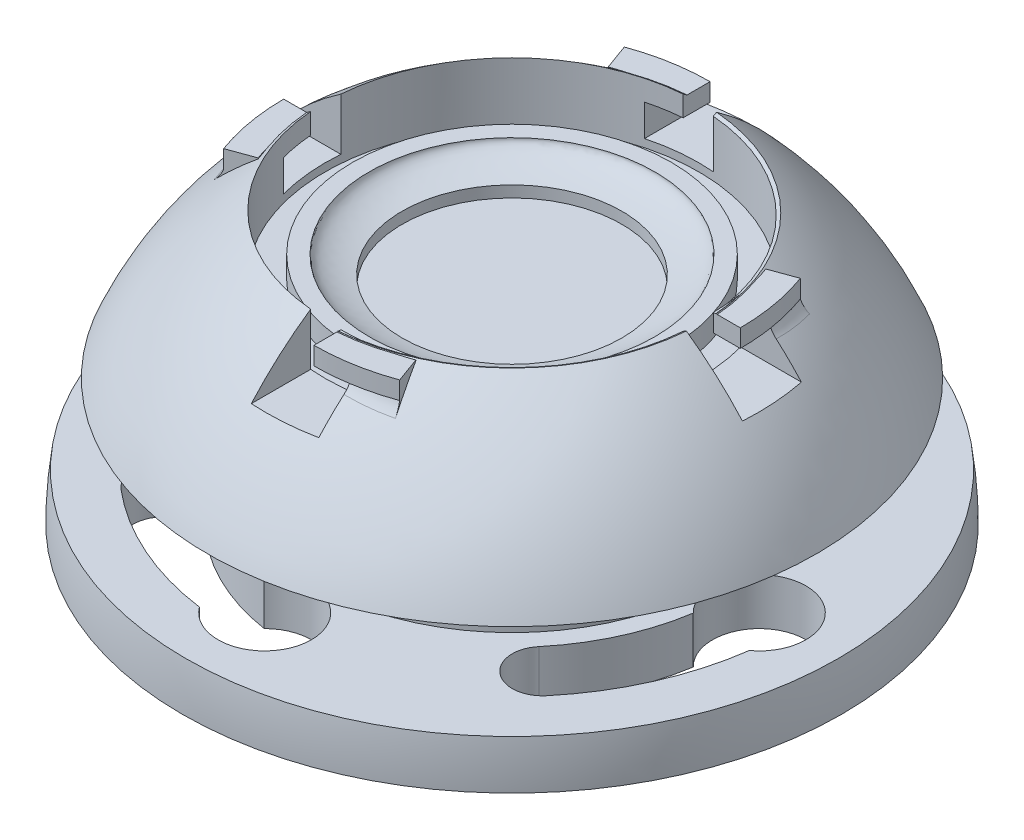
ISO-10303-21;
HEADER;
FILE_DESCRIPTION(('STEP AP214'),'2;1');
FILE_NAME('part.step','',(''),(''),'','','');
FILE_SCHEMA(('AUTOMOTIVE_DESIGN { 1 0 10303 214 1 1 1 1 }'));
ENDSEC;
DATA;
#1=APPLICATION_CONTEXT('core data for automotive mechanical design processes');
#2=APPLICATION_PROTOCOL_DEFINITION('international standard','automotive_design',2000,#1);
#3=PRODUCT_CONTEXT('',#1,'mechanical');
#4=PRODUCT('Part','Part','',(#3));
#5=PRODUCT_RELATED_PRODUCT_CATEGORY('part','',(#4));
#6=PRODUCT_DEFINITION_FORMATION('','',#4);
#7=PRODUCT_DEFINITION_CONTEXT('part definition',#1,'design');
#8=PRODUCT_DEFINITION('design','',#6,#7);
#9=PRODUCT_DEFINITION_SHAPE('','',#8);
#10=(LENGTH_UNIT() NAMED_UNIT(*) SI_UNIT(.MILLI.,.METRE.));
#11=(NAMED_UNIT(*) PLANE_ANGLE_UNIT() SI_UNIT($,.RADIAN.));
#12=(NAMED_UNIT(*) SI_UNIT($,.STERADIAN.) SOLID_ANGLE_UNIT());
#13=UNCERTAINTY_MEASURE_WITH_UNIT(LENGTH_MEASURE(1.E-05),#10,'distance_accuracy_value','');
#14=(GEOMETRIC_REPRESENTATION_CONTEXT(3) GLOBAL_UNCERTAINTY_ASSIGNED_CONTEXT((#13)) GLOBAL_UNIT_ASSIGNED_CONTEXT((#10,
#11,#12)) REPRESENTATION_CONTEXT('',''));
#15=CARTESIAN_POINT('',(0.,0.,0.));
#16=DIRECTION('',(0.,0.,1.));
#17=DIRECTION('',(1.,0.,0.));
#18=AXIS2_PLACEMENT_3D('',#15,#16,#17);
#19=CARTESIAN_POINT('',(0.,0.,0.));
#20=DIRECTION('',(0.,-1.,0.));
#21=DIRECTION('',(1.,0.,0.));
#22=AXIS2_PLACEMENT_3D('',#19,#20,#21);
#23=SPHERICAL_SURFACE('',#22,12.);
#24=CARTESIAN_POINT('',(0.176766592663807,0.,0.485662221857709));
#25=DIRECTION('',(0.342020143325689,0.,0.939692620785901));
#26=DIRECTION('',(0.939692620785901,0.,-0.342020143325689));
#27=AXIS2_PLACEMENT_3D('',#24,#25,#26);
#28=CIRCLE('',#27,11.9888650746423);
#29=CARTESIAN_POINT('',(-7.5355404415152,8.73920334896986,3.29271241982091));
#30=VERTEX_POINT('',#29);
#31=CARTESIAN_POINT('',(-6.36897427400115,9.75756482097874,2.86811705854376));
#32=VERTEX_POINT('',#31);
#33=EDGE_CURVE('E668',#30,#32,#28,.F.);
#34=ORIENTED_EDGE('',*,*,#33,.F.);
#35=CARTESIAN_POINT('',(-7.05481183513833,8.64993138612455,4.40548714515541));
#36=CARTESIAN_POINT('',(-6.86116743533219,8.85251159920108,4.31782824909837));
#37=CARTESIAN_POINT('',(-6.79159651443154,9.13736567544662,4.30236795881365));
#38=CARTESIAN_POINT('',(-7.12838725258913,8.660397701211,4.26712806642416));
#39=CARTESIAN_POINT('',(-6.93612909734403,8.85878157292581,4.18548439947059));
#40=CARTESIAN_POINT('',(-6.8645487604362,9.13736567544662,4.17033713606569));
#41=CARTESIAN_POINT('',(-7.19766962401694,8.67123001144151,4.12650197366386));
#42=CARTESIAN_POINT('',(-7.0072875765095,8.8652955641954,4.05061278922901));
#43=CARTESIAN_POINT('',(-6.93366357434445,9.13736567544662,4.03613810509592));
#44=CARTESIAN_POINT('',(-7.32723359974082,8.69372244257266,3.84128395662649));
#45=CARTESIAN_POINT('',(-7.14134937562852,8.87885041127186,3.77667661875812));
#46=CARTESIAN_POINT('',(-7.06397459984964,9.13736567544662,3.76388574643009));
#47=CARTESIAN_POINT('',(-7.38751810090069,8.70538229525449,3.69669332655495));
#48=CARTESIAN_POINT('',(-7.2042757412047,8.88588895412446,3.63763679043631));
#49=CARTESIAN_POINT('',(-7.12517335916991,9.13736567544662,3.62583367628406));
#50=CARTESIAN_POINT('',(-7.49761703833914,8.72939180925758,3.40692640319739));
#51=CARTESIAN_POINT('',(-7.3203933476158,8.90040495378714,3.35856147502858));
#52=CARTESIAN_POINT('',(-7.2383227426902,9.13736567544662,3.34904356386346));
#53=CARTESIAN_POINT('',(-7.54761539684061,8.74172320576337,3.2618185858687));
#54=CARTESIAN_POINT('',(-7.37377146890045,8.90786831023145,3.21862869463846));
#55=CARTESIAN_POINT('',(-7.29043269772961,9.13736567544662,3.21037341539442));
#56=CARTESIAN_POINT('',(-7.63821900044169,8.76743748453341,2.96872918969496));
#57=CARTESIAN_POINT('',(-7.47196409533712,8.92344101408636,2.93554254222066));
#58=CARTESIAN_POINT('',(-7.38669082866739,9.13736567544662,2.93008678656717));
#59=CARTESIAN_POINT('',(-7.67882070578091,8.78082076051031,2.82074655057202));
#60=CARTESIAN_POINT('',(-7.51679979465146,8.93154821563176,2.79240475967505));
#61=CARTESIAN_POINT('',(-7.43083600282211,9.13736567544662,2.78846921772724));
#62=CARTESIAN_POINT('',(-7.75034899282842,8.80895839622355,2.52157433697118));
#63=CARTESIAN_POINT('',(-7.59776507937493,8.94858375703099,2.5025301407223));
#64=CARTESIAN_POINT('',(-7.51122885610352,9.13736567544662,2.50186401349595));
#65=CARTESIAN_POINT('',(-7.7812134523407,8.82372081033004,2.37037049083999));
#66=CARTESIAN_POINT('',(-7.63386629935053,8.95751428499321,2.35578796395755));
#67=CARTESIAN_POINT('',(-7.54742539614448,9.13736567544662,2.35686083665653));
#68=CARTESIAN_POINT('',(-7.81945230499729,8.84715326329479,2.142437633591));
#69=CARTESIAN_POINT('',(-7.68087223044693,8.97166721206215,2.13397767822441));
#70=CARTESIAN_POINT('',(-7.59539813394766,9.13736567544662,2.13794029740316));
#71=CARTESIAN_POINT('',(-7.83085287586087,8.85517566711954,2.06630065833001));
#72=CARTESIAN_POINT('',(-7.69533258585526,8.97650279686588,2.05987671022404));
#73=CARTESIAN_POINT('',(-7.61033099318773,9.13736567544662,2.06475826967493));
#74=CARTESIAN_POINT('',(-7.85085232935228,8.87174552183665,1.9136977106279));
#75=CARTESIAN_POINT('',(-7.72179640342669,8.98647171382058,1.911203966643));
#76=CARTESIAN_POINT('',(-7.63808626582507,9.13736567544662,1.91794274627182));
#77=CARTESIAN_POINT('',(-7.85945073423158,8.88029306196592,1.83723168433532));
#78=CARTESIAN_POINT('',(-7.73380330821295,8.99160459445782,1.83663325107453));
#79=CARTESIAN_POINT('',(-7.65090831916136,9.13736567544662,1.84430917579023));
#80=CARTESIAN_POINT('',(-7.87381682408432,8.89822291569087,1.68252173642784));
#81=CARTESIAN_POINT('',(-7.75547478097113,9.00234221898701,1.68559499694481));
#82=CARTESIAN_POINT('',(-7.67466399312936,9.13736567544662,1.69516407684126));
#83=CARTESIAN_POINT('',(-7.87952260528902,8.90761878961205,1.60427361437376));
#84=CARTESIAN_POINT('',(-7.76509068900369,9.00795404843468,1.60911838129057));
#85=CARTESIAN_POINT('',(-7.68555331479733,9.13736567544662,1.61964508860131));
#86=CARTESIAN_POINT('',(-7.88755847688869,8.92730140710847,1.44773813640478));
#87=CARTESIAN_POINT('',(-7.78149644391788,9.01966300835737,1.45593816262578));
#88=CARTESIAN_POINT('',(-7.70509438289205,9.13736567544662,1.46835830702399));
#89=CARTESIAN_POINT('',(-7.88988998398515,8.93758777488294,1.36945081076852));
#90=CARTESIAN_POINT('',(-7.788292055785,9.02575912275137,1.37923530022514));
#91=CARTESIAN_POINT('',(-7.71374706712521,9.13736567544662,1.39259063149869));
#92=CARTESIAN_POINT('',(-7.89049236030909,8.95400046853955,1.25202815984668));
#93=CARTESIAN_POINT('',(-7.7961829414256,9.03543218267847,1.26398218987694));
#94=CARTESIAN_POINT('',(-7.72505254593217,9.13736567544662,1.27874705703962));
#95=CARTESIAN_POINT('',(-7.89020809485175,8.95964431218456,1.21283063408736));
#96=CARTESIAN_POINT('',(-7.79843043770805,9.03874780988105,1.22549766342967));
#97=CARTESIAN_POINT('',(-7.72854604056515,9.13736567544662,1.24071072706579));
#98=CARTESIAN_POINT('',(-7.88855882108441,8.97134653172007,1.13452574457));
#99=CARTESIAN_POINT('',(-7.80209265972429,9.04559721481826,1.14855907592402));
#100=CARTESIAN_POINT('',(-7.73496684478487,9.13736567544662,1.16464872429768));
#101=CARTESIAN_POINT('',(-7.88719399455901,8.97740483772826,1.09541836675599));
#102=CARTESIAN_POINT('',(-7.80350820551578,9.04913078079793,1.11010495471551));
#103=CARTESIAN_POINT('',(-7.7378942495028,9.13736567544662,1.12662305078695));
#104=CARTESIAN_POINT('',(-7.8832393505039,8.9900625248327,1.01729285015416));
#105=CARTESIAN_POINT('',(-7.80543472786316,9.05648035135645,1.03322099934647));
#106=CARTESIAN_POINT('',(-7.74318611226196,9.13736567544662,1.05057000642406));
#107=CARTESIAN_POINT('',(-7.8806478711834,8.99666262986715,0.978274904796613));
#108=CARTESIAN_POINT('',(-7.80594521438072,9.06029651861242,0.994791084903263));
#109=CARTESIAN_POINT('',(-7.74554980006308,9.13736567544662,1.01254270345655));
#110=CARTESIAN_POINT('',(-7.87392420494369,9.01066028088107,0.900496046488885));
#111=CARTESIAN_POINT('',(-7.8058972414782,9.06833899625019,0.918113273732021));
#112=CARTESIAN_POINT('',(-7.7497106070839,9.13736567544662,0.93663276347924));
#113=CARTESIAN_POINT('',(-7.86979115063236,9.01805827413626,0.861735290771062));
#114=CARTESIAN_POINT('',(-7.80533904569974,9.07256522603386,0.879865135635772));
#115=CARTESIAN_POINT('',(-7.75150740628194,9.13736567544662,0.898750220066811));
#116=CARTESIAN_POINT('',(-7.864730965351,9.02598346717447,0.823182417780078));
#117=CARTESIAN_POINT('',(-7.80416525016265,9.0770620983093,0.841766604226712));
#118=CARTESIAN_POINT('',(-7.75302018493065,9.13736567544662,0.861008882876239));
#119=(BOUNDED_SURFACE() B_SPLINE_SURFACE(3,2,((#35,#36,#37),(#38,#39,#40),(#41,#42,#43),(#44,
#45,#46),(#47,#48,#49),(#50,#51,#52),(#53,#54,#55),(#56,#57,#58),(#59,#60,#61),(#62,#63,#64),
(#65,#66,#67),(#68,#69,#70),(#71,#72,#73),(#74,#75,#76),(#77,#78,#79),(#80,#81,#82),(#83,#84,
#85),(#86,#87,#88),(#89,#90,#91),(#92,#93,#94),(#95,#96,#97),(#98,#99,#100),(#101,#102,#103),
(#104,#105,#106),(#107,#108,#109),(#110,#111,#112),(#113,#114,#115),(#116,#117,#118)),
.UNSPECIFIED.,.F.,.F.,.F.) B_SPLINE_SURFACE_WITH_KNOTS((4,2,2,2,2,2,2,2,2,2,2,2,2,4),(3,3),(0.,
0.510362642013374,1.02056061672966,1.52064095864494,2.02090937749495,2.52430774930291,
2.77582014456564,3.02737539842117,3.2841081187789,3.54073301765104,3.66942713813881,
3.79809961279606,3.92694690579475,4.05586680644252),(0.,1.),
.UNSPECIFIED.) GEOMETRIC_REPRESENTATION_ITEM() RATIONAL_B_SPLINE_SURFACE(((1.,0.959491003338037,
1.),(1.,0.960946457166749,1.),(1.,0.962422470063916,1.),(1.,0.965409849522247,1.),(1.,
0.96692120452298,1.),(1.,0.969944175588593,1.),(1.,0.971455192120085,1.),(1.,0.974502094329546,
1.),(1.,0.97603798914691,1.),(1.,0.979138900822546,1.),(1.,0.980704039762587,1.),(1.,
0.983061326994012,1.),(1.,0.983848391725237,1.),(1.,0.985425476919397,1.),(1.,0.986215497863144,
1.),(1.,0.987813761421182,1.),(1.,0.988622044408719,1.),(1.,0.990239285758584,1.),(1.,
0.991048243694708,1.),(1.,0.992262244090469,1.),(1.,0.992667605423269,1.),(1.,0.993477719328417,
1.),(1.,0.993882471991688,1.),(1.,0.99469150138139,1.),(1.,0.995095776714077,1.),(1.,
0.995902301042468,1.),(1.,0.99630454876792,1.),(1.,0.996705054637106,1.))) REPRESENTATION_ITEM('') SURFACE());
#120=CARTESIAN_POINT('',(-7.05481183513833,8.64993138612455,4.40548714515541));
#121=CARTESIAN_POINT('',(-7.12838725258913,8.660397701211,4.26712806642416));
#122=CARTESIAN_POINT('',(-7.19766962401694,8.67123001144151,4.12650197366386));
#123=CARTESIAN_POINT('',(-7.32723359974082,8.69372244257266,3.84128395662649));
#124=CARTESIAN_POINT('',(-7.38751810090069,8.70538229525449,3.69669332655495));
#125=CARTESIAN_POINT('',(-7.49761703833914,8.72939180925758,3.40692640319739));
#126=CARTESIAN_POINT('',(-7.54761539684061,8.74172320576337,3.2618185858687));
#127=CARTESIAN_POINT('',(-7.63821900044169,8.76743748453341,2.96872918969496));
#128=CARTESIAN_POINT('',(-7.67882070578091,8.78082076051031,2.82074655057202));
#129=CARTESIAN_POINT('',(-7.75034899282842,8.80895839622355,2.52157433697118));
#130=CARTESIAN_POINT('',(-7.7812134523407,8.82372081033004,2.37037049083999));
#131=CARTESIAN_POINT('',(-7.81945230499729,8.84715326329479,2.142437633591));
#132=CARTESIAN_POINT('',(-7.83085287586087,8.85517566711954,2.06630065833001));
#133=CARTESIAN_POINT('',(-7.85085232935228,8.87174552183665,1.9136977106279));
#134=CARTESIAN_POINT('',(-7.85945073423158,8.88029306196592,1.83723168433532));
#135=CARTESIAN_POINT('',(-7.87381682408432,8.89822291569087,1.68252173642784));
#136=CARTESIAN_POINT('',(-7.87952260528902,8.90761878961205,1.60427361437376));
#137=CARTESIAN_POINT('',(-7.88755847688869,8.92730140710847,1.44773813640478));
#138=CARTESIAN_POINT('',(-7.88988998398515,8.93758777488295,1.36945081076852));
#139=CARTESIAN_POINT('',(-7.89049236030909,8.95400046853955,1.25202815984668));
#140=CARTESIAN_POINT('',(-7.89020809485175,8.95964431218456,1.21283063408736));
#141=CARTESIAN_POINT('',(-7.88855882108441,8.97134653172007,1.13452574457));
#142=CARTESIAN_POINT('',(-7.88719399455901,8.97740483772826,1.09541836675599));
#143=CARTESIAN_POINT('',(-7.8832393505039,8.9900625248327,1.01729285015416));
#144=CARTESIAN_POINT('',(-7.8806478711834,8.99666262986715,0.978274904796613));
#145=CARTESIAN_POINT('',(-7.87392420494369,9.01066028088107,0.900496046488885));
#146=CARTESIAN_POINT('',(-7.86979115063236,9.01805827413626,0.861735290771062));
#147=CARTESIAN_POINT('',(-7.864730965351,9.02598346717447,0.823182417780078));
#148=B_SPLINE_CURVE_WITH_KNOTS('',3,(#120,#121,#122,#123,#124,#125,#126,#127,#128,#129,#130,
#131,#132,#133,#134,#135,#136,#137,#138,#139,#140,#141,#142,#143,#144,#145,#146,#147),
.UNSPECIFIED.,.F.,.F.,(4,2,2,2,2,2,2,2,2,2,2,2,2,4),(0.,0.510362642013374,1.02056061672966,
1.52064095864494,2.02090937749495,2.52430774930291,2.77582014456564,3.02737539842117,
3.2841081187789,3.54073301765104,3.66942713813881,3.79809961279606,3.92694690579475,
4.05586680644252),.UNSPECIFIED.);
#149=CARTESIAN_POINT('',(-7.86754118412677,8.8904046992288,1.74999999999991));
#150=VERTEX_POINT('',#149);
#151=EDGE_CURVE('E1144',#30,#150,#148,.T.);
#152=ORIENTED_EDGE('',*,*,#151,.T.);
#153=CARTESIAN_POINT('',(0.,0.,1.75));
#154=DIRECTION('',(0.,0.,-1.));
#155=DIRECTION('',(-1.,0.,0.));
#156=AXIS2_PLACEMENT_3D('',#153,#154,#155);
#157=CIRCLE('',#156,11.8717100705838);
#158=CARTESIAN_POINT('',(-8.78290894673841,7.98736567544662,1.7499999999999));
#159=VERTEX_POINT('',#158);
#160=EDGE_CURVE('E2062',#150,#159,#157,.F.);
#161=ORIENTED_EDGE('',*,*,#160,.T.);
#162=CARTESIAN_POINT('',(0.,7.98736567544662,0.));
#163=DIRECTION('',(0.,1.,0.));
#164=DIRECTION('',(0.,0.,1.));
#165=AXIS2_PLACEMENT_3D('',#162,#163,#164);
#166=CIRCLE('',#165,8.95555635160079);
#167=CARTESIAN_POINT('',(-8.9386514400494,7.98736567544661,-0.550000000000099));
#168=VERTEX_POINT('',#167);
#169=EDGE_CURVE('E2060',#159,#168,#166,.F.);
#170=ORIENTED_EDGE('',*,*,#169,.T.);
#171=CARTESIAN_POINT('',(0.,0.,-0.550000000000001));
#172=DIRECTION('',(0.,0.,1.));
#173=DIRECTION('',(1.,0.,0.));
#174=AXIS2_PLACEMENT_3D('',#171,#172,#173);
#175=CIRCLE('',#174,11.9873892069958);
#176=CARTESIAN_POINT('',(-6.77772085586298,9.88736567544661,-0.550000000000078));
#177=VERTEX_POINT('',#176);
#178=EDGE_CURVE('E2063',#168,#177,#175,.F.);
#179=ORIENTED_EDGE('',*,*,#178,.T.);
#180=CARTESIAN_POINT('',(0.,9.88736567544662,0.));
#181=DIRECTION('',(0.,-1.,0.));
#182=DIRECTION('',(1.,0.,0.));
#183=AXIS2_PLACEMENT_3D('',#180,#181,#182);
#184=CIRCLE('',#183,6.80000000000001);
#185=CARTESIAN_POINT('',(-0.55,9.88736567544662,-6.77772085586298));
#186=VERTEX_POINT('',#185);
#187=EDGE_CURVE('E1056',#177,#186,#184,.T.);
#188=ORIENTED_EDGE('',*,*,#187,.T.);
#189=CARTESIAN_POINT('',(-0.549999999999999,0.,0.));
#190=DIRECTION('',(1.,0.,0.));
#191=DIRECTION('',(0.,1.,0.));
#192=AXIS2_PLACEMENT_3D('',#189,#190,#191);
#193=CIRCLE('',#192,11.9873892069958);
#194=CARTESIAN_POINT('',(-0.55,9.78736567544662,-6.92134185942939));
#195=VERTEX_POINT('',#194);
#196=EDGE_CURVE('E2066',#186,#195,#193,.F.);
#197=ORIENTED_EDGE('',*,*,#196,.T.);
#198=CARTESIAN_POINT('',(0.,9.78736567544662,0.));
#199=DIRECTION('',(0.,1.,0.));
#200=DIRECTION('',(-1.,0.,0.));
#201=AXIS2_PLACEMENT_3D('',#198,#199,#200);
#202=CIRCLE('',#201,6.94316016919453);
#203=CARTESIAN_POINT('',(-2.33861194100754,9.78736567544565,-6.53745878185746));
#204=VERTEX_POINT('',#203);
#205=EDGE_CURVE('E2014',#204,#195,#202,.F.);
#206=ORIENTED_EDGE('',*,*,#205,.F.);
#207=CARTESIAN_POINT('',(-4.31340995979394,9.67575573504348,-5.63686486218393));
#208=CARTESIAN_POINT('',(-4.20070845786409,9.68216204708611,-5.71210736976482));
#209=CARTESIAN_POINT('',(-4.08578832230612,9.68868808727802,-5.78394627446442));
#210=CARTESIAN_POINT('',(-3.8518511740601,9.70195896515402,-5.92061207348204));
#211=CARTESIAN_POINT('',(-3.73283382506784,9.70870382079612,-5.98543839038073));
#212=CARTESIAN_POINT('',(-3.37083467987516,9.72919666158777,-6.16873942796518));
#213=CARTESIAN_POINT('',(-3.12228688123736,9.74323811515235,-6.2764490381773));
#214=CARTESIAN_POINT('',(-2.69295108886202,9.76743834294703,-6.43273981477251));
#215=CARTESIAN_POINT('',(-2.51499995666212,9.77745376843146,-6.48930369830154));
#216=CARTESIAN_POINT('',(-2.23325822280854,9.79328590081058,-6.56622268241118));
#217=CARTESIAN_POINT('',(-2.13082486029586,9.79903700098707,-6.59163427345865));
#218=CARTESIAN_POINT('',(-1.82545617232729,9.81616660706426,-6.65985636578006));
#219=CARTESIAN_POINT('',(-1.62093881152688,9.82761921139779,-6.69578839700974));
#220=CARTESIAN_POINT('',(-1.20934166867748,9.8506272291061,-6.74876922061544));
#221=CARTESIAN_POINT('',(-1.00225991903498,9.86218271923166,-6.76580247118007));
#222=CARTESIAN_POINT('',(-0.585797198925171,9.88538103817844,-6.78085033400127));
#223=CARTESIAN_POINT('',(-0.376410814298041,9.89702385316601,-6.77871723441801));
#224=CARTESIAN_POINT('',(0.0411308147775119,9.92020057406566,-6.75513673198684));
#225=CARTESIAN_POINT('',(0.249286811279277,9.93173454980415,-6.73370270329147));
#226=CARTESIAN_POINT('',(0.456003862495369,9.94316872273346,-6.70264546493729));
#227=B_SPLINE_CURVE_WITH_KNOTS('',3,(#207,#208,#209,#210,#211,#212,#213,#214,#215,#216,#217,
#218,#219,#220,#221,#222,#223,#224,#225,#226),.UNSPECIFIED.,.F.,.F.,(4,2,2,2,2,2,2,2,2,4),(0.,
0.406846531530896,0.81372653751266,1.62526632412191,2.18563393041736,2.5026294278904,
3.12557074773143,3.74902397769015,4.37728615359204,5.00511332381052),.UNSPECIFIED.);
#228=CARTESIAN_POINT('',(-2.86811705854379,9.75756482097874,-6.36897427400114));
#229=VERTEX_POINT('',#228);
#230=EDGE_CURVE('E2006',#229,#204,#227,.T.);
#231=ORIENTED_EDGE('',*,*,#230,.F.);
#232=CARTESIAN_POINT('',(-0.485662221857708,0.,0.176766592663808));
#233=DIRECTION('',(-0.9396926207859,0.,0.342020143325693));
#234=DIRECTION('',(0.342020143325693,0.,0.9396926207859));
#235=AXIS2_PLACEMENT_3D('',#232,#233,#234);
#236=CIRCLE('',#235,11.9888650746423);
#237=CARTESIAN_POINT('',(-3.29271241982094,8.73920334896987,-7.53554044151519));
#238=VERTEX_POINT('',#237);
#239=EDGE_CURVE('E700',#238,#229,#236,.F.);
#240=ORIENTED_EDGE('',*,*,#239,.F.);
#241=CARTESIAN_POINT('',(-4.40548714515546,8.64993138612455,-7.0548118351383));
#242=CARTESIAN_POINT('',(-4.31782824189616,8.8525115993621,-6.8611674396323));
#243=CARTESIAN_POINT('',(-4.30236794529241,9.13736567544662,-6.79159652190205));
#244=CARTESIAN_POINT('',(-4.26712806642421,8.660397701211,-7.1283872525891));
#245=CARTESIAN_POINT('',(-4.18548439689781,8.85878157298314,-6.93612909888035));
#246=CARTESIAN_POINT('',(-4.17033713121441,9.13736567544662,-6.86454876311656));
#247=CARTESIAN_POINT('',(-4.12650197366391,8.67123001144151,-7.1976696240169));
#248=CARTESIAN_POINT('',(-4.05061278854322,8.86529556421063,-7.00728757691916));
#249=CARTESIAN_POINT('',(-4.03613810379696,9.13736567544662,-6.93366357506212));
#250=CARTESIAN_POINT('',(-3.84128395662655,8.69372244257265,-7.32723359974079));
#251=CARTESIAN_POINT('',(-3.77667661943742,8.87885041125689,-7.14134937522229));
#252=CARTESIAN_POINT('',(-3.76388574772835,9.13736567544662,-7.06397459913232));
#253=CARTESIAN_POINT('',(-3.69669332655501,8.70538229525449,-7.38751810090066));
#254=CARTESIAN_POINT('',(-3.63763679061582,8.88588895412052,-7.20427574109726));
#255=CARTESIAN_POINT('',(-3.62583367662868,9.13736567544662,-7.12517335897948));
#256=CARTESIAN_POINT('',(-3.40692640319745,8.72939180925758,-7.49761703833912));
#257=CARTESIAN_POINT('',(-3.35856147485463,8.90040495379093,-7.32039334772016));
#258=CARTESIAN_POINT('',(-3.34904356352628,9.13736567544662,-7.2383227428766));
#259=CARTESIAN_POINT('',(-3.26181858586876,8.74172320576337,-7.54761539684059));
#260=CARTESIAN_POINT('',(-3.21862869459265,8.90786831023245,-7.37377146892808));
#261=CARTESIAN_POINT('',(-3.21037341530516,9.13736567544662,-7.29043269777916));
#262=CARTESIAN_POINT('',(-2.96872918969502,8.7674374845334,-7.63821900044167));
#263=CARTESIAN_POINT('',(-2.93554254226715,8.92344101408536,-7.47196409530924));
#264=CARTESIAN_POINT('',(-2.93008678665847,9.13736567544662,-7.38669082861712));
#265=CARTESIAN_POINT('',(-2.82074655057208,8.7808207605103,-7.67882070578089));
#266=CARTESIAN_POINT('',(-2.79240475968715,8.9315482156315,-7.51679979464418));
#267=CARTESIAN_POINT('',(-2.78846921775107,9.13736567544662,-7.43083600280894));
#268=CARTESIAN_POINT('',(-2.52157433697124,8.80895839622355,-7.7503489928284));
#269=CARTESIAN_POINT('',(-2.50253014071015,8.94858375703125,-7.59776507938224));
#270=CARTESIAN_POINT('',(-2.50186401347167,9.13736567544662,-7.51122885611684));
#271=CARTESIAN_POINT('',(-2.37037049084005,8.82372081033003,-7.78121345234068));
#272=CARTESIAN_POINT('',(-2.3557879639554,8.95751428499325,-7.63386629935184));
#273=CARTESIAN_POINT('',(-2.35686083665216,9.13736567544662,-7.5474253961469));
#274=CARTESIAN_POINT('',(-2.14243763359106,8.84715326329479,-7.81945230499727));
#275=CARTESIAN_POINT('',(-2.13397767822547,8.97166721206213,-7.68087223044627));
#276=CARTESIAN_POINT('',(-2.13794029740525,9.13736567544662,-7.59539813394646));
#277=CARTESIAN_POINT('',(-2.06630065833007,8.85517566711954,-7.83085287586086));
#278=CARTESIAN_POINT('',(-2.05987671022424,8.97650279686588,-7.6953325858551));
#279=CARTESIAN_POINT('',(-2.06475826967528,9.13736567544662,-7.61033099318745));
#280=CARTESIAN_POINT('',(-1.91369771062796,8.87174552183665,-7.85085232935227));
#281=CARTESIAN_POINT('',(-1.91120396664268,8.98647171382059,-7.72179640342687));
#282=CARTESIAN_POINT('',(-1.91794274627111,9.13736567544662,-7.63808626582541));
#283=CARTESIAN_POINT('',(-1.83723168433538,8.88029306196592,-7.85945073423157));
#284=CARTESIAN_POINT('',(-1.83663325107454,8.99160459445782,-7.73380330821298));
#285=CARTESIAN_POINT('',(-1.8443091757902,9.13736567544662,-7.65090831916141));
#286=CARTESIAN_POINT('',(-1.6825217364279,8.89822291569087,-7.87381682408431));
#287=CARTESIAN_POINT('',(-1.68559499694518,9.002342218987,-7.75547478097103));
#288=CARTESIAN_POINT('',(-1.69516407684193,9.13736567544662,-7.67466399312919));
#289=CARTESIAN_POINT('',(-1.60427361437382,8.90761878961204,-7.87952260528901));
#290=CARTESIAN_POINT('',(-1.60911838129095,9.00795404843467,-7.76509068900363));
#291=CARTESIAN_POINT('',(-1.619645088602,9.13736567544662,-7.68555331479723));
#292=CARTESIAN_POINT('',(-1.44773813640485,8.92730140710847,-7.88755847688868));
#293=CARTESIAN_POINT('',(-1.45593816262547,9.01966300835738,-7.78149644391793));
#294=CARTESIAN_POINT('',(-1.4683583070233,9.13736567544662,-7.70509438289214));
#295=CARTESIAN_POINT('',(-1.36945081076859,8.93758777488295,-7.88988998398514));
#296=CARTESIAN_POINT('',(-1.37923530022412,9.0257591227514,-7.78829205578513));
#297=CARTESIAN_POINT('',(-1.39259063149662,9.13736567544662,-7.71374706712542));
#298=CARTESIAN_POINT('',(-1.25202815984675,8.95400046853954,-7.89049236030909));
#299=CARTESIAN_POINT('',(-1.26398218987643,9.03543218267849,-7.79618294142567));
#300=CARTESIAN_POINT('',(-1.27874705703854,9.13736567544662,-7.72505254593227));
#301=CARTESIAN_POINT('',(-1.21283063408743,8.95964431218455,-7.89020809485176));
#302=CARTESIAN_POINT('',(-1.22549766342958,9.03874780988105,-7.79843043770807));
#303=CARTESIAN_POINT('',(-1.24071072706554,9.13736567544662,-7.72854604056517));
#304=CARTESIAN_POINT('',(-1.13452574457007,8.97134653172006,-7.88855882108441));
#305=CARTESIAN_POINT('',(-1.14855907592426,9.04559721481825,-7.80209265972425));
#306=CARTESIAN_POINT('',(-1.1646487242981,9.13736567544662,-7.73496684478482));
#307=CARTESIAN_POINT('',(-1.09541836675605,8.97740483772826,-7.88719399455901));
#308=CARTESIAN_POINT('',(-1.11010495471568,9.04913078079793,-7.80350820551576));
#309=CARTESIAN_POINT('',(-1.12662305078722,9.13736567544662,-7.73789424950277));
#310=CARTESIAN_POINT('',(-1.01729285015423,8.9900625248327,-7.88323935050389));
#311=CARTESIAN_POINT('',(-1.03322099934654,9.05648035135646,-7.80543472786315));
#312=CARTESIAN_POINT('',(-1.05057000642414,9.13736567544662,-7.74318611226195));
#313=CARTESIAN_POINT('',(-0.978274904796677,8.99666262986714,-7.8806478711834));
#314=CARTESIAN_POINT('',(-0.994791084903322,9.06029651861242,-7.80594521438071));
#315=CARTESIAN_POINT('',(-1.0125427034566,9.13736567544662,-7.74554980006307));
#316=CARTESIAN_POINT('',(-0.900496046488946,9.01066028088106,-7.87392420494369));
#317=CARTESIAN_POINT('',(-0.918113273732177,9.06833899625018,-7.80589724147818));
#318=CARTESIAN_POINT('',(-0.936632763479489,9.13736567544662,-7.74971060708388));
#319=CARTESIAN_POINT('',(-0.861735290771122,9.01805827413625,-7.86979115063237));
#320=CARTESIAN_POINT('',(-0.87986513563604,9.07256522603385,-7.80533904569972));
#321=CARTESIAN_POINT('',(-0.898750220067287,9.13736567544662,-7.7515074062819));
#322=CARTESIAN_POINT('',(-0.82318241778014,9.02598346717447,-7.864730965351));
#323=CARTESIAN_POINT('',(-0.841766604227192,9.07706209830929,-7.80416525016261));
#324=CARTESIAN_POINT('',(-0.861008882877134,9.13736567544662,-7.75302018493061));
#325=(BOUNDED_SURFACE() B_SPLINE_SURFACE(3,2,((#241,#242,#243),(#244,#245,#246),(#247,#248,
#249),(#250,#251,#252),(#253,#254,#255),(#256,#257,#258),(#259,#260,#261),(#262,#263,#264),
(#265,#266,#267),(#268,#269,#270),(#271,#272,#273),(#274,#275,#276),(#277,#278,#279),(#280,#281,
#282),(#283,#284,#285),(#286,#287,#288),(#289,#290,#291),(#292,#293,#294),(#295,#296,#297),
(#298,#299,#300),(#301,#302,#303),(#304,#305,#306),(#307,#308,#309),(#310,#311,#312),(#313,#314,
#315),(#316,#317,#318),(#319,#320,#321),(#322,#323,#324)),.UNSPECIFIED.,.F.,.F.,
.F.) B_SPLINE_SURFACE_WITH_KNOTS((4,2,2,2,2,2,2,2,2,2,2,2,2,4),(3,3),(0.,0.510362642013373,
1.02056061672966,1.52064095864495,2.02090937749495,2.52430774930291,2.77582014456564,
3.02737539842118,3.28410811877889,3.54073301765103,3.6694271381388,3.79809961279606,
3.92694690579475,4.05586680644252),(0.,1.),
.UNSPECIFIED.) GEOMETRIC_REPRESENTATION_ITEM() RATIONAL_B_SPLINE_SURFACE(((1.,0.959491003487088,
1.),(1.,0.960946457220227,1.),(1.,0.962422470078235,1.),(1.,0.965409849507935,1.),(1.,
0.966921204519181,1.),(1.,0.96994417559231,1.),(1.,0.971455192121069,1.),(1.,0.97450209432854,
1.),(1.,0.976037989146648,1.),(1.,0.979138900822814,1.),(1.,0.980704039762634,1.),(1.,
0.983061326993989,1.),(1.,0.983848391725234,1.),(1.,0.985425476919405,1.),(1.,0.986215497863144,
1.),(1.,0.987813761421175,1.),(1.,0.988622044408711,1.),(1.,0.990239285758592,1.),(1.,
0.991048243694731,1.),(1.,0.99226224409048,1.),(1.,0.992667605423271,1.),(1.,0.993477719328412,
1.),(1.,0.993882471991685,1.),(1.,0.99469150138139,1.),(1.,0.995095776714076,1.),(1.,
0.995902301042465,1.),(1.,0.996304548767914,1.),(1.,0.996705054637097,1.))) REPRESENTATION_ITEM('') SURFACE());
#326=CARTESIAN_POINT('',(-4.40548714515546,8.64993138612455,-7.0548118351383));
#327=CARTESIAN_POINT('',(-4.26712806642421,8.660397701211,-7.1283872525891));
#328=CARTESIAN_POINT('',(-4.12650197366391,8.67123001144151,-7.1976696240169));
#329=CARTESIAN_POINT('',(-3.84128395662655,8.69372244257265,-7.32723359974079));
#330=CARTESIAN_POINT('',(-3.69669332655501,8.70538229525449,-7.38751810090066));
#331=CARTESIAN_POINT('',(-3.40692640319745,8.72939180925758,-7.49761703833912));
#332=CARTESIAN_POINT('',(-3.26181858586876,8.74172320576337,-7.54761539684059));
#333=CARTESIAN_POINT('',(-2.96872918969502,8.7674374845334,-7.63821900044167));
#334=CARTESIAN_POINT('',(-2.82074655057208,8.7808207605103,-7.67882070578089));
#335=CARTESIAN_POINT('',(-2.52157433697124,8.80895839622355,-7.7503489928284));
#336=CARTESIAN_POINT('',(-2.37037049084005,8.82372081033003,-7.78121345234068));
#337=CARTESIAN_POINT('',(-2.14243763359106,8.84715326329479,-7.81945230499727));
#338=CARTESIAN_POINT('',(-2.06630065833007,8.85517566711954,-7.83085287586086));
#339=CARTESIAN_POINT('',(-1.91369771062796,8.87174552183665,-7.85085232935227));
#340=CARTESIAN_POINT('',(-1.83723168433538,8.88029306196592,-7.85945073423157));
#341=CARTESIAN_POINT('',(-1.6825217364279,8.89822291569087,-7.87381682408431));
#342=CARTESIAN_POINT('',(-1.60427361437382,8.90761878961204,-7.87952260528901));
#343=CARTESIAN_POINT('',(-1.44773813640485,8.92730140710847,-7.88755847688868));
#344=CARTESIAN_POINT('',(-1.36945081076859,8.93758777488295,-7.88988998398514));
#345=CARTESIAN_POINT('',(-1.25202815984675,8.95400046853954,-7.89049236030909));
#346=CARTESIAN_POINT('',(-1.21283063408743,8.95964431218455,-7.89020809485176));
#347=CARTESIAN_POINT('',(-1.13452574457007,8.97134653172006,-7.88855882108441));
#348=CARTESIAN_POINT('',(-1.09541836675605,8.97740483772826,-7.88719399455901));
#349=CARTESIAN_POINT('',(-1.01729285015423,8.9900625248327,-7.88323935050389));
#350=CARTESIAN_POINT('',(-0.978274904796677,8.99666262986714,-7.8806478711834));
#351=CARTESIAN_POINT('',(-0.900496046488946,9.01066028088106,-7.87392420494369));
#352=CARTESIAN_POINT('',(-0.861735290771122,9.01805827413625,-7.86979115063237));
#353=CARTESIAN_POINT('',(-0.82318241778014,9.02598346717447,-7.864730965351));
#354=B_SPLINE_CURVE_WITH_KNOTS('',3,(#326,#327,#328,#329,#330,#331,#332,#333,#334,#335,#336,
#337,#338,#339,#340,#341,#342,#343,#344,#345,#346,#347,#348,#349,#350,#351,#352,#353),
.UNSPECIFIED.,.F.,.F.,(4,2,2,2,2,2,2,2,2,2,2,2,2,4),(0.,0.510362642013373,1.02056061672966,
1.52064095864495,2.02090937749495,2.52430774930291,2.77582014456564,3.02737539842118,
3.28410811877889,3.54073301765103,3.6694271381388,3.79809961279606,3.92694690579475,
4.05586680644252),.UNSPECIFIED.);
#355=CARTESIAN_POINT('',(-1.75,8.89040469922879,-7.86754118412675));
#356=VERTEX_POINT('',#355);
#357=EDGE_CURVE('E1142',#238,#356,#354,.T.);
#358=ORIENTED_EDGE('',*,*,#357,.T.);
#359=CARTESIAN_POINT('',(-1.75,0.,0.));
#360=DIRECTION('',(1.,0.,0.));
#361=DIRECTION('',(0.,0.,-1.));
#362=AXIS2_PLACEMENT_3D('',#359,#360,#361);
#363=CIRCLE('',#362,11.8717100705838);
#364=CARTESIAN_POINT('',(-1.75,7.98736567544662,-8.78290894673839));
#365=VERTEX_POINT('',#364);
#366=EDGE_CURVE('E2092',#356,#365,#363,.F.);
#367=ORIENTED_EDGE('',*,*,#366,.T.);
#368=CARTESIAN_POINT('',(0.,7.98736567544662,0.));
#369=DIRECTION('',(0.,1.,0.));
#370=DIRECTION('',(0.,0.,1.));
#371=AXIS2_PLACEMENT_3D('',#368,#369,#370);
#372=CIRCLE('',#371,8.95555635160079);
#373=CARTESIAN_POINT('',(0.55,7.98736567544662,-8.9386514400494));
#374=VERTEX_POINT('',#373);
#375=EDGE_CURVE('E2093',#365,#374,#372,.F.);
#376=ORIENTED_EDGE('',*,*,#375,.T.);
#377=CARTESIAN_POINT('',(0.550000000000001,0.,0.));
#378=DIRECTION('',(-1.,0.,0.));
#379=DIRECTION('',(0.,-1.,0.));
#380=AXIS2_PLACEMENT_3D('',#377,#378,#379);
#381=CIRCLE('',#380,11.9873892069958);
#382=CARTESIAN_POINT('',(0.55,9.80534574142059,-6.895846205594));
#383=VERTEX_POINT('',#382);
#384=EDGE_CURVE('E1131',#374,#383,#381,.F.);
#385=ORIENTED_EDGE('',*,*,#384,.T.);
#386=CARTESIAN_POINT('',(0.,9.80534574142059,0.));
#387=DIRECTION('',(0.,-1.,0.));
#388=DIRECTION('',(1.,0.,0.));
#389=AXIS2_PLACEMENT_3D('',#386,#387,#388);
#390=CIRCLE('',#389,6.9177449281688);
#391=CARTESIAN_POINT('',(6.895846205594,9.80534574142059,-0.549999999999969));
#392=VERTEX_POINT('',#391);
#393=EDGE_CURVE('E1126',#383,#392,#390,.T.);
#394=ORIENTED_EDGE('',*,*,#393,.T.);
#395=CARTESIAN_POINT('',(0.,0.,-0.549999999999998));
#396=DIRECTION('',(0.,0.,1.));
#397=DIRECTION('',(1.,0.,0.));
#398=AXIS2_PLACEMENT_3D('',#395,#396,#397);
#399=CIRCLE('',#398,11.9873892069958);
#400=CARTESIAN_POINT('',(6.92134185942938,9.78736567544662,-0.549999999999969));
#401=VERTEX_POINT('',#400);
#402=EDGE_CURVE('E1124',#392,#401,#399,.F.);
#403=ORIENTED_EDGE('',*,*,#402,.T.);
#404=CARTESIAN_POINT('',(0.,9.78736567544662,0.));
#405=DIRECTION('',(0.,1.,0.));
#406=DIRECTION('',(-1.,0.,0.));
#407=AXIS2_PLACEMENT_3D('',#404,#405,#406);
#408=CIRCLE('',#407,6.94316016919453);
#409=CARTESIAN_POINT('',(6.53745878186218,9.78736567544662,-2.33861194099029));
#410=VERTEX_POINT('',#409);
#411=EDGE_CURVE('E460',#410,#401,#408,.F.);
#412=ORIENTED_EDGE('',*,*,#411,.F.);
#413=CARTESIAN_POINT('',(5.63686486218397,9.67575573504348,-4.31340995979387));
#414=CARTESIAN_POINT('',(5.71210736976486,9.68216204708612,-4.20070845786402));
#415=CARTESIAN_POINT('',(5.78394627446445,9.68868808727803,-4.08578832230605));
#416=CARTESIAN_POINT('',(5.92061207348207,9.70195896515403,-3.85185117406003));
#417=CARTESIAN_POINT('',(5.98543839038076,9.70870382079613,-3.73283382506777));
#418=CARTESIAN_POINT('',(6.1687394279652,9.72919666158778,-3.37083467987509));
#419=CARTESIAN_POINT('',(6.27644903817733,9.74323811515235,-3.12228688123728));
#420=CARTESIAN_POINT('',(6.43273981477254,9.76743834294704,-2.69295108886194));
#421=CARTESIAN_POINT('',(6.48930369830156,9.77745376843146,-2.51499995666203));
#422=CARTESIAN_POINT('',(6.5662226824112,9.79328590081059,-2.23325822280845));
#423=CARTESIAN_POINT('',(6.59163427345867,9.79903700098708,-2.13082486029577));
#424=CARTESIAN_POINT('',(6.65985636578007,9.81616660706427,-1.82545617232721));
#425=CARTESIAN_POINT('',(6.69578839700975,9.8276192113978,-1.6209388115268));
#426=CARTESIAN_POINT('',(6.74876922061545,9.85062722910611,-1.2093416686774));
#427=CARTESIAN_POINT('',(6.76580247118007,9.86218271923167,-1.0022599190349));
#428=CARTESIAN_POINT('',(6.78085033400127,9.88538103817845,-0.585797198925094));
#429=CARTESIAN_POINT('',(6.778717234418,9.89702385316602,-0.376410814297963));
#430=CARTESIAN_POINT('',(6.75513673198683,9.92020057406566,0.0411308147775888));
#431=CARTESIAN_POINT('',(6.73370270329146,9.93173454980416,0.249286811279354));
#432=CARTESIAN_POINT('',(6.70264546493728,9.94316872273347,0.456003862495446));
#433=B_SPLINE_CURVE_WITH_KNOTS('',3,(#413,#414,#415,#416,#417,#418,#419,#420,#421,#422,#423,
#424,#425,#426,#427,#428,#429,#430,#431,#432),.UNSPECIFIED.,.F.,.F.,(4,2,2,2,2,2,2,2,2,4),(0.,
0.406846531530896,0.813726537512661,1.62526632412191,2.18563393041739,2.5026294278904,
3.12557074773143,3.74902397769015,4.37728615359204,5.00511332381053),.UNSPECIFIED.);
#434=CARTESIAN_POINT('',(6.36897427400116,9.75756482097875,-2.86811705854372));
#435=VERTEX_POINT('',#434);
#436=EDGE_CURVE('E463',#435,#410,#433,.T.);
#437=ORIENTED_EDGE('',*,*,#436,.F.);
#438=CARTESIAN_POINT('',(-0.176766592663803,0.,-0.48566222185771));
#439=DIRECTION('',(-0.342020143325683,0.,-0.939692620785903));
#440=DIRECTION('',(-0.939692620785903,0.,0.342020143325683));
#441=AXIS2_PLACEMENT_3D('',#438,#439,#440);
#442=CIRCLE('',#441,11.9888650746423);
#443=CARTESIAN_POINT('',(7.53554044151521,8.73920334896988,-3.29271241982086));
#444=VERTEX_POINT('',#443);
#445=EDGE_CURVE('E501',#444,#435,#442,.F.);
#446=ORIENTED_EDGE('',*,*,#445,.F.);
#447=CARTESIAN_POINT('',(7.05481183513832,8.64993138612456,-4.40548714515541));
#448=CARTESIAN_POINT('',(6.86116743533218,8.85251159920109,-4.31782824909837));
#449=CARTESIAN_POINT('',(6.79159651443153,9.13736567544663,-4.30236795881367));
#450=CARTESIAN_POINT('',(7.12838725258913,8.66039770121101,-4.26712806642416));
#451=CARTESIAN_POINT('',(6.93612909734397,8.85878157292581,-4.18548439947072));
#452=CARTESIAN_POINT('',(6.8645487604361,9.13736567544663,-4.17033713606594));
#453=CARTESIAN_POINT('',(7.19766962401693,8.67123001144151,-4.12650197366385));
#454=CARTESIAN_POINT('',(7.00728757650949,8.8652955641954,-4.05061278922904));
#455=CARTESIAN_POINT('',(6.93366357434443,9.13736567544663,-4.03613810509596));
#456=CARTESIAN_POINT('',(7.32723359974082,8.69372244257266,-3.84128395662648));
#457=CARTESIAN_POINT('',(7.14134937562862,8.87885041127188,-3.77667661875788));
#458=CARTESIAN_POINT('',(7.06397459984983,9.13736567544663,-3.76388574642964));
#459=CARTESIAN_POINT('',(7.38751810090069,8.7053822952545,-3.69669332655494));
#460=CARTESIAN_POINT('',(7.20427574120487,8.88588895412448,-3.63763679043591));
#461=CARTESIAN_POINT('',(7.12517335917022,9.13736567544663,-3.62583367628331));
#462=CARTESIAN_POINT('',(7.49761703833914,8.72939180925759,-3.40692640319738));
#463=CARTESIAN_POINT('',(7.32039334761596,8.90040495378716,-3.35856147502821));
#464=CARTESIAN_POINT('',(7.23832274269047,9.13736567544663,-3.34904356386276));
#465=CARTESIAN_POINT('',(7.54761539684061,8.74172320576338,-3.2618185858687));
#466=CARTESIAN_POINT('',(7.37377146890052,8.90786831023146,-3.21862869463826));
#467=CARTESIAN_POINT('',(7.29043269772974,9.13736567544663,-3.21037341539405));
#468=CARTESIAN_POINT('',(7.63821900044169,8.76743748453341,-2.96872918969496));
#469=CARTESIAN_POINT('',(7.47196409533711,8.92344101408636,-2.93554254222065));
#470=CARTESIAN_POINT('',(7.38669082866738,9.13736567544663,-2.93008678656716));
#471=CARTESIAN_POINT('',(7.67882070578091,8.78082076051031,-2.82074655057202));
#472=CARTESIAN_POINT('',(7.51679979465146,8.93154821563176,-2.79240475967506));
#473=CARTESIAN_POINT('',(7.43083600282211,9.13736567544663,-2.78846921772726));
#474=CARTESIAN_POINT('',(7.75034899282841,8.80895839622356,-2.52157433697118));
#475=CARTESIAN_POINT('',(7.59776507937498,8.94858375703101,-2.50253014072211));
#476=CARTESIAN_POINT('',(7.5112288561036,9.13736567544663,-2.50186401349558));
#477=CARTESIAN_POINT('',(7.78121345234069,8.82372081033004,-2.37037049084));
#478=CARTESIAN_POINT('',(7.63386629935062,8.95751428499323,-2.35578796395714));
#479=CARTESIAN_POINT('',(7.54742539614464,9.13736567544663,-2.35686083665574));
#480=CARTESIAN_POINT('',(7.81945230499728,8.84715326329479,-2.14243763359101));
#481=CARTESIAN_POINT('',(7.68087223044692,8.97166721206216,-2.13397767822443));
#482=CARTESIAN_POINT('',(7.59539813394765,9.13736567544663,-2.13794029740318));
#483=CARTESIAN_POINT('',(7.83085287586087,8.85517566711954,-2.06630065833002));
#484=CARTESIAN_POINT('',(7.69533258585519,8.97650279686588,-2.05987671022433));
#485=CARTESIAN_POINT('',(7.61033099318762,9.13736567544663,-2.06475826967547));
#486=CARTESIAN_POINT('',(7.85085232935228,8.87174552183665,-1.91369771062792));
#487=CARTESIAN_POINT('',(7.72179640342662,8.98647171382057,-1.9112039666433));
#488=CARTESIAN_POINT('',(7.63808626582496,9.13736567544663,-1.91794274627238));
#489=CARTESIAN_POINT('',(7.85945073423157,8.88029306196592,-1.83723168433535));
#490=CARTESIAN_POINT('',(7.73380330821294,8.99160459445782,-1.83663325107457));
#491=CARTESIAN_POINT('',(7.65090831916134,9.13736567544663,-1.8443091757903));
#492=CARTESIAN_POINT('',(7.87381682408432,8.89822291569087,-1.68252173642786));
#493=CARTESIAN_POINT('',(7.75547478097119,9.00234221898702,-1.68559499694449));
#494=CARTESIAN_POINT('',(7.67466399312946,9.13736567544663,-1.69516407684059));
#495=CARTESIAN_POINT('',(7.87952260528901,8.90761878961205,-1.60427361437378));
#496=CARTESIAN_POINT('',(7.76509068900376,9.0079540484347,-1.60911838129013));
#497=CARTESIAN_POINT('',(7.68555331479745,9.13736567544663,-1.61964508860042));
#498=CARTESIAN_POINT('',(7.88755847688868,8.92730140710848,-1.4477381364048));
#499=CARTESIAN_POINT('',(7.78149644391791,9.01966300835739,-1.45593816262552));
#500=CARTESIAN_POINT('',(7.70509438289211,9.13736567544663,-1.46835830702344));
#501=CARTESIAN_POINT('',(7.88988998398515,8.93758777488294,-1.36945081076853));
#502=CARTESIAN_POINT('',(7.78829205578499,9.02575912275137,-1.37923530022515));
#503=CARTESIAN_POINT('',(7.71374706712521,9.13736567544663,-1.39259063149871));
#504=CARTESIAN_POINT('',(7.89049236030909,8.95400046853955,-1.25202815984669));
#505=CARTESIAN_POINT('',(7.7961829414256,9.03543218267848,-1.26398218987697));
#506=CARTESIAN_POINT('',(7.72505254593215,9.13736567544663,-1.27874705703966));
#507=CARTESIAN_POINT('',(7.89020809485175,8.95964431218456,-1.21283063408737));
#508=CARTESIAN_POINT('',(7.79843043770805,9.03874780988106,-1.22549766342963));
#509=CARTESIAN_POINT('',(7.72854604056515,9.13736567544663,-1.24071072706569));
#510=CARTESIAN_POINT('',(7.8885588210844,8.97134653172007,-1.13452574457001));
#511=CARTESIAN_POINT('',(7.80209265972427,9.04559721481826,-1.14855907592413));
#512=CARTESIAN_POINT('',(7.73496684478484,9.13736567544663,-1.1646487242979));
#513=CARTESIAN_POINT('',(7.88719399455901,8.97740483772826,-1.09541836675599));
#514=CARTESIAN_POINT('',(7.80350820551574,9.04913078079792,-1.11010495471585));
#515=CARTESIAN_POINT('',(7.73789424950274,9.13736567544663,-1.12662305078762));
#516=CARTESIAN_POINT('',(7.8832393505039,8.9900625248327,-1.01729285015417));
#517=CARTESIAN_POINT('',(7.80543472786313,9.05648035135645,-1.03322099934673));
#518=CARTESIAN_POINT('',(7.74318611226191,9.13736567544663,-1.05057000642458));
#519=CARTESIAN_POINT('',(7.8806478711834,8.99666262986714,-0.978274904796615));
#520=CARTESIAN_POINT('',(7.80594521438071,9.06029651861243,-0.994791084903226));
#521=CARTESIAN_POINT('',(7.74554980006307,9.13736567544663,-1.01254270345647));
#522=CARTESIAN_POINT('',(7.87392420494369,9.01066028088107,-0.900496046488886));
#523=CARTESIAN_POINT('',(7.80589724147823,9.0683389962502,-0.918113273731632));
#524=CARTESIAN_POINT('',(7.74971060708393,9.13736567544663,-0.936632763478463));
#525=CARTESIAN_POINT('',(7.86979115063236,9.01805827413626,-0.861735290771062));
#526=CARTESIAN_POINT('',(7.80533904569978,9.07256522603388,-0.879865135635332));
#527=CARTESIAN_POINT('',(7.75150740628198,9.13736567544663,-0.898750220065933));
#528=CARTESIAN_POINT('',(7.864730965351,9.02598346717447,-0.823182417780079));
#529=CARTESIAN_POINT('',(7.80416525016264,9.0770620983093,-0.841766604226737));
#530=CARTESIAN_POINT('',(7.75302018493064,9.13736567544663,-0.861008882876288));
#531=(BOUNDED_SURFACE() B_SPLINE_SURFACE(3,2,((#447,#448,#449),(#450,#451,#452),(#453,#454,
#455),(#456,#457,#458),(#459,#460,#461),(#462,#463,#464),(#465,#466,#467),(#468,#469,#470),
(#471,#472,#473),(#474,#475,#476),(#477,#478,#479),(#480,#481,#482),(#483,#484,#485),(#486,#487,
#488),(#489,#490,#491),(#492,#493,#494),(#495,#496,#497),(#498,#499,#500),(#501,#502,#503),
(#504,#505,#506),(#507,#508,#509),(#510,#511,#512),(#513,#514,#515),(#516,#517,#518),(#519,#520,
#521),(#522,#523,#524),(#525,#526,#527),(#528,#529,#530)),.UNSPECIFIED.,.F.,.F.,
.F.) B_SPLINE_SURFACE_WITH_KNOTS((4,2,2,2,2,2,2,2,2,2,2,2,2,4),(3,3),(0.,0.510362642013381,
1.02056061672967,1.52064095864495,2.02090937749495,2.5243077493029,2.77582014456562,
3.02737539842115,3.28410811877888,3.54073301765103,3.6694271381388,3.79809961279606,
3.92694690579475,4.05586680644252),(0.,1.),
.UNSPECIFIED.) GEOMETRIC_REPRESENTATION_ITEM() RATIONAL_B_SPLINE_SURFACE(((1.,0.959491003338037,
1.),(1.,0.960946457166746,1.),(1.,0.962422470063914,1.),(1.,0.965409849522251,1.),(1.,
0.966921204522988,1.),(1.,0.9699441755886,1.),(1.,0.971455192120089,1.),(1.,0.974502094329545,
1.),(1.,0.976037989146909,1.),(1.,0.97913890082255,1.),(1.,0.980704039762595,1.),(1.,
0.983061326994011,1.),(1.,0.98384839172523,1.),(1.,0.98542547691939,1.),(1.,0.986215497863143,
1.),(1.,0.987813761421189,1.),(1.,0.988622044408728,1.),(1.,0.99023928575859,1.),(1.,
0.991048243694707,1.),(1.,0.992262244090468,1.),(1.,0.99266760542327,1.),(1.,0.993477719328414,
1.),(1.,0.99388247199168,1.),(1.,0.994691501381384,1.),(1.,0.995095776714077,1.),(1.,
0.995902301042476,1.),(1.,0.996304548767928,1.),(1.,0.996705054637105,1.))) REPRESENTATION_ITEM('') SURFACE());
#532=CARTESIAN_POINT('',(7.05481183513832,8.64993138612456,-4.40548714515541));
#533=CARTESIAN_POINT('',(7.12838725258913,8.66039770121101,-4.26712806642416));
#534=CARTESIAN_POINT('',(7.19766962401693,8.67123001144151,-4.12650197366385));
#535=CARTESIAN_POINT('',(7.32723359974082,8.69372244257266,-3.84128395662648));
#536=CARTESIAN_POINT('',(7.38751810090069,8.7053822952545,-3.69669332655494));
#537=CARTESIAN_POINT('',(7.49761703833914,8.72939180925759,-3.40692640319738));
#538=CARTESIAN_POINT('',(7.54761539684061,8.74172320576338,-3.2618185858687));
#539=CARTESIAN_POINT('',(7.63821900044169,8.76743748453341,-2.96872918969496));
#540=CARTESIAN_POINT('',(7.67882070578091,8.78082076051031,-2.82074655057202));
#541=CARTESIAN_POINT('',(7.75034899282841,8.80895839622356,-2.52157433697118));
#542=CARTESIAN_POINT('',(7.78121345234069,8.82372081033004,-2.37037049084));
#543=CARTESIAN_POINT('',(7.81945230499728,8.84715326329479,-2.14243763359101));
#544=CARTESIAN_POINT('',(7.83085287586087,8.85517566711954,-2.06630065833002));
#545=CARTESIAN_POINT('',(7.85085232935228,8.87174552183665,-1.91369771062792));
#546=CARTESIAN_POINT('',(7.85945073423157,8.88029306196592,-1.83723168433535));
#547=CARTESIAN_POINT('',(7.87381682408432,8.89822291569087,-1.68252173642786));
#548=CARTESIAN_POINT('',(7.87952260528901,8.90761878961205,-1.60427361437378));
#549=CARTESIAN_POINT('',(7.88755847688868,8.92730140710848,-1.4477381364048));
#550=CARTESIAN_POINT('',(7.88988998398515,8.93758777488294,-1.36945081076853));
#551=CARTESIAN_POINT('',(7.89049236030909,8.95400046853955,-1.25202815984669));
#552=CARTESIAN_POINT('',(7.89020809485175,8.95964431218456,-1.21283063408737));
#553=CARTESIAN_POINT('',(7.8885588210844,8.97134653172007,-1.13452574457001));
#554=CARTESIAN_POINT('',(7.88719399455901,8.97740483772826,-1.09541836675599));
#555=CARTESIAN_POINT('',(7.8832393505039,8.9900625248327,-1.01729285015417));
#556=CARTESIAN_POINT('',(7.8806478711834,8.99666262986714,-0.978274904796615));
#557=CARTESIAN_POINT('',(7.87392420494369,9.01066028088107,-0.900496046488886));
#558=CARTESIAN_POINT('',(7.86979115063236,9.01805827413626,-0.861735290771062));
#559=CARTESIAN_POINT('',(7.864730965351,9.02598346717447,-0.823182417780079));
#560=B_SPLINE_CURVE_WITH_KNOTS('',3,(#532,#533,#534,#535,#536,#537,#538,#539,#540,#541,#542,
#543,#544,#545,#546,#547,#548,#549,#550,#551,#552,#553,#554,#555,#556,#557,#558,#559),
.UNSPECIFIED.,.F.,.F.,(4,2,2,2,2,2,2,2,2,2,2,2,2,4),(0.,0.510362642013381,1.02056061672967,
1.52064095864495,2.02090937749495,2.5243077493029,2.77582014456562,3.02737539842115,
3.28410811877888,3.54073301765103,3.6694271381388,3.79809961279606,3.92694690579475,
4.05586680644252),.UNSPECIFIED.);
#561=CARTESIAN_POINT('',(7.86754118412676,8.8904046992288,-1.74999999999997));
#562=VERTEX_POINT('',#561);
#563=EDGE_CURVE('E1141',#444,#562,#560,.T.);
#564=ORIENTED_EDGE('',*,*,#563,.T.);
#565=CARTESIAN_POINT('',(0.,0.,-1.75));
#566=DIRECTION('',(0.,0.,1.));
#567=DIRECTION('',(1.,0.,0.));
#568=AXIS2_PLACEMENT_3D('',#565,#566,#567);
#569=CIRCLE('',#568,11.8717100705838);
#570=CARTESIAN_POINT('',(8.78290894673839,7.98736567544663,-1.74999999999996));
#571=VERTEX_POINT('',#570);
#572=EDGE_CURVE('E1117',#562,#571,#569,.F.);
#573=ORIENTED_EDGE('',*,*,#572,.T.);
#574=CARTESIAN_POINT('',(0.,7.98736567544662,0.));
#575=DIRECTION('',(0.,1.,0.));
#576=DIRECTION('',(-1.,0.,0.));
#577=AXIS2_PLACEMENT_3D('',#574,#575,#576);
#578=CIRCLE('',#577,8.95555635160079);
#579=CARTESIAN_POINT('',(8.93865144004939,7.98736567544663,0.550000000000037));
#580=VERTEX_POINT('',#579);
#581=EDGE_CURVE('E1114',#571,#580,#578,.F.);
#582=ORIENTED_EDGE('',*,*,#581,.T.);
#583=CARTESIAN_POINT('',(0.,0.,0.550000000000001));
#584=DIRECTION('',(0.,0.,-1.));
#585=DIRECTION('',(-1.,0.,0.));
#586=AXIS2_PLACEMENT_3D('',#583,#584,#585);
#587=CIRCLE('',#586,11.9873892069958);
#588=CARTESIAN_POINT('',(6.895846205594,9.80534574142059,0.550000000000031));
#589=VERTEX_POINT('',#588);
#590=EDGE_CURVE('E1109',#580,#589,#587,.F.);
#591=ORIENTED_EDGE('',*,*,#590,.T.);
#592=CARTESIAN_POINT('',(0.,9.80534574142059,0.));
#593=DIRECTION('',(0.,-1.,0.));
#594=DIRECTION('',(1.,0.,0.));
#595=AXIS2_PLACEMENT_3D('',#592,#593,#594);
#596=CIRCLE('',#595,6.91774492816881);
#597=CARTESIAN_POINT('',(0.549999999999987,9.80534574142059,6.89584620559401));
#598=VERTEX_POINT('',#597);
#599=EDGE_CURVE('E723',#589,#598,#596,.T.);
#600=ORIENTED_EDGE('',*,*,#599,.T.);
#601=CARTESIAN_POINT('',(0.549999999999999,0.,0.));
#602=DIRECTION('',(-1.,0.,0.));
#603=DIRECTION('',(0.,-1.,0.));
#604=AXIS2_PLACEMENT_3D('',#601,#602,#603);
#605=CIRCLE('',#604,11.9873892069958);
#606=CARTESIAN_POINT('',(0.549999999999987,9.78736567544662,6.92134185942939));
#607=VERTEX_POINT('',#606);
#608=EDGE_CURVE('E1115',#598,#607,#605,.F.);
#609=ORIENTED_EDGE('',*,*,#608,.T.);
#610=CARTESIAN_POINT('',(0.,9.78736567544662,0.));
#611=DIRECTION('',(0.,1.,0.));
#612=DIRECTION('',(-1.,0.,0.));
#613=AXIS2_PLACEMENT_3D('',#610,#611,#612);
#614=CIRCLE('',#613,6.94316016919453);
#615=CARTESIAN_POINT('',(2.33861194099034,9.78736567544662,6.53745878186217));
#616=VERTEX_POINT('',#615);
#617=EDGE_CURVE('E843',#616,#607,#614,.F.);
#618=ORIENTED_EDGE('',*,*,#617,.F.);
#619=CARTESIAN_POINT('',(3.82853028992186,9.70327865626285,5.93200970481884));
#620=CARTESIAN_POINT('',(3.6744219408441,9.71201390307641,6.01719823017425));
#621=CARTESIAN_POINT('',(3.51699813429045,9.72092509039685,6.09634860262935));
#622=CARTESIAN_POINT('',(3.19660141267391,9.73903588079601,6.24210754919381));
#623=CARTESIAN_POINT('',(3.03363260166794,9.74823527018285,6.3087251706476));
#624=CARTESIAN_POINT('',(2.69299103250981,9.76743608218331,6.43272168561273));
#625=CARTESIAN_POINT('',(2.51502546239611,9.7774523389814,6.48929686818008));
#626=CARTESIAN_POINT('',(2.19139665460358,9.79563825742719,6.57765130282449));
#627=CARTESIAN_POINT('',(2.04646168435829,9.80377269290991,6.61213042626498));
#628=CARTESIAN_POINT('',(1.75456651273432,9.82013461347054,6.6714852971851));
#629=CARTESIAN_POINT('',(1.60760527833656,9.82836214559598,6.69635594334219));
#630=CARTESIAN_POINT('',(1.25344336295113,9.84816457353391,6.74433701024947));
#631=CARTESIAN_POINT('',(1.04559573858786,9.85976567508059,6.76278861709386));
#632=CARTESIAN_POINT('',(0.628954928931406,9.88297953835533,6.78047138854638));
#633=CARTESIAN_POINT('',(0.420161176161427,9.8945923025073,6.77968887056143));
#634=CARTESIAN_POINT('',(0.00238037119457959,9.91778788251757,6.7588136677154));
#635=CARTESIAN_POINT('',(-0.206601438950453,9.92937018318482,6.73861489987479));
#636=CARTESIAN_POINT('',(-0.621685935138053,9.95233578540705,6.67897458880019));
#637=CARTESIAN_POINT('',(-0.827790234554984,9.96371919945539,6.63954431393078));
#638=CARTESIAN_POINT('',(-1.03162102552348,9.9749578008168,6.59059746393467));
#639=B_SPLINE_CURVE_WITH_KNOTS('',3,(#619,#620,#621,#622,#623,#624,#625,#626,#627,#628,#629,
#630,#631,#632,#633,#634,#635,#636,#637,#638),.UNSPECIFIED.,.F.,.F.,(4,2,2,2,2,2,2,2,2,4),(0.,
0.52875582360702,1.05712846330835,1.61749606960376,2.06478796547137,2.51231701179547,
3.13834908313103,3.76482650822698,4.39474633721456,5.0242975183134),.UNSPECIFIED.);
#640=CARTESIAN_POINT('',(2.86811705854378,9.75756482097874,6.36897427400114));
#641=VERTEX_POINT('',#640);
#642=EDGE_CURVE('E834',#641,#616,#639,.T.);
#643=ORIENTED_EDGE('',*,*,#642,.F.);
#644=CARTESIAN_POINT('',(0.485662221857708,0.,-0.176766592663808));
#645=DIRECTION('',(0.9396926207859,0.,-0.342020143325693));
#646=DIRECTION('',(-0.342020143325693,0.,-0.9396926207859));
#647=AXIS2_PLACEMENT_3D('',#644,#645,#646);
#648=CIRCLE('',#647,11.9888650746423);
#649=CARTESIAN_POINT('',(3.29271241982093,8.73920334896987,7.53554044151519));
#650=VERTEX_POINT('',#649);
#651=EDGE_CURVE('E1262',#650,#641,#648,.F.);
#652=ORIENTED_EDGE('',*,*,#651,.F.);
#653=CARTESIAN_POINT('',(4.40548714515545,8.64993138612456,7.0548118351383));
#654=CARTESIAN_POINT('',(4.31782823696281,8.85251159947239,6.86116744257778));
#655=CARTESIAN_POINT('',(4.3023679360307,9.13736567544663,6.79159652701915));
#656=CARTESIAN_POINT('',(4.2671280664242,8.66039770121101,7.1283872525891));
#657=CARTESIAN_POINT('',(4.18548439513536,8.85878157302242,6.93612909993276));
#658=CARTESIAN_POINT('',(4.17033712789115,9.13736567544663,6.86454876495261));
#659=CARTESIAN_POINT('',(4.1265019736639,8.67123001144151,7.19766962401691));
#660=CARTESIAN_POINT('',(4.05061278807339,8.86529556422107,7.00728757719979));
#661=CARTESIAN_POINT('',(4.03613810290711,9.13736567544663,6.93366357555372));
#662=CARTESIAN_POINT('',(3.84128395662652,8.69372244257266,7.32723359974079));
#663=CARTESIAN_POINT('',(3.77667661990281,8.87885041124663,7.14134937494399));
#664=CARTESIAN_POINT('',(3.76388574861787,9.13736567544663,7.06397459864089));
#665=CARTESIAN_POINT('',(3.69669332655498,8.70538229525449,7.38751810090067));
#666=CARTESIAN_POINT('',(3.63763679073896,8.88588895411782,7.2042757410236));
#667=CARTESIAN_POINT('',(3.62583367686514,9.13736567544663,7.1251733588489));
#668=CARTESIAN_POINT('',(3.40692640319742,8.72939180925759,7.49761703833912));
#669=CARTESIAN_POINT('',(3.35856147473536,8.90040495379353,7.32039334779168));
#670=CARTESIAN_POINT('',(3.34904356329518,9.13736567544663,7.23832274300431));
#671=CARTESIAN_POINT('',(3.26181858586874,8.74172320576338,7.54761539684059));
#672=CARTESIAN_POINT('',(3.21862869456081,8.90786831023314,7.37377146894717));
#673=CARTESIAN_POINT('',(3.2103734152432,9.13736567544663,7.29043269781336));
#674=CARTESIAN_POINT('',(2.968729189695,8.76743748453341,7.63821900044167));
#675=CARTESIAN_POINT('',(2.93554254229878,8.92344101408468,7.47196409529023));
#676=CARTESIAN_POINT('',(2.93008678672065,9.13736567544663,7.38669082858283));
#677=CARTESIAN_POINT('',(2.82074655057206,8.78082076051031,7.67882070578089));
#678=CARTESIAN_POINT('',(2.79240475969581,8.93154821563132,7.51679979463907));
#679=CARTESIAN_POINT('',(2.78846921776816,9.13736567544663,7.43083600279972));
#680=CARTESIAN_POINT('',(2.52157433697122,8.80895839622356,7.7503489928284));
#681=CARTESIAN_POINT('',(2.5025301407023,8.94858375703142,7.59776507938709));
#682=CARTESIAN_POINT('',(2.50186401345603,9.13736567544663,7.51122885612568));
#683=CARTESIAN_POINT('',(2.37037049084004,8.82372081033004,7.78121345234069));
#684=CARTESIAN_POINT('',(2.35578796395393,8.95751428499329,7.63386629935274));
#685=CARTESIAN_POINT('',(2.35686083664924,9.13736567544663,7.54742539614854));
#686=CARTESIAN_POINT('',(2.14243763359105,8.84715326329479,7.81945230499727));
#687=CARTESIAN_POINT('',(2.13397767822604,8.97166721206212,7.68087223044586));
#688=CARTESIAN_POINT('',(2.13794029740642,9.13736567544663,7.5953981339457));
#689=CARTESIAN_POINT('',(2.06630065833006,8.85517566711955,7.83085287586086));
#690=CARTESIAN_POINT('',(2.05987671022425,8.97650279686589,7.69533258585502));
#691=CARTESIAN_POINT('',(2.06475826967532,9.13736567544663,7.61033099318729));
#692=CARTESIAN_POINT('',(1.91369771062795,8.87174552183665,7.85085232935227));
#693=CARTESIAN_POINT('',(1.91120396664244,8.9864717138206,7.721796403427));
#694=CARTESIAN_POINT('',(1.91794274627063,9.13736567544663,7.63808626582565));
#695=CARTESIAN_POINT('',(1.83723168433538,8.88029306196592,7.85945073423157));
#696=CARTESIAN_POINT('',(1.83663325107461,8.99160459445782,7.73380330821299));
#697=CARTESIAN_POINT('',(1.84430917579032,9.13736567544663,7.65090831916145));
#698=CARTESIAN_POINT('',(1.68252173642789,8.89822291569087,7.87381682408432));
#699=CARTESIAN_POINT('',(1.68559499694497,9.00234221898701,7.75547478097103));
#700=CARTESIAN_POINT('',(1.69516407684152,9.13736567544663,7.67466399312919));
#701=CARTESIAN_POINT('',(1.60427361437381,8.90761878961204,7.87952260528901));
#702=CARTESIAN_POINT('',(1.60911838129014,9.00795404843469,7.76509068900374));
#703=CARTESIAN_POINT('',(1.61964508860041,9.13736567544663,7.6855533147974));
#704=CARTESIAN_POINT('',(1.44773813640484,8.92730140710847,7.88755847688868));
#705=CARTESIAN_POINT('',(1.45593816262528,9.01966300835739,7.78149644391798));
#706=CARTESIAN_POINT('',(1.46835830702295,9.13736567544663,7.70509438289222));
#707=CARTESIAN_POINT('',(1.36945081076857,8.93758777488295,7.88988998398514));
#708=CARTESIAN_POINT('',(1.37923530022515,9.02575912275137,7.78829205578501));
#709=CARTESIAN_POINT('',(1.39259063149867,9.13736567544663,7.71374706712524));
#710=CARTESIAN_POINT('',(1.25202815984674,8.95400046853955,7.89049236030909));
#711=CARTESIAN_POINT('',(1.26398218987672,9.03543218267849,7.79618294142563));
#712=CARTESIAN_POINT('',(1.27874705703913,9.13736567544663,7.7250525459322));
#713=CARTESIAN_POINT('',(1.21283063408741,8.95964431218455,7.89020809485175));
#714=CARTESIAN_POINT('',(1.2254976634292,9.03874780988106,7.7984304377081));
#715=CARTESIAN_POINT('',(1.2407107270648,9.13736567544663,7.72854604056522));
#716=CARTESIAN_POINT('',(1.13452574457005,8.97134653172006,7.8885588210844));
#717=CARTESIAN_POINT('',(1.14855907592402,9.04559721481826,7.80209265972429));
#718=CARTESIAN_POINT('',(1.16464872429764,9.13736567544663,7.73496684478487));
#719=CARTESIAN_POINT('',(1.09541836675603,8.97740483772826,7.88719399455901));
#720=CARTESIAN_POINT('',(1.11010495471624,9.04913078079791,7.80350820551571));
#721=CARTESIAN_POINT('',(1.12662305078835,9.13736567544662,7.73789424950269));
#722=CARTESIAN_POINT('',(1.01729285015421,8.9900625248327,7.88323935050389));
#723=CARTESIAN_POINT('',(1.03322099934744,9.05648035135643,7.80543472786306));
#724=CARTESIAN_POINT('',(1.05057000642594,9.13736567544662,7.74318611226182));
#725=CARTESIAN_POINT('',(0.97827490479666,8.99666262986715,7.8806478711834));
#726=CARTESIAN_POINT('',(0.994791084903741,9.06029651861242,7.80594521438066));
#727=CARTESIAN_POINT('',(1.01254270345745,9.13736567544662,7.74554980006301));
#728=CARTESIAN_POINT('',(0.900496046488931,9.01066028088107,7.87392420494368));
#729=CARTESIAN_POINT('',(0.918113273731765,9.0683389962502,7.80589724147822));
#730=CARTESIAN_POINT('',(0.936632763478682,9.13736567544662,7.74971060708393));
#731=CARTESIAN_POINT('',(0.861735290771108,9.01805827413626,7.86979115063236));
#732=CARTESIAN_POINT('',(0.879865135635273,9.07256522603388,7.80533904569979));
#733=CARTESIAN_POINT('',(0.898750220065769,9.13736567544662,7.75150740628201));
#734=CARTESIAN_POINT('',(0.823182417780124,9.02598346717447,7.864730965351));
#735=CARTESIAN_POINT('',(0.841766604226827,9.0770620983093,7.80416525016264));
#736=CARTESIAN_POINT('',(0.861008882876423,9.13736567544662,7.75302018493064));
#737=(BOUNDED_SURFACE() B_SPLINE_SURFACE(3,2,((#653,#654,#655),(#656,#657,#658),(#659,#660,
#661),(#662,#663,#664),(#665,#666,#667),(#668,#669,#670),(#671,#672,#673),(#674,#675,#676),
(#677,#678,#679),(#680,#681,#682),(#683,#684,#685),(#686,#687,#688),(#689,#690,#691),(#692,#693,
#694),(#695,#696,#697),(#698,#699,#700),(#701,#702,#703),(#704,#705,#706),(#707,#708,#709),
(#710,#711,#712),(#713,#714,#715),(#716,#717,#718),(#719,#720,#721),(#722,#723,#724),(#725,#726,
#727),(#728,#729,#730),(#731,#732,#733),(#734,#735,#736)),.UNSPECIFIED.,.F.,.F.,
.F.) B_SPLINE_SURFACE_WITH_KNOTS((4,2,2,2,2,2,2,2,2,2,2,2,2,4),(3,3),(0.,0.510362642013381,
1.02056061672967,1.52064095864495,2.02090937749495,2.52430774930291,2.77582014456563,
3.02737539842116,3.28410811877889,3.54073301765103,3.6694271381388,3.79809961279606,
3.92694690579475,4.05586680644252),(0.,1.),
.UNSPECIFIED.) GEOMETRIC_REPRESENTATION_ITEM() RATIONAL_B_SPLINE_SURFACE(((1.,0.959491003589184,
1.),(1.,0.960946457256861,1.),(1.,0.962422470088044,1.),(1.,0.96540984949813,1.),(1.,
0.966921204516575,1.),(1.,0.969944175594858,1.),(1.,0.971455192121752,1.),(1.,0.974502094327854,
1.),(1.,0.97603798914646,1.),(1.,0.979138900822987,1.),(1.,0.980704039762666,1.),(1.,
0.983061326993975,1.),(1.,0.983848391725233,1.),(1.,0.98542547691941,1.),(1.,0.986215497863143,
1.),(1.,0.987813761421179,1.),(1.,0.988622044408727,1.),(1.,0.990239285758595,1.),(1.,
0.991048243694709,1.),(1.,0.992262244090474,1.),(1.,0.99266760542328,1.),(1.,0.993477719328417,
1.),(1.,0.993882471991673,1.),(1.,0.994691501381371,1.),(1.,0.995095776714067,1.),(1.,
0.995902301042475,1.),(1.,0.996304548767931,1.),(1.,0.996705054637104,1.))) REPRESENTATION_ITEM('') SURFACE());
#738=CARTESIAN_POINT('',(4.40548714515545,8.64993138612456,7.0548118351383));
#739=CARTESIAN_POINT('',(4.2671280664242,8.66039770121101,7.1283872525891));
#740=CARTESIAN_POINT('',(4.12650197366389,8.67123001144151,7.19766962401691));
#741=CARTESIAN_POINT('',(3.84128395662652,8.69372244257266,7.3272335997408));
#742=CARTESIAN_POINT('',(3.69669332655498,8.70538229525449,7.38751810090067));
#743=CARTESIAN_POINT('',(3.40692640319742,8.72939180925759,7.49761703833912));
#744=CARTESIAN_POINT('',(3.26181858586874,8.74172320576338,7.54761539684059));
#745=CARTESIAN_POINT('',(2.968729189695,8.76743748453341,7.63821900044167));
#746=CARTESIAN_POINT('',(2.82074655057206,8.78082076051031,7.67882070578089));
#747=CARTESIAN_POINT('',(2.52157433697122,8.80895839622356,7.7503489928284));
#748=CARTESIAN_POINT('',(2.37037049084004,8.82372081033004,7.78121345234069));
#749=CARTESIAN_POINT('',(2.14243763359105,8.84715326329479,7.81945230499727));
#750=CARTESIAN_POINT('',(2.06630065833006,8.85517566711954,7.83085287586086));
#751=CARTESIAN_POINT('',(1.91369771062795,8.87174552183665,7.85085232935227));
#752=CARTESIAN_POINT('',(1.83723168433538,8.88029306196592,7.85945073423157));
#753=CARTESIAN_POINT('',(1.68252173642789,8.89822291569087,7.87381682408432));
#754=CARTESIAN_POINT('',(1.60427361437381,8.90761878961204,7.87952260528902));
#755=CARTESIAN_POINT('',(1.44773813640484,8.92730140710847,7.88755847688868));
#756=CARTESIAN_POINT('',(1.36945081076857,8.93758777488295,7.88988998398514));
#757=CARTESIAN_POINT('',(1.25202815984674,8.95400046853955,7.89049236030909));
#758=CARTESIAN_POINT('',(1.21283063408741,8.95964431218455,7.89020809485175));
#759=CARTESIAN_POINT('',(1.13452574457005,8.97134653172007,7.8885588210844));
#760=CARTESIAN_POINT('',(1.09541836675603,8.97740483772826,7.88719399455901));
#761=CARTESIAN_POINT('',(1.01729285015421,8.9900625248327,7.88323935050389));
#762=CARTESIAN_POINT('',(0.97827490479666,8.99666262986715,7.8806478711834));
#763=CARTESIAN_POINT('',(0.900496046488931,9.01066028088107,7.87392420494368));
#764=CARTESIAN_POINT('',(0.861735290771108,9.01805827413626,7.86979115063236));
#765=CARTESIAN_POINT('',(0.823182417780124,9.02598346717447,7.864730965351));
#766=B_SPLINE_CURVE_WITH_KNOTS('',3,(#738,#739,#740,#741,#742,#743,#744,#745,#746,#747,#748,
#749,#750,#751,#752,#753,#754,#755,#756,#757,#758,#759,#760,#761,#762,#763,#764,#765),
.UNSPECIFIED.,.F.,.F.,(4,2,2,2,2,2,2,2,2,2,2,2,2,4),(0.,0.510362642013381,1.02056061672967,
1.52064095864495,2.02090937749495,2.52430774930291,2.77582014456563,3.02737539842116,
3.28410811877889,3.54073301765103,3.6694271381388,3.79809961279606,3.92694690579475,
4.05586680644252),.UNSPECIFIED.);
#767=CARTESIAN_POINT('',(1.74999999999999,8.8904046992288,7.86754118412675));
#768=VERTEX_POINT('',#767);
#769=EDGE_CURVE('E1264',#650,#768,#766,.T.);
#770=ORIENTED_EDGE('',*,*,#769,.T.);
#771=CARTESIAN_POINT('',(1.75,0.,0.));
#772=DIRECTION('',(-1.,0.,0.));
#773=DIRECTION('',(0.,-1.,0.));
#774=AXIS2_PLACEMENT_3D('',#771,#772,#773);
#775=CIRCLE('',#774,11.8717100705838);
#776=CARTESIAN_POINT('',(1.74999999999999,7.98736567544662,8.78290894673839));
#777=VERTEX_POINT('',#776);
#778=EDGE_CURVE('E1119',#768,#777,#775,.F.);
#779=ORIENTED_EDGE('',*,*,#778,.T.);
#780=CARTESIAN_POINT('',(0.,7.98736567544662,0.));
#781=DIRECTION('',(0.,1.,0.));
#782=DIRECTION('',(-1.,0.,0.));
#783=AXIS2_PLACEMENT_3D('',#780,#781,#782);
#784=CIRCLE('',#783,8.95555635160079);
#785=CARTESIAN_POINT('',(-0.550000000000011,7.98736567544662,8.9386514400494));
#786=VERTEX_POINT('',#785);
#787=EDGE_CURVE('E2074',#777,#786,#784,.F.);
#788=ORIENTED_EDGE('',*,*,#787,.T.);
#789=CARTESIAN_POINT('',(-0.550000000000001,0.,0.));
#790=DIRECTION('',(1.,0.,0.));
#791=DIRECTION('',(0.,1.,0.));
#792=AXIS2_PLACEMENT_3D('',#789,#790,#791);
#793=CIRCLE('',#792,11.9873892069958);
#794=CARTESIAN_POINT('',(-0.550000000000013,9.88736567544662,6.77772085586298));
#795=VERTEX_POINT('',#794);
#796=EDGE_CURVE('E2071',#786,#795,#793,.F.);
#797=ORIENTED_EDGE('',*,*,#796,.T.);
#798=CARTESIAN_POINT('',(-6.77772085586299,9.88736567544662,0.549999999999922));
#799=VERTEX_POINT('',#798);
#800=EDGE_CURVE('E2080',#795,#799,#184,.T.);
#801=ORIENTED_EDGE('',*,*,#800,.T.);
#802=CARTESIAN_POINT('',(0.,0.,0.549999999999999));
#803=DIRECTION('',(0.,0.,-1.));
#804=DIRECTION('',(-1.,0.,0.));
#805=AXIS2_PLACEMENT_3D('',#802,#803,#804);
#806=CIRCLE('',#805,11.9873892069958);
#807=CARTESIAN_POINT('',(-6.9213418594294,9.78736567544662,0.549999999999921));
#808=VERTEX_POINT('',#807);
#809=EDGE_CURVE('E2051',#799,#808,#806,.F.);
#810=ORIENTED_EDGE('',*,*,#809,.T.);
#811=CARTESIAN_POINT('',(0.,9.78736567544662,0.));
#812=DIRECTION('',(0.,1.,0.));
#813=DIRECTION('',(-1.,0.,0.));
#814=AXIS2_PLACEMENT_3D('',#811,#812,#813);
#815=CIRCLE('',#814,6.94316016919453);
#816=CARTESIAN_POINT('',(-6.53745878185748,9.78736567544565,2.33861194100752));
#817=VERTEX_POINT('',#816);
#818=EDGE_CURVE('E1214',#817,#808,#815,.F.);
#819=ORIENTED_EDGE('',*,*,#818,.F.);
#820=CARTESIAN_POINT('',(-5.93200970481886,9.70327865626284,3.82853028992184));
#821=CARTESIAN_POINT('',(-6.01719823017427,9.7120139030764,3.67442194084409));
#822=CARTESIAN_POINT('',(-6.09634860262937,9.72092509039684,3.51699813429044));
#823=CARTESIAN_POINT('',(-6.24210754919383,9.739035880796,3.1966014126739));
#824=CARTESIAN_POINT('',(-6.30872517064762,9.74823527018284,3.03363260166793));
#825=CARTESIAN_POINT('',(-6.43272168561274,9.7674360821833,2.6929910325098));
#826=CARTESIAN_POINT('',(-6.48929686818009,9.7774523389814,2.5150254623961));
#827=CARTESIAN_POINT('',(-6.5776513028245,9.79563825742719,2.19139665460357));
#828=CARTESIAN_POINT('',(-6.61213042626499,9.8037726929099,2.04646168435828));
#829=CARTESIAN_POINT('',(-6.67148529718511,9.82013461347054,1.7545665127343));
#830=CARTESIAN_POINT('',(-6.6963559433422,9.82836214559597,1.60760527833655));
#831=CARTESIAN_POINT('',(-6.74433701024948,9.84816457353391,1.25344336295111));
#832=CARTESIAN_POINT('',(-6.76278861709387,9.85976567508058,1.04559573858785));
#833=CARTESIAN_POINT('',(-6.78047138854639,9.88297953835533,0.628954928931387));
#834=CARTESIAN_POINT('',(-6.77968887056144,9.8945923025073,0.420161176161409));
#835=CARTESIAN_POINT('',(-6.75881366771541,9.91778788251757,0.00238037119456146));
#836=CARTESIAN_POINT('',(-6.73861489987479,9.92937018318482,-0.20660143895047));
#837=CARTESIAN_POINT('',(-6.6789745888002,9.95233578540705,-0.62168593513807));
#838=CARTESIAN_POINT('',(-6.63954431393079,9.96371919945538,-0.827790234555));
#839=CARTESIAN_POINT('',(-6.59059746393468,9.97495780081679,-1.0316210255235));
#840=B_SPLINE_CURVE_WITH_KNOTS('',3,(#820,#821,#822,#823,#824,#825,#826,#827,#828,#829,#830,
#831,#832,#833,#834,#835,#836,#837,#838,#839),.UNSPECIFIED.,.F.,.F.,(4,2,2,2,2,2,2,2,2,4),(0.,
0.52875582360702,1.05712846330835,1.61749606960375,2.06478796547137,2.51231701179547,
3.13834908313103,3.76482650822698,4.39474633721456,5.0242975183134),.UNSPECIFIED.);
#841=EDGE_CURVE('E1206',#32,#817,#840,.T.);
#842=ORIENTED_EDGE('',*,*,#841,.F.);
#843=EDGE_LOOP('',(#34,#152,#161,#170,#179,#188,#197,#206,#231,#240,#358,#367,#376,#385,#394,
#403,#412,#437,#446,#564,#573,#582,#591,#600,#609,#618,#643,#652,#770,#779,#788,#797,#801,#810,
#819,#842));
#844=FACE_BOUND('',#843,.T.);
#845=CARTESIAN_POINT('',(0.,4.6,0.));
#846=DIRECTION('',(0.,-1.,0.));
#847=DIRECTION('',(0.,0.,-1.));
#848=AXIS2_PLACEMENT_3D('',#845,#846,#847);
#849=CIRCLE('',#848,11.0833208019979);
#850=CARTESIAN_POINT('',(0.,4.6,-11.0833208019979));
#851=VERTEX_POINT('',#850);
#852=EDGE_CURVE('E956',#851,#851,#849,.F.);
#853=ORIENTED_EDGE('',*,*,#852,.T.);
#854=EDGE_LOOP('',(#853));
#855=FACE_BOUND('',#854,.T.);
#856=ADVANCED_FACE('F39',(#844,#855),#23,.T.);
#857=CARTESIAN_POINT('',(0.,6.1,0.));
#858=DIRECTION('',(0.,-1.,0.));
#859=DIRECTION('',(1.,0.,0.));
#860=AXIS2_PLACEMENT_3D('',#857,#858,#859);
#861=CYLINDRICAL_SURFACE('',#860,6.8);
#862=CARTESIAN_POINT('',(0.,7.7,0.));
#863=DIRECTION('',(0.,-1.,0.));
#864=DIRECTION('',(1.,0.,0.));
#865=AXIS2_PLACEMENT_3D('',#862,#863,#864);
#866=CIRCLE('',#865,6.8);
#867=CARTESIAN_POINT('',(6.8,7.7,0.));
#868=VERTEX_POINT('',#867);
#869=EDGE_CURVE('E1095',#868,#868,#866,.T.);
#870=ORIENTED_EDGE('',*,*,#869,.T.);
#871=EDGE_LOOP('',(#870));
#872=FACE_BOUND('',#871,.T.);
#873=DIRECTION('',(0.,-1.,0.));
#874=VECTOR('',#873,1.);
#875=CARTESIAN_POINT('',(0.549999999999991,6.1,6.77772085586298));
#876=LINE('',#875,#874);
#877=CARTESIAN_POINT('',(0.549999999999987,9.13736567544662,6.77772085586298));
#878=VERTEX_POINT('',#877);
#879=CARTESIAN_POINT('',(0.549999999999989,9.73736567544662,6.77772085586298));
#880=VERTEX_POINT('',#879);
#881=EDGE_CURVE('E1015',#878,#880,#876,.F.);
#882=ORIENTED_EDGE('',*,*,#881,.T.);
#883=CARTESIAN_POINT('',(0.,9.73736567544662,0.));
#884=DIRECTION('',(0.,1.,0.));
#885=DIRECTION('',(-1.,0.,0.));
#886=AXIS2_PLACEMENT_3D('',#883,#884,#885);
#887=CIRCLE('',#886,6.8);
#888=CARTESIAN_POINT('',(6.77772085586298,9.73736567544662,0.550000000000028));
#889=VERTEX_POINT('',#888);
#890=EDGE_CURVE('E717',#880,#889,#887,.T.);
#891=ORIENTED_EDGE('',*,*,#890,.T.);
#892=DIRECTION('',(0.,-1.,0.));
#893=VECTOR('',#892,1.);
#894=CARTESIAN_POINT('',(6.77772085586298,6.1,0.550000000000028));
#895=LINE('',#894,#893);
#896=CARTESIAN_POINT('',(6.77772085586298,7.98736567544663,0.550000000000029));
#897=VERTEX_POINT('',#896);
#898=EDGE_CURVE('E1018',#889,#897,#895,.T.);
#899=ORIENTED_EDGE('',*,*,#898,.T.);
#900=CARTESIAN_POINT('',(0.,7.98736567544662,0.));
#901=DIRECTION('',(0.,1.,0.));
#902=DIRECTION('',(-1.,0.,0.));
#903=AXIS2_PLACEMENT_3D('',#900,#901,#902);
#904=CIRCLE('',#903,6.8);
#905=CARTESIAN_POINT('',(6.57095883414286,7.98736567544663,-1.74999999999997));
#906=VERTEX_POINT('',#905);
#907=EDGE_CURVE('E1020',#897,#906,#904,.T.);
#908=ORIENTED_EDGE('',*,*,#907,.T.);
#909=DIRECTION('',(0.,-1.,0.));
#910=VECTOR('',#909,1.);
#911=CARTESIAN_POINT('',(6.57095883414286,6.1,-1.74999999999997));
#912=LINE('',#911,#910);
#913=CARTESIAN_POINT('',(6.57095883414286,9.13736567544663,-1.74999999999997));
#914=VERTEX_POINT('',#913);
#915=EDGE_CURVE('E1023',#906,#914,#912,.F.);
#916=ORIENTED_EDGE('',*,*,#915,.T.);
#917=CARTESIAN_POINT('',(0.,9.13736567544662,0.));
#918=DIRECTION('',(0.,-1.,0.));
#919=DIRECTION('',(1.,0.,0.));
#920=AXIS2_PLACEMENT_3D('',#917,#918,#919);
#921=CIRCLE('',#920,6.8);
#922=CARTESIAN_POINT('',(6.77772085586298,9.13736567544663,-0.54999999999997));
#923=VERTEX_POINT('',#922);
#924=EDGE_CURVE('E1026',#914,#923,#921,.T.);
#925=ORIENTED_EDGE('',*,*,#924,.T.);
#926=DIRECTION('',(0.,-1.,0.));
#927=VECTOR('',#926,1.);
#928=CARTESIAN_POINT('',(6.77772085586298,6.1,-0.549999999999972));
#929=LINE('',#928,#927);
#930=CARTESIAN_POINT('',(6.77772085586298,9.73736567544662,-0.549999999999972));
#931=VERTEX_POINT('',#930);
#932=EDGE_CURVE('E434',#923,#931,#929,.F.);
#933=ORIENTED_EDGE('',*,*,#932,.T.);
#934=CARTESIAN_POINT('',(0.,9.73736567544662,0.));
#935=DIRECTION('',(0.,1.,0.));
#936=DIRECTION('',(-1.,0.,0.));
#937=AXIS2_PLACEMENT_3D('',#934,#935,#936);
#938=CIRCLE('',#937,6.8);
#939=CARTESIAN_POINT('',(0.549999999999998,9.73736567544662,-6.77772085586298));
#940=VERTEX_POINT('',#939);
#941=EDGE_CURVE('E713',#931,#940,#938,.T.);
#942=ORIENTED_EDGE('',*,*,#941,.T.);
#943=DIRECTION('',(0.,-1.,0.));
#944=VECTOR('',#943,1.);
#945=CARTESIAN_POINT('',(0.55,6.1,-6.77772085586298));
#946=LINE('',#945,#944);
#947=CARTESIAN_POINT('',(0.55,7.98736567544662,-6.77772085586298));
#948=VERTEX_POINT('',#947);
#949=EDGE_CURVE('E1039',#940,#948,#946,.T.);
#950=ORIENTED_EDGE('',*,*,#949,.T.);
#951=CARTESIAN_POINT('',(0.,7.98736567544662,0.));
#952=DIRECTION('',(0.,1.,0.));
#953=DIRECTION('',(0.,0.,1.));
#954=AXIS2_PLACEMENT_3D('',#951,#952,#953);
#955=CIRCLE('',#954,6.8);
#956=CARTESIAN_POINT('',(-1.75,7.98736567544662,-6.57095883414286));
#957=VERTEX_POINT('',#956);
#958=EDGE_CURVE('E1041',#948,#957,#955,.T.);
#959=ORIENTED_EDGE('',*,*,#958,.T.);
#960=DIRECTION('',(0.,-1.,0.));
#961=VECTOR('',#960,1.);
#962=CARTESIAN_POINT('',(-1.75,6.1,-6.57095883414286));
#963=LINE('',#962,#961);
#964=CARTESIAN_POINT('',(-1.75,9.13736567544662,-6.57095883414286));
#965=VERTEX_POINT('',#964);
#966=EDGE_CURVE('E1044',#957,#965,#963,.F.);
#967=ORIENTED_EDGE('',*,*,#966,.T.);
#968=CARTESIAN_POINT('',(0.,9.13736567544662,0.));
#969=DIRECTION('',(0.,-1.,0.));
#970=DIRECTION('',(0.,0.,-1.));
#971=AXIS2_PLACEMENT_3D('',#968,#969,#970);
#972=CIRCLE('',#971,6.8);
#973=CARTESIAN_POINT('',(-0.55,9.13736567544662,-6.77772085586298));
#974=VERTEX_POINT('',#973);
#975=EDGE_CURVE('E1047',#965,#974,#972,.T.);
#976=ORIENTED_EDGE('',*,*,#975,.T.);
#977=DIRECTION('',(0.,-1.,0.));
#978=VECTOR('',#977,1.);
#979=CARTESIAN_POINT('',(-0.549999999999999,6.1,-6.77772085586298));
#980=LINE('',#979,#978);
#981=EDGE_CURVE('E1050',#974,#186,#980,.F.);
#982=ORIENTED_EDGE('',*,*,#981,.T.);
#983=ORIENTED_EDGE('',*,*,#187,.F.);
#984=DIRECTION('',(0.,-1.,0.));
#985=VECTOR('',#984,1.);
#986=CARTESIAN_POINT('',(-6.77772085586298,6.1,-0.550000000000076));
#987=LINE('',#986,#985);
#988=CARTESIAN_POINT('',(-6.77772085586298,7.98736567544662,-0.550000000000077));
#989=VERTEX_POINT('',#988);
#990=EDGE_CURVE('E435',#177,#989,#987,.T.);
#991=ORIENTED_EDGE('',*,*,#990,.T.);
#992=CARTESIAN_POINT('',(0.,7.98736567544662,0.));
#993=DIRECTION('',(0.,1.,0.));
#994=DIRECTION('',(0.,0.,1.));
#995=AXIS2_PLACEMENT_3D('',#992,#993,#994);
#996=CIRCLE('',#995,6.8);
#997=CARTESIAN_POINT('',(-6.57095883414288,7.98736567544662,1.74999999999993));
#998=VERTEX_POINT('',#997);
#999=EDGE_CURVE('E992',#989,#998,#996,.T.);
#1000=ORIENTED_EDGE('',*,*,#999,.T.);
#1001=DIRECTION('',(0.,-1.,0.));
#1002=VECTOR('',#1001,1.);
#1003=CARTESIAN_POINT('',(-6.57095883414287,6.1,1.74999999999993));
#1004=LINE('',#1003,#1002);
#1005=CARTESIAN_POINT('',(-6.57095883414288,9.13736567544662,1.74999999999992));
#1006=VERTEX_POINT('',#1005);
#1007=EDGE_CURVE('E995',#998,#1006,#1004,.F.);
#1008=ORIENTED_EDGE('',*,*,#1007,.T.);
#1009=CARTESIAN_POINT('',(0.,9.13736567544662,0.));
#1010=DIRECTION('',(0.,-1.,0.));
#1011=DIRECTION('',(0.,0.,-1.));
#1012=AXIS2_PLACEMENT_3D('',#1009,#1010,#1011);
#1013=CIRCLE('',#1012,6.8);
#1014=CARTESIAN_POINT('',(-6.77772085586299,9.13736567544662,0.549999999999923));
#1015=VERTEX_POINT('',#1014);
#1016=EDGE_CURVE('E998',#1006,#1015,#1013,.T.);
#1017=ORIENTED_EDGE('',*,*,#1016,.T.);
#1018=DIRECTION('',(0.,-1.,0.));
#1019=VECTOR('',#1018,1.);
#1020=CARTESIAN_POINT('',(-6.77772085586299,6.1,0.549999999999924));
#1021=LINE('',#1020,#1019);
#1022=EDGE_CURVE('E1001',#1015,#799,#1021,.F.);
#1023=ORIENTED_EDGE('',*,*,#1022,.T.);
#1024=ORIENTED_EDGE('',*,*,#800,.F.);
#1025=DIRECTION('',(0.,-1.,0.));
#1026=VECTOR('',#1025,1.);
#1027=CARTESIAN_POINT('',(-0.550000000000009,6.1,6.77772085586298));
#1028=LINE('',#1027,#1026);
#1029=CARTESIAN_POINT('',(-0.550000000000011,7.98736567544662,6.77772085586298));
#1030=VERTEX_POINT('',#1029);
#1031=EDGE_CURVE('E1003',#795,#1030,#1028,.T.);
#1032=ORIENTED_EDGE('',*,*,#1031,.T.);
#1033=CARTESIAN_POINT('',(0.,7.98736567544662,0.));
#1034=DIRECTION('',(0.,1.,0.));
#1035=DIRECTION('',(-1.,0.,0.));
#1036=AXIS2_PLACEMENT_3D('',#1033,#1034,#1035);
#1037=CIRCLE('',#1036,6.8);
#1038=CARTESIAN_POINT('',(1.74999999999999,7.98736567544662,6.57095883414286));
#1039=VERTEX_POINT('',#1038);
#1040=EDGE_CURVE('E1006',#1030,#1039,#1037,.T.);
#1041=ORIENTED_EDGE('',*,*,#1040,.T.);
#1042=DIRECTION('',(0.,-1.,0.));
#1043=VECTOR('',#1042,1.);
#1044=CARTESIAN_POINT('',(1.74999999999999,6.1,6.57095883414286));
#1045=LINE('',#1044,#1043);
#1046=CARTESIAN_POINT('',(1.74999999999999,9.13736567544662,6.57095883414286));
#1047=VERTEX_POINT('',#1046);
#1048=EDGE_CURVE('E1009',#1039,#1047,#1045,.F.);
#1049=ORIENTED_EDGE('',*,*,#1048,.T.);
#1050=CARTESIAN_POINT('',(0.,9.13736567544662,0.));
#1051=DIRECTION('',(0.,-1.,0.));
#1052=DIRECTION('',(1.,0.,0.));
#1053=AXIS2_PLACEMENT_3D('',#1050,#1051,#1052);
#1054=CIRCLE('',#1053,6.8);
#1055=EDGE_CURVE('E1012',#1047,#878,#1054,.T.);
#1056=ORIENTED_EDGE('',*,*,#1055,.T.);
#1057=EDGE_LOOP('',(#882,#891,#899,#908,#916,#925,#933,#942,#950,#959,#967,#976,#982,#983,#991,
#1000,#1008,#1017,#1023,#1024,#1032,#1041,#1049,#1056));
#1058=FACE_BOUND('',#1057,.T.);
#1059=ADVANCED_FACE('F1085',(#872,#1058),#861,.F.);
#1060=CARTESIAN_POINT('',(5.8,7.7,0.));
#1061=DIRECTION('',(0.,1.,0.));
#1062=DIRECTION('',(-1.,0.,0.));
#1063=AXIS2_PLACEMENT_3D('',#1060,#1061,#1062);
#1064=PLANE('',#1063);
#1065=CARTESIAN_POINT('',(0.,7.7,0.));
#1066=DIRECTION('',(0.,-1.,0.));
#1067=DIRECTION('',(1.,0.,0.));
#1068=AXIS2_PLACEMENT_3D('',#1065,#1066,#1067);
#1069=CIRCLE('',#1068,5.8);
#1070=CARTESIAN_POINT('',(5.8,7.7,0.));
#1071=VERTEX_POINT('',#1070);
#1072=EDGE_CURVE('E2099',#1071,#1071,#1069,.T.);
#1073=ORIENTED_EDGE('',*,*,#1072,.T.);
#1074=EDGE_LOOP('',(#1073));
#1075=FACE_BOUND('',#1074,.T.);
#1076=ORIENTED_EDGE('',*,*,#869,.F.);
#1077=EDGE_LOOP('',(#1076));
#1078=FACE_BOUND('',#1077,.T.);
#1079=ADVANCED_FACE('F1082',(#1075,#1078),#1064,.T.);
#1080=CARTESIAN_POINT('',(0.,6.1,0.));
#1081=DIRECTION('',(0.,-1.,0.));
#1082=DIRECTION('',(1.,0.,0.));
#1083=AXIS2_PLACEMENT_3D('',#1080,#1081,#1082);
#1084=CYLINDRICAL_SURFACE('',#1083,5.8);
#1085=CARTESIAN_POINT('',(0.,8.5,0.));
#1086=DIRECTION('',(0.,-1.,0.));
#1087=DIRECTION('',(1.,0.,0.));
#1088=AXIS2_PLACEMENT_3D('',#1085,#1086,#1087);
#1089=CIRCLE('',#1088,5.8);
#1090=CARTESIAN_POINT('',(5.8,8.5,0.));
#1091=VERTEX_POINT('',#1090);
#1092=EDGE_CURVE('E2102',#1091,#1091,#1089,.T.);
#1093=ORIENTED_EDGE('',*,*,#1092,.T.);
#1094=EDGE_LOOP('',(#1093));
#1095=FACE_BOUND('',#1094,.T.);
#1096=ORIENTED_EDGE('',*,*,#1072,.F.);
#1097=EDGE_LOOP('',(#1096));
#1098=FACE_BOUND('',#1097,.T.);
#1099=ADVANCED_FACE('F1078',(#1095,#1098),#1084,.T.);
#1100=CARTESIAN_POINT('',(5.2,8.5,0.));
#1101=DIRECTION('',(0.,1.,0.));
#1102=DIRECTION('',(-1.,0.,0.));
#1103=AXIS2_PLACEMENT_3D('',#1100,#1101,#1102);
#1104=PLANE('',#1103);
#1105=CARTESIAN_POINT('',(0.,8.5,0.));
#1106=DIRECTION('',(0.,-1.,0.));
#1107=DIRECTION('',(1.,0.,0.));
#1108=AXIS2_PLACEMENT_3D('',#1105,#1106,#1107);
#1109=CIRCLE('',#1108,5.2);
#1110=CARTESIAN_POINT('',(5.2,8.5,0.));
#1111=VERTEX_POINT('',#1110);
#1112=EDGE_CURVE('E2083',#1111,#1111,#1109,.T.);
#1113=ORIENTED_EDGE('',*,*,#1112,.T.);
#1114=EDGE_LOOP('',(#1113));
#1115=FACE_BOUND('',#1114,.T.);
#1116=ORIENTED_EDGE('',*,*,#1092,.F.);
#1117=EDGE_LOOP('',(#1116));
#1118=FACE_BOUND('',#1117,.T.);
#1119=ADVANCED_FACE('F1074',(#1115,#1118),#1104,.T.);
#1120=CARTESIAN_POINT('',(0.,8.5,0.));
#1121=DIRECTION('',(0.,0.,-1.));
#1122=DIRECTION('',(1.,0.,0.));
#1123=AXIS2_PLACEMENT_3D('',#1120,#1121,#1122);
#1124=ELLIPSE('',#1123,5.2,0.999999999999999);
#1125=TRIMMED_CURVE('',#1124,(PARAMETER_VALUE(-1.5707963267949)),
(PARAMETER_VALUE(1.5707963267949)),.T.,.PARAMETER.);
#1126=CARTESIAN_POINT('',(0.,6.1,0.));
#1127=DIRECTION('',(0.,-1.,0.));
#1128=AXIS1_PLACEMENT('',#1126,#1127);
#1129=SURFACE_OF_REVOLUTION('',#1125,#1128);
#1130=CARTESIAN_POINT('',(0.,7.86102893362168,0.));
#1131=DIRECTION('',(0.,-1.,0.));
#1132=DIRECTION('',(1.,0.,0.));
#1133=AXIS2_PLACEMENT_3D('',#1130,#1131,#1132);
#1134=CIRCLE('',#1133,4.);
#1135=CARTESIAN_POINT('',(4.,7.86102893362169,0.));
#1136=VERTEX_POINT('',#1135);
#1137=EDGE_CURVE('E960',#1136,#1136,#1134,.F.);
#1138=ORIENTED_EDGE('',*,*,#1137,.F.);
#1139=EDGE_LOOP('',(#1138));
#1140=FACE_BOUND('',#1139,.T.);
#1141=ORIENTED_EDGE('',*,*,#1112,.F.);
#1142=EDGE_LOOP('',(#1141));
#1143=FACE_BOUND('',#1142,.T.);
#1144=ADVANCED_FACE('F1069',(#1140,#1143),#1129,.F.);
#1145=CARTESIAN_POINT('',(-0.55,9.88736567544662,-6.5));
#1146=DIRECTION('',(1.,0.,0.));
#1147=DIRECTION('',(0.,1.,0.));
#1148=AXIS2_PLACEMENT_3D('',#1145,#1146,#1147);
#1149=PLANE('',#1148);
#1150=ORIENTED_EDGE('',*,*,#196,.F.);
#1151=ORIENTED_EDGE('',*,*,#981,.F.);
#1152=DIRECTION('',(0.,0.,-1.));
#1153=VECTOR('',#1152,1.);
#1154=CARTESIAN_POINT('',(-0.55,9.13736567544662,-6.5));
#1155=LINE('',#1154,#1153);
#1156=CARTESIAN_POINT('',(-0.55,9.13736567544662,-7.7592556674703));
#1157=VERTEX_POINT('',#1156);
#1158=EDGE_CURVE('E1036',#974,#1157,#1155,.T.);
#1159=ORIENTED_EDGE('',*,*,#1158,.T.);
#1160=DIRECTION('',(0.,1.,0.));
#1161=VECTOR('',#1160,1.);
#1162=CARTESIAN_POINT('',(-0.55,9.13736567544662,-7.7592556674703));
#1163=LINE('',#1162,#1161);
#1164=CARTESIAN_POINT('',(-0.55,9.78736567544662,-7.7592556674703));
#1165=VERTEX_POINT('',#1164);
#1166=EDGE_CURVE('E472',#1157,#1165,#1163,.T.);
#1167=ORIENTED_EDGE('',*,*,#1166,.T.);
#1168=DIRECTION('',(0.,0.,1.));
#1169=VECTOR('',#1168,1.);
#1170=CARTESIAN_POINT('',(-0.55,9.78736567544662,-6.77772085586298));
#1171=LINE('',#1170,#1169);
#1172=EDGE_CURVE('E2091',#1165,#195,#1171,.T.);
#1173=ORIENTED_EDGE('',*,*,#1172,.T.);
#1174=EDGE_LOOP('',(#1150,#1151,#1159,#1167,#1173));
#1175=FACE_BOUND('',#1174,.T.);
#1176=ADVANCED_FACE('F1073',(#1175),#1149,.T.);
#1177=CARTESIAN_POINT('',(-0.55,9.13736567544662,-6.5));
#1178=DIRECTION('',(0.,-1.,0.));
#1179=DIRECTION('',(0.,0.,-1.));
#1180=AXIS2_PLACEMENT_3D('',#1177,#1178,#1179);
#1181=PLANE('',#1180);
#1182=DIRECTION('',(0.,0.,-1.));
#1183=VECTOR('',#1182,1.);
#1184=CARTESIAN_POINT('',(-1.75,9.13736567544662,-6.5));
#1185=LINE('',#1184,#1183);
#1186=CARTESIAN_POINT('',(-1.75,9.13736567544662,-7.66590167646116));
#1187=VERTEX_POINT('',#1186);
#1188=EDGE_CURVE('E67',#965,#1187,#1185,.T.);
#1189=ORIENTED_EDGE('',*,*,#1188,.T.);
#1190=CARTESIAN_POINT('',(-0.55,9.13736567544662,0.));
#1191=DIRECTION('',(0.,-1.,0.));
#1192=DIRECTION('',(-1.,0.,0.));
#1193=AXIS2_PLACEMENT_3D('',#1190,#1191,#1192);
#1194=CIRCLE('',#1193,7.7592556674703);
#1195=EDGE_CURVE('E2120',#1187,#1157,#1194,.T.);
#1196=ORIENTED_EDGE('',*,*,#1195,.T.);
#1197=ORIENTED_EDGE('',*,*,#1158,.F.);
#1198=ORIENTED_EDGE('',*,*,#975,.F.);
#1199=EDGE_LOOP('',(#1189,#1196,#1197,#1198));
#1200=FACE_BOUND('',#1199,.T.);
#1201=ADVANCED_FACE('F558',(#1200),#1181,.T.);
#1202=CARTESIAN_POINT('',(-1.75,7.98736567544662,-6.5));
#1203=DIRECTION('',(1.,0.,0.));
#1204=DIRECTION('',(0.,0.,-1.));
#1205=AXIS2_PLACEMENT_3D('',#1202,#1203,#1204);
#1206=PLANE('',#1205);
#1207=DIRECTION('',(0.,0.,-1.));
#1208=VECTOR('',#1207,1.);
#1209=CARTESIAN_POINT('',(-1.75,7.98736567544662,-6.5));
#1210=LINE('',#1209,#1208);
#1211=EDGE_CURVE('E1032',#957,#365,#1210,.T.);
#1212=ORIENTED_EDGE('',*,*,#1211,.T.);
#1213=ORIENTED_EDGE('',*,*,#366,.F.);
#1214=CARTESIAN_POINT('',(-1.74999999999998,8.8904046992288,-7.86754118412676));
#1215=CARTESIAN_POINT('',(-1.74999999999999,8.92612437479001,-7.82727126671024));
#1216=CARTESIAN_POINT('',(-1.75,8.96456429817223,-7.7903330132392));
#1217=CARTESIAN_POINT('',(-1.75,9.04688462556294,-7.7231198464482));
#1218=CARTESIAN_POINT('',(-1.75,9.09076502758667,-7.69284493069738));
#1219=CARTESIAN_POINT('',(-1.75,9.13736567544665,-7.66590167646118));
#1220=B_SPLINE_CURVE_WITH_KNOTS('',3,(#1214,#1215,#1216,#1217,#1218,#1219),.UNSPECIFIED.,.F.,
.F.,(4,2,4),(0.,0.159932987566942,0.319865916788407),.UNSPECIFIED.);
#1221=EDGE_CURVE('E563',#356,#1187,#1220,.T.);
#1222=ORIENTED_EDGE('',*,*,#1221,.T.);
#1223=ORIENTED_EDGE('',*,*,#1188,.F.);
#1224=ORIENTED_EDGE('',*,*,#966,.F.);
#1225=EDGE_LOOP('',(#1212,#1213,#1222,#1223,#1224));
#1226=FACE_BOUND('',#1225,.T.);
#1227=ADVANCED_FACE('F553',(#1226),#1206,.T.);
#1228=CARTESIAN_POINT('',(-0.55,7.98736567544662,-6.5));
#1229=DIRECTION('',(0.,1.,0.));
#1230=DIRECTION('',(0.,0.,1.));
#1231=AXIS2_PLACEMENT_3D('',#1228,#1229,#1230);
#1232=PLANE('',#1231);
#1233=DIRECTION('',(0.,0.,-1.));
#1234=VECTOR('',#1233,1.);
#1235=CARTESIAN_POINT('',(0.55,7.98736567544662,-6.5));
#1236=LINE('',#1235,#1234);
#1237=EDGE_CURVE('E1029',#948,#374,#1236,.T.);
#1238=ORIENTED_EDGE('',*,*,#1237,.T.);
#1239=ORIENTED_EDGE('',*,*,#375,.F.);
#1240=ORIENTED_EDGE('',*,*,#1211,.F.);
#1241=ORIENTED_EDGE('',*,*,#958,.F.);
#1242=EDGE_LOOP('',(#1238,#1239,#1240,#1241));
#1243=FACE_BOUND('',#1242,.T.);
#1244=ADVANCED_FACE('F548',(#1243),#1232,.T.);
#1245=CARTESIAN_POINT('',(0.55,9.88736567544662,-6.5));
#1246=DIRECTION('',(-1.,0.,0.));
#1247=DIRECTION('',(0.,-1.,0.));
#1248=AXIS2_PLACEMENT_3D('',#1245,#1246,#1247);
#1249=PLANE('',#1248);
#1250=ORIENTED_EDGE('',*,*,#949,.F.);
#1251=CARTESIAN_POINT('',(0.549999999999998,9.73736567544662,-6.77772085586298));
#1252=CARTESIAN_POINT('',(0.549999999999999,9.74869521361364,-6.79740868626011));
#1253=CARTESIAN_POINT('',(0.55,9.76002498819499,-6.81709638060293));
#1254=CARTESIAN_POINT('',(0.55,9.78268501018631,-6.85647149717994));
#1255=CARTESIAN_POINT('',(0.55,9.79401525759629,-6.87615891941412));
#1256=CARTESIAN_POINT('',(0.55,9.80534574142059,-6.895846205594));
#1257=B_SPLINE_CURVE_WITH_KNOTS('',3,(#1251,#1252,#1253,#1254,#1255,#1256),.UNSPECIFIED.,.F.,
.F.,(4,2,4),(0.,0.0681448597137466,0.136289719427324),.UNSPECIFIED.);
#1258=EDGE_CURVE('E533',#940,#383,#1257,.T.);
#1259=ORIENTED_EDGE('',*,*,#1258,.T.);
#1260=ORIENTED_EDGE('',*,*,#384,.F.);
#1261=ORIENTED_EDGE('',*,*,#1237,.F.);
#1262=EDGE_LOOP('',(#1250,#1259,#1260,#1261));
#1263=FACE_BOUND('',#1262,.T.);
#1264=ADVANCED_FACE('F542',(#1263),#1249,.T.);
#1265=CARTESIAN_POINT('',(-6.50000000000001,9.88736567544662,0.549999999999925));
#1266=DIRECTION('',(0.,0.,-1.));
#1267=DIRECTION('',(-1.,0.,0.));
#1268=AXIS2_PLACEMENT_3D('',#1265,#1266,#1267);
#1269=PLANE('',#1268);
#1270=ORIENTED_EDGE('',*,*,#809,.F.);
#1271=ORIENTED_EDGE('',*,*,#1022,.F.);
#1272=DIRECTION('',(-1.,0.,0.));
#1273=VECTOR('',#1272,1.);
#1274=CARTESIAN_POINT('',(-6.50000000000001,9.13736567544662,0.549999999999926));
#1275=LINE('',#1274,#1273);
#1276=CARTESIAN_POINT('',(-7.75925566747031,9.13736567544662,0.549999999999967));
#1277=VERTEX_POINT('',#1276);
#1278=EDGE_CURVE('E973',#1015,#1277,#1275,.T.);
#1279=ORIENTED_EDGE('',*,*,#1278,.T.);
#1280=DIRECTION('',(0.,1.,0.));
#1281=VECTOR('',#1280,1.);
#1282=CARTESIAN_POINT('',(-7.75925566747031,9.13736567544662,0.549999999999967));
#1283=LINE('',#1282,#1281);
#1284=CARTESIAN_POINT('',(-7.75925566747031,9.78736567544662,0.549999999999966));
#1285=VERTEX_POINT('',#1284);
#1286=EDGE_CURVE('E2019',#1277,#1285,#1283,.T.);
#1287=ORIENTED_EDGE('',*,*,#1286,.T.);
#1288=DIRECTION('',(1.,0.,0.));
#1289=VECTOR('',#1288,1.);
#1290=CARTESIAN_POINT('',(-6.77772085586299,9.78736567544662,0.54999999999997));
#1291=LINE('',#1290,#1289);
#1292=EDGE_CURVE('E2022',#1285,#808,#1291,.T.);
#1293=ORIENTED_EDGE('',*,*,#1292,.T.);
#1294=EDGE_LOOP('',(#1270,#1271,#1279,#1287,#1293));
#1295=FACE_BOUND('',#1294,.T.);
#1296=ADVANCED_FACE('F547',(#1295),#1269,.T.);
#1297=CARTESIAN_POINT('',(-6.50000000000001,9.13736567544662,0.549999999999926));
#1298=DIRECTION('',(0.,-1.,0.));
#1299=DIRECTION('',(0.,0.,-1.));
#1300=AXIS2_PLACEMENT_3D('',#1297,#1298,#1299);
#1301=PLANE('',#1300);
#1302=DIRECTION('',(-1.,0.,0.));
#1303=VECTOR('',#1302,1.);
#1304=CARTESIAN_POINT('',(-6.50000000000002,9.13736567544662,1.74999999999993));
#1305=LINE('',#1304,#1303);
#1306=CARTESIAN_POINT('',(-7.66590167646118,9.13736567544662,1.74999999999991));
#1307=VERTEX_POINT('',#1306);
#1308=EDGE_CURVE('E986',#1006,#1307,#1305,.T.);
#1309=ORIENTED_EDGE('',*,*,#1308,.T.);
#1310=CARTESIAN_POINT('',(0.,9.13736567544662,0.549999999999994));
#1311=DIRECTION('',(0.,-1.,0.));
#1312=DIRECTION('',(0.,0.,1.));
#1313=AXIS2_PLACEMENT_3D('',#1310,#1311,#1312);
#1314=CIRCLE('',#1313,7.7592556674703);
#1315=EDGE_CURVE('E2037',#1307,#1277,#1314,.T.);
#1316=ORIENTED_EDGE('',*,*,#1315,.T.);
#1317=ORIENTED_EDGE('',*,*,#1278,.F.);
#1318=ORIENTED_EDGE('',*,*,#1016,.F.);
#1319=EDGE_LOOP('',(#1309,#1316,#1317,#1318));
#1320=FACE_BOUND('',#1319,.T.);
#1321=ADVANCED_FACE('F1421',(#1320),#1301,.T.);
#1322=CARTESIAN_POINT('',(-6.50000000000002,7.98736567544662,1.74999999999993));
#1323=DIRECTION('',(0.,0.,-1.));
#1324=DIRECTION('',(-1.,0.,0.));
#1325=AXIS2_PLACEMENT_3D('',#1322,#1323,#1324);
#1326=PLANE('',#1325);
#1327=DIRECTION('',(-1.,0.,0.));
#1328=VECTOR('',#1327,1.);
#1329=CARTESIAN_POINT('',(-6.50000000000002,7.98736567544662,1.74999999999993));
#1330=LINE('',#1329,#1328);
#1331=EDGE_CURVE('E983',#998,#159,#1330,.T.);
#1332=ORIENTED_EDGE('',*,*,#1331,.T.);
#1333=ORIENTED_EDGE('',*,*,#160,.F.);
#1334=CARTESIAN_POINT('',(-7.86754118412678,8.8904046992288,1.7499999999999));
#1335=CARTESIAN_POINT('',(-7.827271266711,8.92612437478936,1.7499999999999));
#1336=CARTESIAN_POINT('',(-7.79033301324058,8.96456429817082,1.74999999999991));
#1337=CARTESIAN_POINT('',(-7.72311984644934,9.04688462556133,1.74999999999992));
#1338=CARTESIAN_POINT('',(-7.6928449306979,9.09076502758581,1.74999999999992));
#1339=CARTESIAN_POINT('',(-7.6659016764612,9.13736567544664,1.74999999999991));
#1340=B_SPLINE_CURVE_WITH_KNOTS('',3,(#1334,#1335,#1336,#1337,#1338,#1339),.UNSPECIFIED.,.F.,
.F.,(4,2,4),(0.,0.159932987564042,0.319865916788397),.UNSPECIFIED.);
#1341=EDGE_CURVE('E1184',#150,#1307,#1340,.T.);
#1342=ORIENTED_EDGE('',*,*,#1341,.T.);
#1343=ORIENTED_EDGE('',*,*,#1308,.F.);
#1344=ORIENTED_EDGE('',*,*,#1007,.F.);
#1345=EDGE_LOOP('',(#1332,#1333,#1342,#1343,#1344));
#1346=FACE_BOUND('',#1345,.T.);
#1347=ADVANCED_FACE('F1413',(#1346),#1326,.T.);
#1348=CARTESIAN_POINT('',(-6.50000000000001,7.98736567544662,0.549999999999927));
#1349=DIRECTION('',(0.,1.,0.));
#1350=DIRECTION('',(0.,0.,1.));
#1351=AXIS2_PLACEMENT_3D('',#1348,#1349,#1350);
#1352=PLANE('',#1351);
#1353=DIRECTION('',(-1.,0.,0.));
#1354=VECTOR('',#1353,1.);
#1355=CARTESIAN_POINT('',(-6.5,7.98736567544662,-0.550000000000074));
#1356=LINE('',#1355,#1354);
#1357=EDGE_CURVE('E980',#989,#168,#1356,.T.);
#1358=ORIENTED_EDGE('',*,*,#1357,.T.);
#1359=ORIENTED_EDGE('',*,*,#169,.F.);
#1360=ORIENTED_EDGE('',*,*,#1331,.F.);
#1361=ORIENTED_EDGE('',*,*,#999,.F.);
#1362=EDGE_LOOP('',(#1358,#1359,#1360,#1361));
#1363=FACE_BOUND('',#1362,.T.);
#1364=ADVANCED_FACE('F1405',(#1363),#1352,.T.);
#1365=CARTESIAN_POINT('',(-6.5,9.88736567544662,-0.550000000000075));
#1366=DIRECTION('',(0.,0.,1.));
#1367=DIRECTION('',(1.,0.,0.));
#1368=AXIS2_PLACEMENT_3D('',#1365,#1366,#1367);
#1369=PLANE('',#1368);
#1370=ORIENTED_EDGE('',*,*,#178,.F.);
#1371=ORIENTED_EDGE('',*,*,#1357,.F.);
#1372=ORIENTED_EDGE('',*,*,#990,.F.);
#1373=EDGE_LOOP('',(#1370,#1371,#1372));
#1374=FACE_BOUND('',#1373,.T.);
#1375=ADVANCED_FACE('F1399',(#1374),#1369,.T.);
#1376=CARTESIAN_POINT('',(0.549999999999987,9.88736567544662,6.5));
#1377=DIRECTION('',(-1.,0.,0.));
#1378=DIRECTION('',(0.,-1.,0.));
#1379=AXIS2_PLACEMENT_3D('',#1376,#1377,#1378);
#1380=PLANE('',#1379);
#1381=CARTESIAN_POINT('',(0.549999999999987,9.80534574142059,6.89584620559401));
#1382=CARTESIAN_POINT('',(0.549999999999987,9.79401525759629,6.87615891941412));
#1383=CARTESIAN_POINT('',(0.549999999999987,9.78268501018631,6.85647149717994));
#1384=CARTESIAN_POINT('',(0.549999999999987,9.76002498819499,6.81709638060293));
#1385=CARTESIAN_POINT('',(0.549999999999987,9.74869521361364,6.79740868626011));
#1386=CARTESIAN_POINT('',(0.549999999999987,9.73736567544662,6.77772085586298));
#1387=B_SPLINE_CURVE_WITH_KNOTS('',3,(#1381,#1382,#1383,#1384,#1385,#1386),.UNSPECIFIED.,.F.,
.F.,(4,2,4),(0.,0.068144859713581,0.13628971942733),.UNSPECIFIED.);
#1388=CARTESIAN_POINT('',(0.549999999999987,9.78736567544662,6.86460447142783));
#1389=VERTEX_POINT('',#1388);
#1390=EDGE_CURVE('E718',#598,#1389,#1387,.T.);
#1391=ORIENTED_EDGE('',*,*,#1390,.T.);
#1392=DIRECTION('',(0.,0.,-1.));
#1393=VECTOR('',#1392,1.);
#1394=CARTESIAN_POINT('',(0.549999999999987,9.78736567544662,6.77772085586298));
#1395=LINE('',#1394,#1393);
#1396=CARTESIAN_POINT('',(0.549999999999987,9.78736567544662,6.77772085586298));
#1397=VERTEX_POINT('',#1396);
#1398=EDGE_CURVE('E1224',#1389,#1397,#1395,.T.);
#1399=ORIENTED_EDGE('',*,*,#1398,.T.);
#1400=DIRECTION('',(0.,-1.,0.));
#1401=VECTOR('',#1400,1.);
#1402=CARTESIAN_POINT('',(0.549999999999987,9.13736567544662,6.77772085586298));
#1403=LINE('',#1402,#1401);
#1404=EDGE_CURVE('E1219',#1397,#880,#1403,.T.);
#1405=ORIENTED_EDGE('',*,*,#1404,.T.);
#1406=ORIENTED_EDGE('',*,*,#881,.F.);
#1407=DIRECTION('',(0.,0.,1.));
#1408=VECTOR('',#1407,1.);
#1409=CARTESIAN_POINT('',(0.549999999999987,9.13736567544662,6.5));
#1410=LINE('',#1409,#1408);
#1411=CARTESIAN_POINT('',(0.549999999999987,9.13736567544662,7.7592556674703));
#1412=VERTEX_POINT('',#1411);
#1413=EDGE_CURVE('E965',#878,#1412,#1410,.T.);
#1414=ORIENTED_EDGE('',*,*,#1413,.T.);
#1415=DIRECTION('',(0.,1.,0.));
#1416=VECTOR('',#1415,1.);
#1417=CARTESIAN_POINT('',(0.549999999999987,9.13736567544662,7.7592556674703));
#1418=LINE('',#1417,#1416);
#1419=CARTESIAN_POINT('',(0.549999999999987,9.78736567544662,7.7592556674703));
#1420=VERTEX_POINT('',#1419);
#1421=EDGE_CURVE('E1221',#1412,#1420,#1418,.T.);
#1422=ORIENTED_EDGE('',*,*,#1421,.T.);
#1423=EDGE_CURVE('E1225',#1420,#607,#1395,.T.);
#1424=ORIENTED_EDGE('',*,*,#1423,.T.);
#1425=ORIENTED_EDGE('',*,*,#608,.F.);
#1426=EDGE_LOOP('',(#1391,#1399,#1405,#1406,#1414,#1422,#1424,#1425));
#1427=FACE_BOUND('',#1426,.T.);
#1428=ADVANCED_FACE('F1252',(#1427),#1380,.T.);
#1429=CARTESIAN_POINT('',(0.549999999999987,9.13736567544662,6.5));
#1430=DIRECTION('',(0.,-1.,0.));
#1431=DIRECTION('',(1.,0.,0.));
#1432=AXIS2_PLACEMENT_3D('',#1429,#1430,#1431);
#1433=PLANE('',#1432);
#1434=DIRECTION('',(0.,0.,1.));
#1435=VECTOR('',#1434,1.);
#1436=CARTESIAN_POINT('',(1.74999999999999,9.13736567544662,6.5));
#1437=LINE('',#1436,#1435);
#1438=CARTESIAN_POINT('',(1.74999999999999,9.13736567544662,7.66590167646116));
#1439=VERTEX_POINT('',#1438);
#1440=EDGE_CURVE('E976',#1047,#1439,#1437,.T.);
#1441=ORIENTED_EDGE('',*,*,#1440,.T.);
#1442=CARTESIAN_POINT('',(0.549999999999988,9.13736567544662,0.));
#1443=DIRECTION('',(0.,-1.,0.));
#1444=DIRECTION('',(1.,0.,0.));
#1445=AXIS2_PLACEMENT_3D('',#1442,#1443,#1444);
#1446=CIRCLE('',#1445,7.7592556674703);
#1447=EDGE_CURVE('E1242',#1439,#1412,#1446,.T.);
#1448=ORIENTED_EDGE('',*,*,#1447,.T.);
#1449=ORIENTED_EDGE('',*,*,#1413,.F.);
#1450=ORIENTED_EDGE('',*,*,#1055,.F.);
#1451=EDGE_LOOP('',(#1441,#1448,#1449,#1450));
#1452=FACE_BOUND('',#1451,.T.);
#1453=ADVANCED_FACE('F654',(#1452),#1433,.T.);
#1454=CARTESIAN_POINT('',(1.74999999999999,7.98736567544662,6.5));
#1455=DIRECTION('',(-1.,0.,0.));
#1456=DIRECTION('',(0.,-1.,0.));
#1457=AXIS2_PLACEMENT_3D('',#1454,#1455,#1456);
#1458=PLANE('',#1457);
#1459=DIRECTION('',(0.,0.,1.));
#1460=VECTOR('',#1459,1.);
#1461=CARTESIAN_POINT('',(1.74999999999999,7.98736567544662,6.5));
#1462=LINE('',#1461,#1460);
#1463=EDGE_CURVE('E972',#1039,#777,#1462,.T.);
#1464=ORIENTED_EDGE('',*,*,#1463,.T.);
#1465=ORIENTED_EDGE('',*,*,#778,.F.);
#1466=CARTESIAN_POINT('',(1.74999999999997,8.8904046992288,7.86754118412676));
#1467=CARTESIAN_POINT('',(1.74999999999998,8.92612437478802,7.82727126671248));
#1468=CARTESIAN_POINT('',(1.74999999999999,8.96456429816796,7.79033301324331));
#1469=CARTESIAN_POINT('',(1.74999999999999,9.04688462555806,7.72311984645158));
#1470=CARTESIAN_POINT('',(1.74999999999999,9.09076502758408,7.69284493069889));
#1471=CARTESIAN_POINT('',(1.74999999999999,9.13736567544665,7.66590167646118));
#1472=B_SPLINE_CURVE_WITH_KNOTS('',3,(#1466,#1467,#1468,#1469,#1470,#1471),.UNSPECIFIED.,.F.,
.F.,(4,2,4),(0.,0.159932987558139,0.319865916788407),.UNSPECIFIED.);
#1473=EDGE_CURVE('E659',#768,#1439,#1472,.T.);
#1474=ORIENTED_EDGE('',*,*,#1473,.T.);
#1475=ORIENTED_EDGE('',*,*,#1440,.F.);
#1476=ORIENTED_EDGE('',*,*,#1048,.F.);
#1477=EDGE_LOOP('',(#1464,#1465,#1474,#1475,#1476));
#1478=FACE_BOUND('',#1477,.T.);
#1479=ADVANCED_FACE('F649',(#1478),#1458,.T.);
#1480=CARTESIAN_POINT('',(0.549999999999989,7.98736567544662,6.5));
#1481=DIRECTION('',(0.,1.,0.));
#1482=DIRECTION('',(-1.,0.,0.));
#1483=AXIS2_PLACEMENT_3D('',#1480,#1481,#1482);
#1484=PLANE('',#1483);
#1485=DIRECTION('',(0.,0.,1.));
#1486=VECTOR('',#1485,1.);
#1487=CARTESIAN_POINT('',(-0.550000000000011,7.98736567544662,6.5));
#1488=LINE('',#1487,#1486);
#1489=EDGE_CURVE('E969',#1030,#786,#1488,.T.);
#1490=ORIENTED_EDGE('',*,*,#1489,.T.);
#1491=ORIENTED_EDGE('',*,*,#787,.F.);
#1492=ORIENTED_EDGE('',*,*,#1463,.F.);
#1493=ORIENTED_EDGE('',*,*,#1040,.F.);
#1494=EDGE_LOOP('',(#1490,#1491,#1492,#1493));
#1495=FACE_BOUND('',#1494,.T.);
#1496=ADVANCED_FACE('F645',(#1495),#1484,.T.);
#1497=CARTESIAN_POINT('',(-0.550000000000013,9.88736567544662,6.5));
#1498=DIRECTION('',(1.,0.,0.));
#1499=DIRECTION('',(0.,1.,0.));
#1500=AXIS2_PLACEMENT_3D('',#1497,#1498,#1499);
#1501=PLANE('',#1500);
#1502=ORIENTED_EDGE('',*,*,#796,.F.);
#1503=ORIENTED_EDGE('',*,*,#1489,.F.);
#1504=ORIENTED_EDGE('',*,*,#1031,.F.);
#1505=EDGE_LOOP('',(#1502,#1503,#1504));
#1506=FACE_BOUND('',#1505,.T.);
#1507=ADVANCED_FACE('F642',(#1506),#1501,.T.);
#1508=CARTESIAN_POINT('',(6.5,9.88736567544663,-0.549999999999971));
#1509=DIRECTION('',(0.,0.,1.));
#1510=DIRECTION('',(1.,0.,0.));
#1511=AXIS2_PLACEMENT_3D('',#1508,#1509,#1510);
#1512=PLANE('',#1511);
#1513=CARTESIAN_POINT('',(6.895846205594,9.80534574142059,-0.549999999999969));
#1514=CARTESIAN_POINT('',(6.87615891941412,9.79401525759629,-0.549999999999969));
#1515=CARTESIAN_POINT('',(6.85647149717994,9.78268501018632,-0.549999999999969));
#1516=CARTESIAN_POINT('',(6.81709638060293,9.76002498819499,-0.54999999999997));
#1517=CARTESIAN_POINT('',(6.7974086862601,9.74869521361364,-0.54999999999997));
#1518=CARTESIAN_POINT('',(6.77772085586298,9.73736567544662,-0.54999999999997));
#1519=B_SPLINE_CURVE_WITH_KNOTS('',3,(#1513,#1514,#1515,#1516,#1517,#1518),.UNSPECIFIED.,.F.,
.F.,(4,2,4),(0.,0.0681448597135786,0.136289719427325),.UNSPECIFIED.);
#1520=CARTESIAN_POINT('',(6.86460447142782,9.78736567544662,-0.549999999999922));
#1521=VERTEX_POINT('',#1520);
#1522=EDGE_CURVE('E525',#392,#1521,#1519,.T.);
#1523=ORIENTED_EDGE('',*,*,#1522,.T.);
#1524=DIRECTION('',(-1.,0.,0.));
#1525=VECTOR('',#1524,1.);
#1526=CARTESIAN_POINT('',(6.77772085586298,9.78736567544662,-0.549999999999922));
#1527=LINE('',#1526,#1525);
#1528=CARTESIAN_POINT('',(6.77772085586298,9.78736567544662,-0.549999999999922));
#1529=VERTEX_POINT('',#1528);
#1530=EDGE_CURVE('E439',#1521,#1529,#1527,.T.);
#1531=ORIENTED_EDGE('',*,*,#1530,.T.);
#1532=DIRECTION('',(0.,-1.,0.));
#1533=VECTOR('',#1532,1.);
#1534=CARTESIAN_POINT('',(6.77772085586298,9.13736567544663,-0.549999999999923));
#1535=LINE('',#1534,#1533);
#1536=EDGE_CURVE('E440',#1529,#931,#1535,.T.);
#1537=ORIENTED_EDGE('',*,*,#1536,.T.);
#1538=ORIENTED_EDGE('',*,*,#932,.F.);
#1539=DIRECTION('',(1.,0.,0.));
#1540=VECTOR('',#1539,1.);
#1541=CARTESIAN_POINT('',(6.5,9.13736567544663,-0.549999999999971));
#1542=LINE('',#1541,#1540);
#1543=CARTESIAN_POINT('',(7.7592556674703,9.13736567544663,-0.549999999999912));
#1544=VERTEX_POINT('',#1543);
#1545=EDGE_CURVE('E417',#923,#1544,#1542,.T.);
#1546=ORIENTED_EDGE('',*,*,#1545,.T.);
#1547=DIRECTION('',(0.,1.,0.));
#1548=VECTOR('',#1547,1.);
#1549=CARTESIAN_POINT('',(7.7592556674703,9.13736567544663,-0.549999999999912));
#1550=LINE('',#1549,#1548);
#1551=CARTESIAN_POINT('',(7.7592556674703,9.78736567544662,-0.549999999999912));
#1552=VERTEX_POINT('',#1551);
#1553=EDGE_CURVE('E431',#1544,#1552,#1550,.T.);
#1554=ORIENTED_EDGE('',*,*,#1553,.T.);
#1555=EDGE_CURVE('E443',#1552,#401,#1527,.T.);
#1556=ORIENTED_EDGE('',*,*,#1555,.T.);
#1557=ORIENTED_EDGE('',*,*,#402,.F.);
#1558=EDGE_LOOP('',(#1523,#1531,#1537,#1538,#1546,#1554,#1556,#1557));
#1559=FACE_BOUND('',#1558,.T.);
#1560=ADVANCED_FACE('F429',(#1559),#1512,.T.);
#1561=CARTESIAN_POINT('',(6.5,9.13736567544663,-0.549999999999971));
#1562=DIRECTION('',(0.,-1.,0.));
#1563=DIRECTION('',(1.,0.,0.));
#1564=AXIS2_PLACEMENT_3D('',#1561,#1562,#1563);
#1565=PLANE('',#1564);
#1566=DIRECTION('',(1.,0.,0.));
#1567=VECTOR('',#1566,1.);
#1568=CARTESIAN_POINT('',(6.5,9.13736567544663,-1.74999999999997));
#1569=LINE('',#1568,#1567);
#1570=CARTESIAN_POINT('',(7.66590167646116,9.13736567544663,-1.74999999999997));
#1571=VERTEX_POINT('',#1570);
#1572=EDGE_CURVE('E60',#914,#1571,#1569,.T.);
#1573=ORIENTED_EDGE('',*,*,#1572,.T.);
#1574=CARTESIAN_POINT('',(0.,9.13736567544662,-0.549999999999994));
#1575=DIRECTION('',(0.,-1.,0.));
#1576=DIRECTION('',(0.,0.,-1.));
#1577=AXIS2_PLACEMENT_3D('',#1574,#1575,#1576);
#1578=CIRCLE('',#1577,7.7592556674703);
#1579=EDGE_CURVE('E414',#1571,#1544,#1578,.T.);
#1580=ORIENTED_EDGE('',*,*,#1579,.T.);
#1581=ORIENTED_EDGE('',*,*,#1545,.F.);
#1582=ORIENTED_EDGE('',*,*,#924,.F.);
#1583=EDGE_LOOP('',(#1573,#1580,#1581,#1582));
#1584=FACE_BOUND('',#1583,.T.);
#1585=ADVANCED_FACE('F416',(#1584),#1565,.T.);
#1586=CARTESIAN_POINT('',(6.5,7.98736567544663,-1.74999999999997));
#1587=DIRECTION('',(0.,0.,1.));
#1588=DIRECTION('',(1.,0.,0.));
#1589=AXIS2_PLACEMENT_3D('',#1586,#1587,#1588);
#1590=PLANE('',#1589);
#1591=DIRECTION('',(1.,0.,0.));
#1592=VECTOR('',#1591,1.);
#1593=CARTESIAN_POINT('',(6.5,7.98736567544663,-1.74999999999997));
#1594=LINE('',#1593,#1592);
#1595=EDGE_CURVE('E964',#906,#571,#1594,.T.);
#1596=ORIENTED_EDGE('',*,*,#1595,.T.);
#1597=ORIENTED_EDGE('',*,*,#572,.F.);
#1598=CARTESIAN_POINT('',(7.86754118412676,8.8904046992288,-1.74999999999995));
#1599=CARTESIAN_POINT('',(7.82727126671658,8.92612437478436,-1.74999999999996));
#1600=CARTESIAN_POINT('',(7.79033301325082,8.96456429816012,-1.74999999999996));
#1601=CARTESIAN_POINT('',(7.72311984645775,9.04688462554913,-1.74999999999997));
#1602=CARTESIAN_POINT('',(7.69284493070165,9.09076502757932,-1.74999999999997));
#1603=CARTESIAN_POINT('',(7.66590167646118,9.13736567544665,-1.74999999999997));
#1604=B_SPLINE_CURVE_WITH_KNOTS('',3,(#1598,#1599,#1600,#1601,#1602,#1603),.UNSPECIFIED.,.F.,
.F.,(4,2,4),(0.,0.159932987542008,0.319865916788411),.UNSPECIFIED.);
#1605=EDGE_CURVE('E11',#562,#1571,#1604,.T.);
#1606=ORIENTED_EDGE('',*,*,#1605,.T.);
#1607=ORIENTED_EDGE('',*,*,#1572,.F.);
#1608=ORIENTED_EDGE('',*,*,#915,.F.);
#1609=EDGE_LOOP('',(#1596,#1597,#1606,#1607,#1608));
#1610=FACE_BOUND('',#1609,.T.);
#1611=ADVANCED_FACE('F630',(#1610),#1590,.T.);
#1612=CARTESIAN_POINT('',(6.5,7.98736567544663,-0.549999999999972));
#1613=DIRECTION('',(0.,1.,0.));
#1614=DIRECTION('',(-1.,0.,0.));
#1615=AXIS2_PLACEMENT_3D('',#1612,#1613,#1614);
#1616=PLANE('',#1615);
#1617=DIRECTION('',(1.,0.,0.));
#1618=VECTOR('',#1617,1.);
#1619=CARTESIAN_POINT('',(6.49999999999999,7.98736567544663,0.550000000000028));
#1620=LINE('',#1619,#1618);
#1621=EDGE_CURVE('E961',#897,#580,#1620,.T.);
#1622=ORIENTED_EDGE('',*,*,#1621,.T.);
#1623=ORIENTED_EDGE('',*,*,#581,.F.);
#1624=ORIENTED_EDGE('',*,*,#1595,.F.);
#1625=ORIENTED_EDGE('',*,*,#907,.F.);
#1626=EDGE_LOOP('',(#1622,#1623,#1624,#1625));
#1627=FACE_BOUND('',#1626,.T.);
#1628=ADVANCED_FACE('F634',(#1627),#1616,.T.);
#1629=CARTESIAN_POINT('',(6.49999999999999,9.88736567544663,0.55000000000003));
#1630=DIRECTION('',(0.,0.,-1.));
#1631=DIRECTION('',(-1.,0.,0.));
#1632=AXIS2_PLACEMENT_3D('',#1629,#1630,#1631);
#1633=PLANE('',#1632);
#1634=ORIENTED_EDGE('',*,*,#898,.F.);
#1635=CARTESIAN_POINT('',(6.77772085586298,9.73736567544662,0.550000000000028));
#1636=CARTESIAN_POINT('',(6.7974086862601,9.74869521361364,0.550000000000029));
#1637=CARTESIAN_POINT('',(6.81709638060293,9.76002498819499,0.55000000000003));
#1638=CARTESIAN_POINT('',(6.85647149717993,9.78268501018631,0.550000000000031));
#1639=CARTESIAN_POINT('',(6.87615891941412,9.79401525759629,0.550000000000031));
#1640=CARTESIAN_POINT('',(6.895846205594,9.80534574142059,0.550000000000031));
#1641=B_SPLINE_CURVE_WITH_KNOTS('',3,(#1635,#1636,#1637,#1638,#1639,#1640),.UNSPECIFIED.,.F.,
.F.,(4,2,4),(0.,0.0681448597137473,0.136289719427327),.UNSPECIFIED.);
#1642=EDGE_CURVE('E720',#889,#589,#1641,.T.);
#1643=ORIENTED_EDGE('',*,*,#1642,.T.);
#1644=ORIENTED_EDGE('',*,*,#590,.F.);
#1645=ORIENTED_EDGE('',*,*,#1621,.F.);
#1646=EDGE_LOOP('',(#1634,#1643,#1644,#1645));
#1647=FACE_BOUND('',#1646,.T.);
#1648=ADVANCED_FACE('F734',(#1647),#1633,.T.);
#1649=CARTESIAN_POINT('',(0.,9.80534574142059,0.));
#1650=DIRECTION('',(0.,1.,0.));
#1651=DIRECTION('',(-1.,0.,0.));
#1652=AXIS2_PLACEMENT_3D('',#1649,#1650,#1651);
#1653=CONICAL_SURFACE('',#1652,6.9177449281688,1.0471975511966);
#1654=CARTESIAN_POINT('',(4.24940953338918,9.90647645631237,5.67907290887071));
#1655=CARTESIAN_POINT('',(4.11742041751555,9.90056748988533,5.76506342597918));
#1656=CARTESIAN_POINT('',(3.98242911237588,9.89451121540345,5.84643284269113));
#1657=CARTESIAN_POINT('',(3.70713109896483,9.88213147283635,5.99956632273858));
#1658=CARTESIAN_POINT('',(3.56682485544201,9.87580802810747,6.07133122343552));
#1659=CARTESIAN_POINT('',(3.28193675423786,9.86293722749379,6.20473248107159));
#1660=CARTESIAN_POINT('',(3.13736707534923,9.85639050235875,6.26639490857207));
#1661=CARTESIAN_POINT('',(2.8442939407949,9.84308555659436,6.37952877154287));
#1662=CARTESIAN_POINT('',(2.6957902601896,9.83632732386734,6.4309996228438));
#1663=CARTESIAN_POINT('',(2.39608672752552,9.82265276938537,6.52334012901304));
#1664=CARTESIAN_POINT('',(2.24489784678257,9.81573706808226,6.56424547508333));
#1665=CARTESIAN_POINT('',(1.94005601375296,9.80175593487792,6.63549163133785));
#1666=CARTESIAN_POINT('',(1.78640296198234,9.79469049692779,6.66583201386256));
#1667=CARTESIAN_POINT('',(1.45312642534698,9.77932381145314,6.71972043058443));
#1668=CARTESIAN_POINT('',(1.27320812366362,9.77100248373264,6.74145776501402));
#1669=CARTESIAN_POINT('',(0.912127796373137,9.75424876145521,6.77046459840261));
#1670=CARTESIAN_POINT('',(0.73096517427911,9.74581631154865,6.77772659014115));
#1671=CARTESIAN_POINT('',(0.36146863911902,9.72856171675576,6.77771488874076));
#1672=CARTESIAN_POINT('',(0.173134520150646,9.71973735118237,6.76985485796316));
#1673=CARTESIAN_POINT('',(-0.202309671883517,9.70208615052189,6.73847455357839));
#1674=CARTESIAN_POINT('',(-0.389419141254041,9.69325931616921,6.71494706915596));
#1675=CARTESIAN_POINT('',(-0.761719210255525,9.67563634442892,6.65226567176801));
#1676=CARTESIAN_POINT('',(-0.946900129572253,9.66684044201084,6.61305417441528));
#1677=CARTESIAN_POINT('',(-1.31327566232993,9.64937929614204,6.51931874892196));
#1678=CARTESIAN_POINT('',(-1.49447176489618,9.64071400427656,6.46480064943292));
#1679=CARTESIAN_POINT('',(-1.67306685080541,9.63214408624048,6.40277078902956));
#1680=B_SPLINE_CURVE_WITH_KNOTS('',3,(#1654,#1655,#1656,#1657,#1658,#1659,#1660,#1661,#1662,
#1663,#1664,#1665,#1666,#1667,#1668,#1669,#1670,#1671,#1672,#1673,#1674,#1675,#1676,#1677,#1678,
#1679),.UNSPECIFIED.,.F.,.F.,(4,2,2,2,2,2,2,2,2,2,2,2,4),(0.,0.47282269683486,0.945604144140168,
1.41714562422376,1.8887141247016,2.35866815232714,2.82864120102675,3.37229748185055,
3.9162356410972,4.48168986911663,5.04740452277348,5.61521556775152,6.18281068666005),.UNSPECIFIED.);
#1681=CARTESIAN_POINT('',(1.62754049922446,9.78736567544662,6.69151750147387));
#1682=VERTEX_POINT('',#1681);
#1683=EDGE_CURVE('E826',#1682,#880,#1680,.T.);
#1684=ORIENTED_EDGE('',*,*,#1683,.F.);
#1685=CARTESIAN_POINT('',(0.,9.78736567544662,0.));
#1686=DIRECTION('',(0.,1.,0.));
#1687=DIRECTION('',(-1.,0.,0.));
#1688=AXIS2_PLACEMENT_3D('',#1685,#1686,#1687);
#1689=CIRCLE('',#1688,6.88660254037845);
#1690=EDGE_CURVE('E1265',#1389,#1682,#1689,.T.);
#1691=ORIENTED_EDGE('',*,*,#1690,.F.);
#1692=ORIENTED_EDGE('',*,*,#1390,.F.);
#1693=ORIENTED_EDGE('',*,*,#599,.F.);
#1694=ORIENTED_EDGE('',*,*,#1642,.F.);
#1695=ORIENTED_EDGE('',*,*,#890,.F.);
#1696=EDGE_LOOP('',(#1684,#1691,#1692,#1693,#1694,#1695));
#1697=FACE_BOUND('',#1696,.T.);
#1698=ADVANCED_FACE('F516',(#1697),#1653,.F.);
#1699=CARTESIAN_POINT('',(0.,9.80534574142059,0.));
#1700=DIRECTION('',(0.,1.,0.));
#1701=DIRECTION('',(-1.,0.,0.));
#1702=AXIS2_PLACEMENT_3D('',#1699,#1700,#1701);
#1703=CONICAL_SURFACE('',#1702,6.9177449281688,1.04719755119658);
#1704=CARTESIAN_POINT('',(5.67907290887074,9.90647645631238,-4.24940953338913));
#1705=CARTESIAN_POINT('',(5.76506342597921,9.90056748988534,-4.11742041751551));
#1706=CARTESIAN_POINT('',(5.84643284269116,9.89451121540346,-3.98242911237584));
#1707=CARTESIAN_POINT('',(5.99956632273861,9.88213147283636,-3.70713109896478));
#1708=CARTESIAN_POINT('',(6.07133122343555,9.87580802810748,-3.56682485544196));
#1709=CARTESIAN_POINT('',(6.20473248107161,9.8629372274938,-3.28193675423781));
#1710=CARTESIAN_POINT('',(6.26639490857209,9.85639050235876,-3.13736707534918));
#1711=CARTESIAN_POINT('',(6.37952877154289,9.84308555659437,-2.84429394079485));
#1712=CARTESIAN_POINT('',(6.43099962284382,9.83632732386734,-2.69579026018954));
#1713=CARTESIAN_POINT('',(6.52334012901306,9.82265276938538,-2.39608672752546));
#1714=CARTESIAN_POINT('',(6.56424547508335,9.81573706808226,-2.24489784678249));
#1715=CARTESIAN_POINT('',(6.63549163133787,9.80175593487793,-1.94005601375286));
#1716=CARTESIAN_POINT('',(6.66583201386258,9.79469049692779,-1.78640296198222));
#1717=CARTESIAN_POINT('',(6.71972043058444,9.77932381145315,-1.45312642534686));
#1718=CARTESIAN_POINT('',(6.74145776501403,9.77100248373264,-1.27320812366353));
#1719=CARTESIAN_POINT('',(6.77046459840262,9.75424876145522,-0.912127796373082));
#1720=CARTESIAN_POINT('',(6.77772659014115,9.74581631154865,-0.730965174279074));
#1721=CARTESIAN_POINT('',(6.77771488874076,9.72856171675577,-0.361468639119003));
#1722=CARTESIAN_POINT('',(6.76985485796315,9.71973735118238,-0.17313452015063));
#1723=CARTESIAN_POINT('',(6.73847455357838,9.70208615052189,0.202309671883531));
#1724=CARTESIAN_POINT('',(6.71494706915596,9.69325931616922,0.389419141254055));
#1725=CARTESIAN_POINT('',(6.652265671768,9.67563634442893,0.761719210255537));
#1726=CARTESIAN_POINT('',(6.61305417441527,9.66684044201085,0.946900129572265));
#1727=CARTESIAN_POINT('',(6.51931874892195,9.64937929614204,1.31327566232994));
#1728=CARTESIAN_POINT('',(6.46480064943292,9.64071400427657,1.49447176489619));
#1729=CARTESIAN_POINT('',(6.40277078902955,9.63214408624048,1.67306685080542));
#1730=B_SPLINE_CURVE_WITH_KNOTS('',3,(#1704,#1705,#1706,#1707,#1708,#1709,#1710,#1711,#1712,
#1713,#1714,#1715,#1716,#1717,#1718,#1719,#1720,#1721,#1722,#1723,#1724,#1725,#1726,#1727,#1728,
#1729),.UNSPECIFIED.,.F.,.F.,(4,2,2,2,2,2,2,2,2,2,2,2,4),(0.,0.472822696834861,
0.945604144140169,1.41714562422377,1.8887141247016,2.35866815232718,2.82864120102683,
3.37229748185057,3.91623564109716,4.48168986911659,5.04740452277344,5.61521556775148,
6.18281068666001),.UNSPECIFIED.);
#1731=CARTESIAN_POINT('',(6.69151750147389,9.78736567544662,-1.62754049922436));
#1732=VERTEX_POINT('',#1731);
#1733=EDGE_CURVE('E492',#1732,#931,#1730,.T.);
#1734=ORIENTED_EDGE('',*,*,#1733,.F.);
#1735=CARTESIAN_POINT('',(0.,9.78736567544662,0.));
#1736=DIRECTION('',(0.,1.,0.));
#1737=DIRECTION('',(-1.,0.,0.));
#1738=AXIS2_PLACEMENT_3D('',#1735,#1736,#1737);
#1739=CIRCLE('',#1738,6.88660254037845);
#1740=EDGE_CURVE('E502',#1521,#1732,#1739,.T.);
#1741=ORIENTED_EDGE('',*,*,#1740,.F.);
#1742=ORIENTED_EDGE('',*,*,#1522,.F.);
#1743=ORIENTED_EDGE('',*,*,#393,.F.);
#1744=ORIENTED_EDGE('',*,*,#1258,.F.);
#1745=ORIENTED_EDGE('',*,*,#941,.F.);
#1746=EDGE_LOOP('',(#1734,#1741,#1742,#1743,#1744,#1745));
#1747=FACE_BOUND('',#1746,.T.);
#1748=ADVANCED_FACE('F506',(#1747),#1703,.F.);
#1749=CARTESIAN_POINT('',(0.,7.44800609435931,0.));
#1750=DIRECTION('',(0.,1.,0.));
#1751=DIRECTION('',(0.,0.,1.));
#1752=AXIS2_PLACEMENT_3D('',#1749,#1750,#1751);
#1753=CYLINDRICAL_SURFACE('',#1752,4.);
#1754=ORIENTED_EDGE('',*,*,#1137,.T.);
#1755=EDGE_LOOP('',(#1754));
#1756=FACE_BOUND('',#1755,.T.);
#1757=CARTESIAN_POINT('',(0.,7.44800609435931,0.));
#1758=DIRECTION('',(0.,1.,0.));
#1759=DIRECTION('',(0.,0.,1.));
#1760=AXIS2_PLACEMENT_3D('',#1757,#1758,#1759);
#1761=CIRCLE('',#1760,4.);
#1762=CARTESIAN_POINT('',(0.,7.44800609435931,4.));
#1763=VERTEX_POINT('',#1762);
#1764=EDGE_CURVE('E957',#1763,#1763,#1761,.T.);
#1765=ORIENTED_EDGE('',*,*,#1764,.F.);
#1766=EDGE_LOOP('',(#1765));
#1767=FACE_BOUND('',#1766,.T.);
#1768=ADVANCED_FACE('F515',(#1756,#1767),#1753,.F.);
#1769=CARTESIAN_POINT('',(0.,7.44800609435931,0.));
#1770=DIRECTION('',(0.,1.,0.));
#1771=DIRECTION('',(0.,0.,1.));
#1772=AXIS2_PLACEMENT_3D('',#1769,#1770,#1771);
#1773=PLANE('',#1772);
#1774=ORIENTED_EDGE('',*,*,#1764,.T.);
#1775=EDGE_LOOP('',(#1774));
#1776=FACE_BOUND('',#1775,.T.);
#1777=ADVANCED_FACE('F741',(#1776),#1773,.T.);
#1778=CARTESIAN_POINT('',(0.,1.7,0.));
#1779=DIRECTION('',(0.,-1.,0.));
#1780=DIRECTION('',(0.,0.,-1.));
#1781=AXIS2_PLACEMENT_3D('',#1778,#1779,#1780);
#1782=PLANE('',#1781);
#1783=CARTESIAN_POINT('',(-9.,1.7,0.));
#1784=DIRECTION('',(0.,-1.,0.));
#1785=DIRECTION('',(0.,0.,-1.));
#1786=AXIS2_PLACEMENT_3D('',#1783,#1784,#1785);
#1787=CIRCLE('',#1786,1.7);
#1788=CARTESIAN_POINT('',(-10.0066666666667,1.7,-1.36989861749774));
#1789=VERTEX_POINT('',#1788);
#1790=CARTESIAN_POINT('',(-7.80666666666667,1.7,-1.21076651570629));
#1791=VERTEX_POINT('',#1790);
#1792=EDGE_CURVE('E950',#1789,#1791,#1787,.F.);
#1793=ORIENTED_EDGE('',*,*,#1792,.F.);
#1794=CARTESIAN_POINT('',(0.,1.7,0.));
#1795=DIRECTION('',(0.,-1.,0.));
#1796=DIRECTION('',(0.,0.,-1.));
#1797=AXIS2_PLACEMENT_3D('',#1794,#1795,#1796);
#1798=CIRCLE('',#1797,10.1);
#1799=CARTESIAN_POINT('',(-7.73704887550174,1.7,-6.49215485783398));
#1800=VERTEX_POINT('',#1799);
#1801=EDGE_CURVE('E913',#1789,#1800,#1798,.T.);
#1802=ORIENTED_EDGE('',*,*,#1801,.T.);
#1803=CARTESIAN_POINT('',(-6.89439998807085,1.7,-5.78508848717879));
#1804=DIRECTION('',(0.,-1.,0.));
#1805=DIRECTION('',(0.,0.,-1.));
#1806=AXIS2_PLACEMENT_3D('',#1803,#1804,#1805);
#1807=CIRCLE('',#1806,1.1);
#1808=CARTESIAN_POINT('',(-6.05175110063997,1.7,-5.07802211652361));
#1809=VERTEX_POINT('',#1808);
#1810=EDGE_CURVE('E901',#1800,#1809,#1807,.T.);
#1811=ORIENTED_EDGE('',*,*,#1810,.T.);
#1812=CARTESIAN_POINT('',(0.,1.7,0.));
#1813=DIRECTION('',(0.,-1.,0.));
#1814=DIRECTION('',(0.,0.,-1.));
#1815=AXIS2_PLACEMENT_3D('',#1812,#1813,#1814);
#1816=CIRCLE('',#1815,7.9);
#1817=EDGE_CURVE('E907',#1809,#1791,#1816,.F.);
#1818=ORIENTED_EDGE('',*,*,#1817,.T.);
#1819=EDGE_LOOP('',(#1793,#1802,#1811,#1818));
#1820=FACE_BOUND('',#1819,.T.);
#1821=CARTESIAN_POINT('',(0.,1.7,-9.));
#1822=DIRECTION('',(0.,-1.,0.));
#1823=DIRECTION('',(0.,0.,-1.));
#1824=AXIS2_PLACEMENT_3D('',#1821,#1822,#1823);
#1825=CIRCLE('',#1824,1.7);
#1826=CARTESIAN_POINT('',(1.36989861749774,1.7,-10.0066666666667));
#1827=VERTEX_POINT('',#1826);
#1828=CARTESIAN_POINT('',(1.21076651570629,1.7,-7.80666666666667));
#1829=VERTEX_POINT('',#1828);
#1830=EDGE_CURVE('E947',#1827,#1829,#1825,.F.);
#1831=ORIENTED_EDGE('',*,*,#1830,.F.);
#1832=CARTESIAN_POINT('',(0.,1.7,0.));
#1833=DIRECTION('',(0.,-1.,0.));
#1834=DIRECTION('',(0.,0.,-1.));
#1835=AXIS2_PLACEMENT_3D('',#1832,#1833,#1834);
#1836=CIRCLE('',#1835,10.1);
#1837=CARTESIAN_POINT('',(6.49215485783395,1.7,-7.73704887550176));
#1838=VERTEX_POINT('',#1837);
#1839=EDGE_CURVE('E898',#1827,#1838,#1836,.T.);
#1840=ORIENTED_EDGE('',*,*,#1839,.T.);
#1841=CARTESIAN_POINT('',(5.78508848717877,1.7,-6.89439998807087));
#1842=DIRECTION('',(0.,-1.,0.));
#1843=DIRECTION('',(0.,0.,-1.));
#1844=AXIS2_PLACEMENT_3D('',#1841,#1842,#1843);
#1845=CIRCLE('',#1844,1.1);
#1846=CARTESIAN_POINT('',(5.07802211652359,1.7,-6.05175110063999));
#1847=VERTEX_POINT('',#1846);
#1848=EDGE_CURVE('E886',#1838,#1847,#1845,.T.);
#1849=ORIENTED_EDGE('',*,*,#1848,.T.);
#1850=CARTESIAN_POINT('',(0.,1.7,0.));
#1851=DIRECTION('',(0.,-1.,0.));
#1852=DIRECTION('',(0.,0.,-1.));
#1853=AXIS2_PLACEMENT_3D('',#1850,#1851,#1852);
#1854=CIRCLE('',#1853,7.9);
#1855=EDGE_CURVE('E892',#1847,#1829,#1854,.F.);
#1856=ORIENTED_EDGE('',*,*,#1855,.T.);
#1857=EDGE_LOOP('',(#1831,#1840,#1849,#1856));
#1858=FACE_BOUND('',#1857,.T.);
#1859=CARTESIAN_POINT('',(9.,1.7,0.));
#1860=DIRECTION('',(0.,-1.,0.));
#1861=DIRECTION('',(0.,0.,-1.));
#1862=AXIS2_PLACEMENT_3D('',#1859,#1860,#1861);
#1863=CIRCLE('',#1862,1.7);
#1864=CARTESIAN_POINT('',(10.0066666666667,1.7,1.36989861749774));
#1865=VERTEX_POINT('',#1864);
#1866=CARTESIAN_POINT('',(7.80666666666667,1.7,1.21076651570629));
#1867=VERTEX_POINT('',#1866);
#1868=EDGE_CURVE('E944',#1865,#1867,#1863,.F.);
#1869=ORIENTED_EDGE('',*,*,#1868,.F.);
#1870=CARTESIAN_POINT('',(0.,1.7,0.));
#1871=DIRECTION('',(0.,-1.,0.));
#1872=DIRECTION('',(0.,0.,-1.));
#1873=AXIS2_PLACEMENT_3D('',#1870,#1871,#1872);
#1874=CIRCLE('',#1873,10.1);
#1875=CARTESIAN_POINT('',(7.73704887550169,1.7,6.49215485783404));
#1876=VERTEX_POINT('',#1875);
#1877=EDGE_CURVE('E883',#1865,#1876,#1874,.T.);
#1878=ORIENTED_EDGE('',*,*,#1877,.T.);
#1879=CARTESIAN_POINT('',(6.89439998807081,1.7,5.78508848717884));
#1880=DIRECTION('',(0.,-1.,0.));
#1881=DIRECTION('',(0.,0.,-1.));
#1882=AXIS2_PLACEMENT_3D('',#1879,#1880,#1881);
#1883=CIRCLE('',#1882,1.1);
#1884=CARTESIAN_POINT('',(6.05175110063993,1.7,5.07802211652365));
#1885=VERTEX_POINT('',#1884);
#1886=EDGE_CURVE('E854',#1876,#1885,#1883,.T.);
#1887=ORIENTED_EDGE('',*,*,#1886,.T.);
#1888=CARTESIAN_POINT('',(0.,1.7,0.));
#1889=DIRECTION('',(0.,-1.,0.));
#1890=DIRECTION('',(0.,0.,-1.));
#1891=AXIS2_PLACEMENT_3D('',#1888,#1889,#1890);
#1892=CIRCLE('',#1891,7.9);
#1893=EDGE_CURVE('E877',#1885,#1867,#1892,.F.);
#1894=ORIENTED_EDGE('',*,*,#1893,.T.);
#1895=EDGE_LOOP('',(#1869,#1878,#1887,#1894));
#1896=FACE_BOUND('',#1895,.T.);
#1897=CARTESIAN_POINT('',(0.,1.7,9.));
#1898=DIRECTION('',(0.,-1.,0.));
#1899=DIRECTION('',(0.,0.,-1.));
#1900=AXIS2_PLACEMENT_3D('',#1897,#1898,#1899);
#1901=CIRCLE('',#1900,1.7);
#1902=CARTESIAN_POINT('',(-1.36989861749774,1.7,10.0066666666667));
#1903=VERTEX_POINT('',#1902);
#1904=CARTESIAN_POINT('',(-1.21076651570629,1.7,7.80666666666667));
#1905=VERTEX_POINT('',#1904);
#1906=EDGE_CURVE('E943',#1903,#1905,#1901,.F.);
#1907=ORIENTED_EDGE('',*,*,#1906,.F.);
#1908=CARTESIAN_POINT('',(0.,1.7,0.));
#1909=DIRECTION('',(0.,-1.,0.));
#1910=DIRECTION('',(0.,0.,-1.));
#1911=AXIS2_PLACEMENT_3D('',#1908,#1909,#1910);
#1912=CIRCLE('',#1911,10.1);
#1913=CARTESIAN_POINT('',(-6.49215485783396,1.7,7.73704887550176));
#1914=VERTEX_POINT('',#1913);
#1915=EDGE_CURVE('E931',#1903,#1914,#1912,.T.);
#1916=ORIENTED_EDGE('',*,*,#1915,.T.);
#1917=CARTESIAN_POINT('',(-5.78508848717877,1.7,6.89439998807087));
#1918=DIRECTION('',(0.,-1.,0.));
#1919=DIRECTION('',(0.,0.,-1.));
#1920=AXIS2_PLACEMENT_3D('',#1917,#1918,#1919);
#1921=CIRCLE('',#1920,1.1);
#1922=CARTESIAN_POINT('',(-5.07802211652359,1.7,6.05175110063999));
#1923=VERTEX_POINT('',#1922);
#1924=EDGE_CURVE('E934',#1914,#1923,#1921,.T.);
#1925=ORIENTED_EDGE('',*,*,#1924,.T.);
#1926=CARTESIAN_POINT('',(0.,1.7,0.));
#1927=DIRECTION('',(0.,-1.,0.));
#1928=DIRECTION('',(0.,0.,-1.));
#1929=AXIS2_PLACEMENT_3D('',#1926,#1927,#1928);
#1930=CIRCLE('',#1929,7.9);
#1931=EDGE_CURVE('E927',#1923,#1905,#1930,.F.);
#1932=ORIENTED_EDGE('',*,*,#1931,.T.);
#1933=EDGE_LOOP('',(#1907,#1916,#1925,#1932));
#1934=FACE_BOUND('',#1933,.T.);
#1935=CARTESIAN_POINT('',(0.,1.7,0.));
#1936=DIRECTION('',(0.,-1.,0.));
#1937=DIRECTION('',(0.,0.,-1.));
#1938=AXIS2_PLACEMENT_3D('',#1935,#1936,#1937);
#1939=CIRCLE('',#1938,11.8789730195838);
#1940=CARTESIAN_POINT('',(0.,1.7,-11.8789730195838));
#1941=VERTEX_POINT('',#1940);
#1942=EDGE_CURVE('E953',#1941,#1941,#1939,.F.);
#1943=ORIENTED_EDGE('',*,*,#1942,.T.);
#1944=EDGE_LOOP('',(#1943));
#1945=FACE_BOUND('',#1944,.T.);
#1946=CARTESIAN_POINT('',(0.,1.7,0.));
#1947=DIRECTION('',(0.,-1.,0.));
#1948=DIRECTION('',(0.,0.,-1.));
#1949=AXIS2_PLACEMENT_3D('',#1946,#1947,#1948);
#1950=CIRCLE('',#1949,7.25);
#1951=CARTESIAN_POINT('',(0.,1.7,-7.25));
#1952=VERTEX_POINT('',#1951);
#1953=EDGE_CURVE('E940',#1952,#1952,#1950,.T.);
#1954=ORIENTED_EDGE('',*,*,#1953,.T.);
#1955=EDGE_LOOP('',(#1954));
#1956=FACE_BOUND('',#1955,.T.);
#1957=ADVANCED_FACE('F745',(#1820,#1858,#1896,#1934,#1945,#1956),#1782,.F.);
#1958=CARTESIAN_POINT('',(0.,1.7,0.));
#1959=DIRECTION('',(0.,1.,0.));
#1960=DIRECTION('',(0.,0.,1.));
#1961=AXIS2_PLACEMENT_3D('',#1958,#1959,#1960);
#1962=CYLINDRICAL_SURFACE('',#1961,7.25);
#1963=ORIENTED_EDGE('',*,*,#1953,.F.);
#1964=EDGE_LOOP('',(#1963));
#1965=FACE_BOUND('',#1964,.T.);
#1966=CARTESIAN_POINT('',(0.,4.6,0.));
#1967=DIRECTION('',(0.,-1.,0.));
#1968=DIRECTION('',(0.,0.,-1.));
#1969=AXIS2_PLACEMENT_3D('',#1966,#1967,#1968);
#1970=CIRCLE('',#1969,7.25);
#1971=CARTESIAN_POINT('',(0.,4.6,-7.25));
#1972=VERTEX_POINT('',#1971);
#1973=EDGE_CURVE('E937',#1972,#1972,#1970,.T.);
#1974=ORIENTED_EDGE('',*,*,#1973,.T.);
#1975=EDGE_LOOP('',(#1974));
#1976=FACE_BOUND('',#1975,.T.);
#1977=ADVANCED_FACE('F749',(#1965,#1976),#1962,.T.);
#1978=CARTESIAN_POINT('',(0.,4.6,0.));
#1979=DIRECTION('',(0.,-1.,0.));
#1980=DIRECTION('',(0.,0.,-1.));
#1981=AXIS2_PLACEMENT_3D('',#1978,#1979,#1980);
#1982=PLANE('',#1981);
#1983=ORIENTED_EDGE('',*,*,#852,.F.);
#1984=EDGE_LOOP('',(#1983));
#1985=FACE_BOUND('',#1984,.T.);
#1986=ORIENTED_EDGE('',*,*,#1973,.F.);
#1987=EDGE_LOOP('',(#1986));
#1988=FACE_BOUND('',#1987,.T.);
#1989=ADVANCED_FACE('F753',(#1985,#1988),#1982,.T.);
#1990=CARTESIAN_POINT('',(0.,0.,0.));
#1991=DIRECTION('',(0.,-1.,0.));
#1992=DIRECTION('',(1.,0.,0.));
#1993=AXIS2_PLACEMENT_3D('',#1990,#1991,#1992);
#1994=SPHERICAL_SURFACE('',#1993,6.1);
#1995=CARTESIAN_POINT('',(0.,0.203391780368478,0.));
#1996=DIRECTION('',(0.,-1.,0.));
#1997=DIRECTION('',(1.,0.,0.));
#1998=AXIS2_PLACEMENT_3D('',#1995,#1996,#1997);
#1999=CIRCLE('',#1998,6.09660821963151);
#2000=CARTESIAN_POINT('',(6.09660821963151,0.203391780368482,0.));
#2001=VERTEX_POINT('',#2000);
#2002=EDGE_CURVE('E540',#2001,#2001,#1999,.T.);
#2003=ORIENTED_EDGE('',*,*,#2002,.T.);
#2004=EDGE_LOOP('',(#2003));
#2005=FACE_BOUND('',#2004,.T.);
#2006=ADVANCED_FACE('F757',(#2005),#1994,.F.);
#2007=CARTESIAN_POINT('',(0.,0.203391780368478,0.));
#2008=DIRECTION('',(0.,-1.,0.));
#2009=DIRECTION('',(1.,0.,0.));
#2010=AXIS2_PLACEMENT_3D('',#2007,#2008,#2009);
#2011=CONICAL_SURFACE('',#2010,6.09660821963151,0.785398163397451);
#2012=CARTESIAN_POINT('',(0.,0.,0.));
#2013=DIRECTION('',(0.,-1.,0.));
#2014=DIRECTION('',(1.,0.,0.));
#2015=AXIS2_PLACEMENT_3D('',#2012,#2013,#2014);
#2016=CIRCLE('',#2015,6.3);
#2017=CARTESIAN_POINT('',(6.3,0.,0.));
#2018=VERTEX_POINT('',#2017);
#2019=EDGE_CURVE('E1289',#2018,#2018,#2016,.F.);
#2020=ORIENTED_EDGE('',*,*,#2019,.F.);
#2021=EDGE_LOOP('',(#2020));
#2022=FACE_BOUND('',#2021,.T.);
#2023=ORIENTED_EDGE('',*,*,#2002,.F.);
#2024=EDGE_LOOP('',(#2023));
#2025=FACE_BOUND('',#2024,.T.);
#2026=ADVANCED_FACE('F520',(#2022,#2025),#2011,.F.);
#2027=ORIENTED_EDGE('',*,*,#1942,.F.);
#2028=EDGE_LOOP('',(#2027));
#2029=FACE_BOUND('',#2028,.T.);
#2030=CARTESIAN_POINT('',(0.,0.,0.));
#2031=DIRECTION('',(0.,-1.,0.));
#2032=DIRECTION('',(1.,0.,0.));
#2033=AXIS2_PLACEMENT_3D('',#2030,#2031,#2032);
#2034=CIRCLE('',#2033,12.);
#2035=CARTESIAN_POINT('',(12.,0.,0.));
#2036=VERTEX_POINT('',#2035);
#2037=EDGE_CURVE('E2081',#2036,#2036,#2034,.T.);
#2038=ORIENTED_EDGE('',*,*,#2037,.F.);
#2039=EDGE_LOOP('',(#2038));
#2040=FACE_BOUND('',#2039,.T.);
#2041=ADVANCED_FACE('F474',(#2029,#2040),#23,.T.);
#2042=CARTESIAN_POINT('',(-9.,2.2,0.));
#2043=DIRECTION('',(0.,-1.,0.));
#2044=DIRECTION('',(0.,0.,-1.));
#2045=AXIS2_PLACEMENT_3D('',#2042,#2043,#2044);
#2046=CYLINDRICAL_SURFACE('',#2045,1.7);
#2047=CARTESIAN_POINT('',(-9.,0.,0.));
#2048=DIRECTION('',(0.,-1.,0.));
#2049=DIRECTION('',(0.,0.,-1.));
#2050=AXIS2_PLACEMENT_3D('',#2047,#2048,#2049);
#2051=CIRCLE('',#2050,1.7);
#2052=CARTESIAN_POINT('',(-7.80666666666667,0.,-1.21076651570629));
#2053=VERTEX_POINT('',#2052);
#2054=CARTESIAN_POINT('',(-10.0066666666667,0.,-1.36989861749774));
#2055=VERTEX_POINT('',#2054);
#2056=EDGE_CURVE('E1052',#2053,#2055,#2051,.T.);
#2057=ORIENTED_EDGE('',*,*,#2056,.T.);
#2058=DIRECTION('',(0.,-1.,0.));
#2059=VECTOR('',#2058,1.);
#2060=CARTESIAN_POINT('',(-10.0066666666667,1.14999999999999,-1.36989861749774));
#2061=LINE('',#2060,#2059);
#2062=EDGE_CURVE('E910',#2055,#1789,#2061,.F.);
#2063=ORIENTED_EDGE('',*,*,#2062,.T.);
#2064=ORIENTED_EDGE('',*,*,#1792,.T.);
#2065=DIRECTION('',(0.,-1.,0.));
#2066=VECTOR('',#2065,1.);
#2067=CARTESIAN_POINT('',(-7.80666666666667,1.14999999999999,-1.21076651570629));
#2068=LINE('',#2067,#2066);
#2069=EDGE_CURVE('E904',#1791,#2053,#2068,.T.);
#2070=ORIENTED_EDGE('',*,*,#2069,.T.);
#2071=EDGE_LOOP('',(#2057,#2063,#2064,#2070));
#2072=FACE_BOUND('',#2071,.T.);
#2073=ADVANCED_FACE('F1308',(#2072),#2046,.F.);
#2074=CARTESIAN_POINT('',(0.,2.2,-9.));
#2075=DIRECTION('',(0.,-1.,0.));
#2076=DIRECTION('',(0.,0.,-1.));
#2077=AXIS2_PLACEMENT_3D('',#2074,#2075,#2076);
#2078=CYLINDRICAL_SURFACE('',#2077,1.7);
#2079=CARTESIAN_POINT('',(0.,0.,-9.));
#2080=DIRECTION('',(0.,-1.,0.));
#2081=DIRECTION('',(0.,0.,-1.));
#2082=AXIS2_PLACEMENT_3D('',#2079,#2080,#2081);
#2083=CIRCLE('',#2082,1.7);
#2084=CARTESIAN_POINT('',(1.21076651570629,0.,-7.80666666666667));
#2085=VERTEX_POINT('',#2084);
#2086=CARTESIAN_POINT('',(1.36989861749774,0.,-10.0066666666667));
#2087=VERTEX_POINT('',#2086);
#2088=EDGE_CURVE('E1060',#2085,#2087,#2083,.T.);
#2089=ORIENTED_EDGE('',*,*,#2088,.T.);
#2090=DIRECTION('',(0.,-1.,0.));
#2091=VECTOR('',#2090,1.);
#2092=CARTESIAN_POINT('',(1.36989861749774,1.15,-10.0066666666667));
#2093=LINE('',#2092,#2091);
#2094=EDGE_CURVE('E895',#2087,#1827,#2093,.F.);
#2095=ORIENTED_EDGE('',*,*,#2094,.T.);
#2096=ORIENTED_EDGE('',*,*,#1830,.T.);
#2097=DIRECTION('',(0.,-1.,0.));
#2098=VECTOR('',#2097,1.);
#2099=CARTESIAN_POINT('',(1.21076651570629,1.15,-7.80666666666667));
#2100=LINE('',#2099,#2098);
#2101=EDGE_CURVE('E889',#1829,#2085,#2100,.T.);
#2102=ORIENTED_EDGE('',*,*,#2101,.T.);
#2103=EDGE_LOOP('',(#2089,#2095,#2096,#2102));
#2104=FACE_BOUND('',#2103,.T.);
#2105=ADVANCED_FACE('F1511',(#2104),#2078,.F.);
#2106=CARTESIAN_POINT('',(9.,2.2,0.));
#2107=DIRECTION('',(0.,-1.,0.));
#2108=DIRECTION('',(0.,0.,-1.));
#2109=AXIS2_PLACEMENT_3D('',#2106,#2107,#2108);
#2110=CYLINDRICAL_SURFACE('',#2109,1.7);
#2111=CARTESIAN_POINT('',(9.,0.,0.));
#2112=DIRECTION('',(0.,-1.,0.));
#2113=DIRECTION('',(0.,0.,-1.));
#2114=AXIS2_PLACEMENT_3D('',#2111,#2112,#2113);
#2115=CIRCLE('',#2114,1.7);
#2116=CARTESIAN_POINT('',(7.80666666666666,0.,1.21076651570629));
#2117=VERTEX_POINT('',#2116);
#2118=CARTESIAN_POINT('',(10.0066666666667,0.,1.36989861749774));
#2119=VERTEX_POINT('',#2118);
#2120=EDGE_CURVE('E1057',#2117,#2119,#2115,.T.);
#2121=ORIENTED_EDGE('',*,*,#2120,.T.);
#2122=DIRECTION('',(0.,-1.,0.));
#2123=VECTOR('',#2122,1.);
#2124=CARTESIAN_POINT('',(10.0066666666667,1.15000000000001,1.36989861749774));
#2125=LINE('',#2124,#2123);
#2126=EDGE_CURVE('E880',#2119,#1865,#2125,.F.);
#2127=ORIENTED_EDGE('',*,*,#2126,.T.);
#2128=ORIENTED_EDGE('',*,*,#1868,.T.);
#2129=DIRECTION('',(0.,-1.,0.));
#2130=VECTOR('',#2129,1.);
#2131=CARTESIAN_POINT('',(7.80666666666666,1.15000000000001,1.21076651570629));
#2132=LINE('',#2131,#2130);
#2133=EDGE_CURVE('E874',#1867,#2117,#2132,.T.);
#2134=ORIENTED_EDGE('',*,*,#2133,.T.);
#2135=EDGE_LOOP('',(#2121,#2127,#2128,#2134));
#2136=FACE_BOUND('',#2135,.T.);
#2137=ADVANCED_FACE('F1500',(#2136),#2110,.F.);
#2138=CARTESIAN_POINT('',(6.1,0.,0.));
#2139=DIRECTION('',(0.,-1.,0.));
#2140=DIRECTION('',(1.,0.,0.));
#2141=AXIS2_PLACEMENT_3D('',#2138,#2139,#2140);
#2142=PLANE('',#2141);
#2143=CARTESIAN_POINT('',(0.,0.,0.));
#2144=DIRECTION('',(0.,-1.,0.));
#2145=DIRECTION('',(1.,0.,0.));
#2146=AXIS2_PLACEMENT_3D('',#2143,#2144,#2145);
#2147=CIRCLE('',#2146,10.1);
#2148=CARTESIAN_POINT('',(-7.73704887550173,0.,-6.49215485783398));
#2149=VERTEX_POINT('',#2148);
#2150=EDGE_CURVE('E1272',#2055,#2149,#2147,.T.);
#2151=ORIENTED_EDGE('',*,*,#2150,.F.);
#2152=ORIENTED_EDGE('',*,*,#2056,.F.);
#2153=CARTESIAN_POINT('',(0.,0.,0.));
#2154=DIRECTION('',(0.,1.,0.));
#2155=DIRECTION('',(0.,0.,1.));
#2156=AXIS2_PLACEMENT_3D('',#2153,#2154,#2155);
#2157=CIRCLE('',#2156,7.9);
#2158=CARTESIAN_POINT('',(-6.05175110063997,0.,-5.07802211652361));
#2159=VERTEX_POINT('',#2158);
#2160=EDGE_CURVE('E848',#2159,#2053,#2157,.T.);
#2161=ORIENTED_EDGE('',*,*,#2160,.F.);
#2162=CARTESIAN_POINT('',(-6.89439998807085,0.,-5.78508848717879));
#2163=DIRECTION('',(0.,-1.,0.));
#2164=DIRECTION('',(0.,0.,-1.));
#2165=AXIS2_PLACEMENT_3D('',#2162,#2163,#2164);
#2166=CIRCLE('',#2165,1.1);
#2167=EDGE_CURVE('E845',#2149,#2159,#2166,.T.);
#2168=ORIENTED_EDGE('',*,*,#2167,.F.);
#2169=EDGE_LOOP('',(#2151,#2152,#2161,#2168));
#2170=FACE_BOUND('',#2169,.T.);
#2171=CARTESIAN_POINT('',(0.,0.,0.));
#2172=DIRECTION('',(0.,-1.,0.));
#2173=DIRECTION('',(1.,0.,0.));
#2174=AXIS2_PLACEMENT_3D('',#2171,#2172,#2173);
#2175=CIRCLE('',#2174,10.1);
#2176=CARTESIAN_POINT('',(6.49215485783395,0.,-7.73704887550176));
#2177=VERTEX_POINT('',#2176);
#2178=EDGE_CURVE('E1275',#2087,#2177,#2175,.T.);
#2179=ORIENTED_EDGE('',*,*,#2178,.F.);
#2180=ORIENTED_EDGE('',*,*,#2088,.F.);
#2181=CARTESIAN_POINT('',(0.,0.,0.));
#2182=DIRECTION('',(0.,1.,0.));
#2183=DIRECTION('',(-1.,0.,0.));
#2184=AXIS2_PLACEMENT_3D('',#2181,#2182,#2183);
#2185=CIRCLE('',#2184,7.9);
#2186=CARTESIAN_POINT('',(5.07802211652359,0.,-6.05175110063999));
#2187=VERTEX_POINT('',#2186);
#2188=EDGE_CURVE('E859',#2187,#2085,#2185,.T.);
#2189=ORIENTED_EDGE('',*,*,#2188,.F.);
#2190=CARTESIAN_POINT('',(5.78508848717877,0.,-6.89439998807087));
#2191=DIRECTION('',(0.,-1.,0.));
#2192=DIRECTION('',(1.,0.,0.));
#2193=AXIS2_PLACEMENT_3D('',#2190,#2191,#2192);
#2194=CIRCLE('',#2193,1.1);
#2195=EDGE_CURVE('E856',#2177,#2187,#2194,.T.);
#2196=ORIENTED_EDGE('',*,*,#2195,.F.);
#2197=EDGE_LOOP('',(#2179,#2180,#2189,#2196));
#2198=FACE_BOUND('',#2197,.T.);
#2199=CARTESIAN_POINT('',(0.,0.,0.));
#2200=DIRECTION('',(0.,-1.,0.));
#2201=DIRECTION('',(1.,0.,0.));
#2202=AXIS2_PLACEMENT_3D('',#2199,#2200,#2201);
#2203=CIRCLE('',#2202,10.1);
#2204=CARTESIAN_POINT('',(7.73704887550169,0.,6.49215485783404));
#2205=VERTEX_POINT('',#2204);
#2206=EDGE_CURVE('E1280',#2119,#2205,#2203,.T.);
#2207=ORIENTED_EDGE('',*,*,#2206,.F.);
#2208=ORIENTED_EDGE('',*,*,#2120,.F.);
#2209=CARTESIAN_POINT('',(0.,0.,0.));
#2210=DIRECTION('',(0.,1.,0.));
#2211=DIRECTION('',(0.,0.,-1.));
#2212=AXIS2_PLACEMENT_3D('',#2209,#2210,#2211);
#2213=CIRCLE('',#2212,7.9);
#2214=CARTESIAN_POINT('',(6.05175110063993,0.,5.07802211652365));
#2215=VERTEX_POINT('',#2214);
#2216=EDGE_CURVE('E867',#2215,#2117,#2213,.T.);
#2217=ORIENTED_EDGE('',*,*,#2216,.F.);
#2218=CARTESIAN_POINT('',(6.89439998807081,0.,5.78508848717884));
#2219=DIRECTION('',(0.,-1.,0.));
#2220=DIRECTION('',(0.,0.,1.));
#2221=AXIS2_PLACEMENT_3D('',#2218,#2219,#2220);
#2222=CIRCLE('',#2221,1.1);
#2223=EDGE_CURVE('E842',#2205,#2215,#2222,.T.);
#2224=ORIENTED_EDGE('',*,*,#2223,.F.);
#2225=EDGE_LOOP('',(#2207,#2208,#2217,#2224));
#2226=FACE_BOUND('',#2225,.T.);
#2227=CARTESIAN_POINT('',(0.,0.,0.));
#2228=DIRECTION('',(0.,-1.,0.));
#2229=DIRECTION('',(1.,0.,0.));
#2230=AXIS2_PLACEMENT_3D('',#2227,#2228,#2229);
#2231=CIRCLE('',#2230,10.1);
#2232=CARTESIAN_POINT('',(-1.36989861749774,0.,10.0066666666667));
#2233=VERTEX_POINT('',#2232);
#2234=CARTESIAN_POINT('',(-6.49215485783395,0.,7.73704887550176));
#2235=VERTEX_POINT('',#2234);
#2236=EDGE_CURVE('E916',#2233,#2235,#2231,.T.);
#2237=ORIENTED_EDGE('',*,*,#2236,.F.);
#2238=CARTESIAN_POINT('',(0.,0.,9.));
#2239=DIRECTION('',(0.,-1.,0.));
#2240=DIRECTION('',(0.,0.,-1.));
#2241=AXIS2_PLACEMENT_3D('',#2238,#2239,#2240);
#2242=CIRCLE('',#2241,1.7);
#2243=CARTESIAN_POINT('',(-1.21076651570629,0.,7.80666666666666));
#2244=VERTEX_POINT('',#2243);
#2245=EDGE_CURVE('E1053',#2244,#2233,#2242,.T.);
#2246=ORIENTED_EDGE('',*,*,#2245,.F.);
#2247=CARTESIAN_POINT('',(0.,0.,0.));
#2248=DIRECTION('',(0.,1.,0.));
#2249=DIRECTION('',(1.,0.,0.));
#2250=AXIS2_PLACEMENT_3D('',#2247,#2248,#2249);
#2251=CIRCLE('',#2250,7.9);
#2252=CARTESIAN_POINT('',(-5.07802211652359,0.,6.05175110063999));
#2253=VERTEX_POINT('',#2252);
#2254=EDGE_CURVE('E922',#2253,#2244,#2251,.T.);
#2255=ORIENTED_EDGE('',*,*,#2254,.F.);
#2256=CARTESIAN_POINT('',(-5.78508848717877,0.,6.89439998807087));
#2257=DIRECTION('',(0.,-1.,0.));
#2258=DIRECTION('',(-1.,0.,0.));
#2259=AXIS2_PLACEMENT_3D('',#2256,#2257,#2258);
#2260=CIRCLE('',#2259,1.1);
#2261=EDGE_CURVE('E919',#2235,#2253,#2260,.T.);
#2262=ORIENTED_EDGE('',*,*,#2261,.F.);
#2263=EDGE_LOOP('',(#2237,#2246,#2255,#2262));
#2264=FACE_BOUND('',#2263,.T.);
#2265=ORIENTED_EDGE('',*,*,#2019,.T.);
#2266=EDGE_LOOP('',(#2265));
#2267=FACE_BOUND('',#2266,.T.);
#2268=ORIENTED_EDGE('',*,*,#2037,.T.);
#2269=EDGE_LOOP('',(#2268));
#2270=FACE_BOUND('',#2269,.T.);
#2271=ADVANCED_FACE('F1494',(#2170,#2198,#2226,#2264,#2267,#2270),#2142,.T.);
#2272=CARTESIAN_POINT('',(0.,2.2,9.));
#2273=DIRECTION('',(0.,-1.,0.));
#2274=DIRECTION('',(0.,0.,-1.));
#2275=AXIS2_PLACEMENT_3D('',#2272,#2273,#2274);
#2276=CYLINDRICAL_SURFACE('',#2275,1.7);
#2277=ORIENTED_EDGE('',*,*,#2245,.T.);
#2278=DIRECTION('',(0.,-1.,0.));
#2279=VECTOR('',#2278,1.);
#2280=CARTESIAN_POINT('',(-1.36989861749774,1.15,10.0066666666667));
#2281=LINE('',#2280,#2279);
#2282=EDGE_CURVE('E1283',#2233,#1903,#2281,.F.);
#2283=ORIENTED_EDGE('',*,*,#2282,.T.);
#2284=ORIENTED_EDGE('',*,*,#1906,.T.);
#2285=DIRECTION('',(0.,-1.,0.));
#2286=VECTOR('',#2285,1.);
#2287=CARTESIAN_POINT('',(-1.21076651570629,1.15,7.80666666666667));
#2288=LINE('',#2287,#2286);
#2289=EDGE_CURVE('E1286',#1905,#2244,#2288,.T.);
#2290=ORIENTED_EDGE('',*,*,#2289,.T.);
#2291=EDGE_LOOP('',(#2277,#2283,#2284,#2290));
#2292=FACE_BOUND('',#2291,.T.);
#2293=ADVANCED_FACE('F767',(#2292),#2276,.F.);
#2294=CARTESIAN_POINT('',(-5.78508848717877,2.3,6.89439998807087));
#2295=DIRECTION('',(0.,-1.,0.));
#2296=DIRECTION('',(1.,0.,0.));
#2297=AXIS2_PLACEMENT_3D('',#2294,#2295,#2296);
#2298=CYLINDRICAL_SURFACE('',#2297,1.1);
#2299=DIRECTION('',(0.,-1.,0.));
#2300=VECTOR('',#2299,1.);
#2301=CARTESIAN_POINT('',(-6.49215485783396,2.3,7.73704887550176));
#2302=LINE('',#2301,#2300);
#2303=EDGE_CURVE('E924',#1914,#2235,#2302,.T.);
#2304=ORIENTED_EDGE('',*,*,#2303,.T.);
#2305=ORIENTED_EDGE('',*,*,#2261,.T.);
#2306=DIRECTION('',(0.,-1.,0.));
#2307=VECTOR('',#2306,1.);
#2308=CARTESIAN_POINT('',(-5.07802211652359,2.3,6.05175110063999));
#2309=LINE('',#2308,#2307);
#2310=EDGE_CURVE('E925',#1923,#2253,#2309,.T.);
#2311=ORIENTED_EDGE('',*,*,#2310,.F.);
#2312=ORIENTED_EDGE('',*,*,#1924,.F.);
#2313=EDGE_LOOP('',(#2304,#2305,#2311,#2312));
#2314=FACE_BOUND('',#2313,.T.);
#2315=ADVANCED_FACE('F763',(#2314),#2298,.F.);
#2316=CARTESIAN_POINT('',(0.,2.3,0.));
#2317=DIRECTION('',(0.,-1.,0.));
#2318=DIRECTION('',(1.,0.,0.));
#2319=AXIS2_PLACEMENT_3D('',#2316,#2317,#2318);
#2320=CYLINDRICAL_SURFACE('',#2319,10.1);
#2321=ORIENTED_EDGE('',*,*,#2282,.F.);
#2322=ORIENTED_EDGE('',*,*,#2236,.T.);
#2323=ORIENTED_EDGE('',*,*,#2303,.F.);
#2324=ORIENTED_EDGE('',*,*,#1915,.F.);
#2325=EDGE_LOOP('',(#2321,#2322,#2323,#2324));
#2326=FACE_BOUND('',#2325,.T.);
#2327=ADVANCED_FACE('F759',(#2326),#2320,.F.);
#2328=CARTESIAN_POINT('',(0.,2.3,0.));
#2329=DIRECTION('',(0.,-1.,0.));
#2330=DIRECTION('',(1.,0.,0.));
#2331=AXIS2_PLACEMENT_3D('',#2328,#2329,#2330);
#2332=CYLINDRICAL_SURFACE('',#2331,7.9);
#2333=ORIENTED_EDGE('',*,*,#2310,.T.);
#2334=ORIENTED_EDGE('',*,*,#2254,.T.);
#2335=ORIENTED_EDGE('',*,*,#2289,.F.);
#2336=ORIENTED_EDGE('',*,*,#1931,.F.);
#2337=EDGE_LOOP('',(#2333,#2334,#2335,#2336));
#2338=FACE_BOUND('',#2337,.T.);
#2339=ADVANCED_FACE('F762',(#2338),#2332,.T.);
#2340=CARTESIAN_POINT('',(0.,2.3,0.));
#2341=DIRECTION('',(0.,-1.,0.));
#2342=DIRECTION('',(1.,0.,0.));
#2343=AXIS2_PLACEMENT_3D('',#2340,#2341,#2342);
#2344=CYLINDRICAL_SURFACE('',#2343,10.1);
#2345=ORIENTED_EDGE('',*,*,#2126,.F.);
#2346=ORIENTED_EDGE('',*,*,#2206,.T.);
#2347=DIRECTION('',(0.,-1.,0.));
#2348=VECTOR('',#2347,1.);
#2349=CARTESIAN_POINT('',(7.73704887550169,2.30000000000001,6.49215485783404));
#2350=LINE('',#2349,#2348);
#2351=EDGE_CURVE('E869',#1876,#2205,#2350,.T.);
#2352=ORIENTED_EDGE('',*,*,#2351,.F.);
#2353=ORIENTED_EDGE('',*,*,#1877,.F.);
#2354=EDGE_LOOP('',(#2345,#2346,#2352,#2353));
#2355=FACE_BOUND('',#2354,.T.);
#2356=ADVANCED_FACE('F771',(#2355),#2344,.F.);
#2357=CARTESIAN_POINT('',(0.,2.3,0.));
#2358=DIRECTION('',(0.,-1.,0.));
#2359=DIRECTION('',(1.,0.,0.));
#2360=AXIS2_PLACEMENT_3D('',#2357,#2358,#2359);
#2361=CYLINDRICAL_SURFACE('',#2360,7.9);
#2362=DIRECTION('',(0.,-1.,0.));
#2363=VECTOR('',#2362,1.);
#2364=CARTESIAN_POINT('',(6.05175110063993,2.3,5.07802211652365));
#2365=LINE('',#2364,#2363);
#2366=EDGE_CURVE('E860',#1885,#2215,#2365,.T.);
#2367=ORIENTED_EDGE('',*,*,#2366,.T.);
#2368=ORIENTED_EDGE('',*,*,#2216,.T.);
#2369=ORIENTED_EDGE('',*,*,#2133,.F.);
#2370=ORIENTED_EDGE('',*,*,#1893,.F.);
#2371=EDGE_LOOP('',(#2367,#2368,#2369,#2370));
#2372=FACE_BOUND('',#2371,.T.);
#2373=ADVANCED_FACE('F775',(#2372),#2361,.T.);
#2374=CARTESIAN_POINT('',(6.89439998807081,2.3,5.78508848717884));
#2375=DIRECTION('',(0.,-1.,0.));
#2376=DIRECTION('',(1.,0.,0.));
#2377=AXIS2_PLACEMENT_3D('',#2374,#2375,#2376);
#2378=CYLINDRICAL_SURFACE('',#2377,1.1);
#2379=ORIENTED_EDGE('',*,*,#2351,.T.);
#2380=ORIENTED_EDGE('',*,*,#2223,.T.);
#2381=ORIENTED_EDGE('',*,*,#2366,.F.);
#2382=ORIENTED_EDGE('',*,*,#1886,.F.);
#2383=EDGE_LOOP('',(#2379,#2380,#2381,#2382));
#2384=FACE_BOUND('',#2383,.T.);
#2385=ADVANCED_FACE('F777',(#2384),#2378,.F.);
#2386=CARTESIAN_POINT('',(0.,2.3,0.));
#2387=DIRECTION('',(0.,-1.,0.));
#2388=DIRECTION('',(1.,0.,0.));
#2389=AXIS2_PLACEMENT_3D('',#2386,#2387,#2388);
#2390=CYLINDRICAL_SURFACE('',#2389,10.1);
#2391=ORIENTED_EDGE('',*,*,#2094,.F.);
#2392=ORIENTED_EDGE('',*,*,#2178,.T.);
#2393=DIRECTION('',(0.,-1.,0.));
#2394=VECTOR('',#2393,1.);
#2395=CARTESIAN_POINT('',(6.49215485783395,2.3,-7.73704887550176));
#2396=LINE('',#2395,#2394);
#2397=EDGE_CURVE('E862',#1838,#2177,#2396,.T.);
#2398=ORIENTED_EDGE('',*,*,#2397,.F.);
#2399=ORIENTED_EDGE('',*,*,#1839,.F.);
#2400=EDGE_LOOP('',(#2391,#2392,#2398,#2399));
#2401=FACE_BOUND('',#2400,.T.);
#2402=ADVANCED_FACE('F780',(#2401),#2390,.F.);
#2403=CARTESIAN_POINT('',(0.,2.3,0.));
#2404=DIRECTION('',(0.,-1.,0.));
#2405=DIRECTION('',(1.,0.,0.));
#2406=AXIS2_PLACEMENT_3D('',#2403,#2404,#2405);
#2407=CYLINDRICAL_SURFACE('',#2406,7.9);
#2408=DIRECTION('',(0.,-1.,0.));
#2409=VECTOR('',#2408,1.);
#2410=CARTESIAN_POINT('',(5.07802211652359,2.3,-6.05175110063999));
#2411=LINE('',#2410,#2409);
#2412=EDGE_CURVE('E849',#1847,#2187,#2411,.T.);
#2413=ORIENTED_EDGE('',*,*,#2412,.T.);
#2414=ORIENTED_EDGE('',*,*,#2188,.T.);
#2415=ORIENTED_EDGE('',*,*,#2101,.F.);
#2416=ORIENTED_EDGE('',*,*,#1855,.F.);
#2417=EDGE_LOOP('',(#2413,#2414,#2415,#2416));
#2418=FACE_BOUND('',#2417,.T.);
#2419=ADVANCED_FACE('F787',(#2418),#2407,.T.);
#2420=CARTESIAN_POINT('',(5.78508848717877,2.3,-6.89439998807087));
#2421=DIRECTION('',(0.,-1.,0.));
#2422=DIRECTION('',(1.,0.,0.));
#2423=AXIS2_PLACEMENT_3D('',#2420,#2421,#2422);
#2424=CYLINDRICAL_SURFACE('',#2423,1.1);
#2425=ORIENTED_EDGE('',*,*,#2397,.T.);
#2426=ORIENTED_EDGE('',*,*,#2195,.T.);
#2427=ORIENTED_EDGE('',*,*,#2412,.F.);
#2428=ORIENTED_EDGE('',*,*,#1848,.F.);
#2429=EDGE_LOOP('',(#2425,#2426,#2427,#2428));
#2430=FACE_BOUND('',#2429,.T.);
#2431=ADVANCED_FACE('F789',(#2430),#2424,.F.);
#2432=CARTESIAN_POINT('',(0.,2.3,0.));
#2433=DIRECTION('',(0.,-1.,0.));
#2434=DIRECTION('',(1.,0.,0.));
#2435=AXIS2_PLACEMENT_3D('',#2432,#2433,#2434);
#2436=CYLINDRICAL_SURFACE('',#2435,10.1);
#2437=ORIENTED_EDGE('',*,*,#2062,.F.);
#2438=ORIENTED_EDGE('',*,*,#2150,.T.);
#2439=DIRECTION('',(0.,-1.,0.));
#2440=VECTOR('',#2439,1.);
#2441=CARTESIAN_POINT('',(-7.73704887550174,2.29999999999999,-6.49215485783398));
#2442=LINE('',#2441,#2440);
#2443=EDGE_CURVE('E851',#1800,#2149,#2442,.T.);
#2444=ORIENTED_EDGE('',*,*,#2443,.F.);
#2445=ORIENTED_EDGE('',*,*,#1801,.F.);
#2446=EDGE_LOOP('',(#2437,#2438,#2444,#2445));
#2447=FACE_BOUND('',#2446,.T.);
#2448=ADVANCED_FACE('F792',(#2447),#2436,.F.);
#2449=CARTESIAN_POINT('',(0.,2.3,0.));
#2450=DIRECTION('',(0.,-1.,0.));
#2451=DIRECTION('',(1.,0.,0.));
#2452=AXIS2_PLACEMENT_3D('',#2449,#2450,#2451);
#2453=CYLINDRICAL_SURFACE('',#2452,7.9);
#2454=DIRECTION('',(0.,-1.,0.));
#2455=VECTOR('',#2454,1.);
#2456=CARTESIAN_POINT('',(-6.05175110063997,2.3,-5.07802211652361));
#2457=LINE('',#2456,#2455);
#2458=EDGE_CURVE('E852',#1809,#2159,#2457,.T.);
#2459=ORIENTED_EDGE('',*,*,#2458,.T.);
#2460=ORIENTED_EDGE('',*,*,#2160,.T.);
#2461=ORIENTED_EDGE('',*,*,#2069,.F.);
#2462=ORIENTED_EDGE('',*,*,#1817,.F.);
#2463=EDGE_LOOP('',(#2459,#2460,#2461,#2462));
#2464=FACE_BOUND('',#2463,.T.);
#2465=ADVANCED_FACE('F799',(#2464),#2453,.T.);
#2466=CARTESIAN_POINT('',(-6.89439998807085,2.3,-5.78508848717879));
#2467=DIRECTION('',(0.,-1.,0.));
#2468=DIRECTION('',(1.,0.,0.));
#2469=AXIS2_PLACEMENT_3D('',#2466,#2467,#2468);
#2470=CYLINDRICAL_SURFACE('',#2469,1.1);
#2471=ORIENTED_EDGE('',*,*,#2443,.T.);
#2472=ORIENTED_EDGE('',*,*,#2167,.T.);
#2473=ORIENTED_EDGE('',*,*,#2458,.F.);
#2474=ORIENTED_EDGE('',*,*,#1810,.F.);
#2475=EDGE_LOOP('',(#2471,#2472,#2473,#2474));
#2476=FACE_BOUND('',#2475,.T.);
#2477=ADVANCED_FACE('F801',(#2476),#2470,.F.);
#2478=CARTESIAN_POINT('',(2.86811705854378,9.78736567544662,6.36897427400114));
#2479=DIRECTION('',(0.,1.,0.));
#2480=DIRECTION('',(-1.,0.,0.));
#2481=AXIS2_PLACEMENT_3D('',#2478,#2479,#2480);
#2482=PLANE('',#2481);
#2483=ORIENTED_EDGE('',*,*,#1398,.F.);
#2484=ORIENTED_EDGE('',*,*,#1690,.T.);
#2485=CARTESIAN_POINT('',(0.549999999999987,9.78736567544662,0.));
#2486=DIRECTION('',(0.,-1.,0.));
#2487=DIRECTION('',(1.,0.,0.));
#2488=AXIS2_PLACEMENT_3D('',#2485,#2486,#2487);
#2489=CIRCLE('',#2488,6.77772085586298);
#2490=EDGE_CURVE('E1237',#1682,#1397,#2489,.T.);
#2491=ORIENTED_EDGE('',*,*,#2490,.T.);
#2492=EDGE_LOOP('',(#2483,#2484,#2491));
#2493=FACE_BOUND('',#2492,.T.);
#2494=ADVANCED_FACE('F804',(#2493),#2482,.T.);
#2495=CARTESIAN_POINT('',(0.549999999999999,0.,0.));
#2496=DIRECTION('',(0.,-1.,0.));
#2497=DIRECTION('',(1.,0.,0.));
#2498=AXIS2_PLACEMENT_3D('',#2495,#2496,#2497);
#2499=CYLINDRICAL_SURFACE('',#2498,6.77772085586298);
#2500=ORIENTED_EDGE('',*,*,#2490,.F.);
#2501=ORIENTED_EDGE('',*,*,#1683,.T.);
#2502=ORIENTED_EDGE('',*,*,#1404,.F.);
#2503=EDGE_LOOP('',(#2500,#2501,#2502));
#2504=FACE_BOUND('',#2503,.T.);
#2505=ADVANCED_FACE('F818',(#2504),#2499,.F.);
#2506=DIRECTION('',(0.,-1.,0.));
#2507=VECTOR('',#2506,1.);
#2508=CARTESIAN_POINT('',(2.86811705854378,9.13736567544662,6.36897427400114));
#2509=LINE('',#2508,#2507);
#2510=CARTESIAN_POINT('',(2.86811705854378,9.78736567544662,6.36897427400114));
#2511=VERTEX_POINT('',#2510);
#2512=EDGE_CURVE('E1228',#2511,#641,#2509,.T.);
#2513=ORIENTED_EDGE('',*,*,#2512,.T.);
#2514=ORIENTED_EDGE('',*,*,#642,.T.);
#2515=EDGE_CURVE('E1238',#2511,#616,#2489,.T.);
#2516=ORIENTED_EDGE('',*,*,#2515,.F.);
#2517=EDGE_LOOP('',(#2513,#2514,#2516));
#2518=FACE_BOUND('',#2517,.T.);
#2519=ADVANCED_FACE('F816',(#2518),#2499,.F.);
#2520=ORIENTED_EDGE('',*,*,#2515,.T.);
#2521=ORIENTED_EDGE('',*,*,#617,.T.);
#2522=ORIENTED_EDGE('',*,*,#1423,.F.);
#2523=CARTESIAN_POINT('',(0.549999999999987,9.78736567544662,0.));
#2524=DIRECTION('',(0.,-1.,0.));
#2525=DIRECTION('',(1.,0.,0.));
#2526=AXIS2_PLACEMENT_3D('',#2523,#2524,#2525);
#2527=CIRCLE('',#2526,7.7592556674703);
#2528=CARTESIAN_POINT('',(3.20382173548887,9.78736567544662,7.29131529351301));
#2529=VERTEX_POINT('',#2528);
#2530=EDGE_CURVE('E1241',#2529,#1420,#2527,.T.);
#2531=ORIENTED_EDGE('',*,*,#2530,.F.);
#2532=DIRECTION('',(-0.342020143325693,0.,-0.9396926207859));
#2533=VECTOR('',#2532,1.);
#2534=CARTESIAN_POINT('',(2.86811705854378,9.78736567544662,6.36897427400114));
#2535=LINE('',#2534,#2533);
#2536=EDGE_CURVE('E1234',#2529,#2511,#2535,.T.);
#2537=ORIENTED_EDGE('',*,*,#2536,.T.);
#2538=EDGE_LOOP('',(#2520,#2521,#2522,#2531,#2537));
#2539=FACE_BOUND('',#2538,.T.);
#2540=ADVANCED_FACE('F812',(#2539),#2482,.T.);
#2541=CARTESIAN_POINT('',(0.549999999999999,0.,0.));
#2542=DIRECTION('',(0.,-1.,0.));
#2543=DIRECTION('',(1.,0.,0.));
#2544=AXIS2_PLACEMENT_3D('',#2541,#2542,#2543);
#2545=CYLINDRICAL_SURFACE('',#2544,7.7592556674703);
#2546=ORIENTED_EDGE('',*,*,#2530,.T.);
#2547=ORIENTED_EDGE('',*,*,#1421,.F.);
#2548=ORIENTED_EDGE('',*,*,#1447,.F.);
#2549=CARTESIAN_POINT('',(3.20382173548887,9.13736567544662,7.29131529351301));
#2550=VERTEX_POINT('',#2549);
#2551=EDGE_CURVE('E1243',#2550,#1439,#1446,.T.);
#2552=ORIENTED_EDGE('',*,*,#2551,.F.);
#2553=DIRECTION('',(0.,1.,0.));
#2554=VECTOR('',#2553,1.);
#2555=CARTESIAN_POINT('',(3.20382173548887,9.13736567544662,7.29131529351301));
#2556=LINE('',#2555,#2554);
#2557=EDGE_CURVE('E1231',#2550,#2529,#2556,.T.);
#2558=ORIENTED_EDGE('',*,*,#2557,.T.);
#2559=EDGE_LOOP('',(#2546,#2547,#2548,#2552,#2558));
#2560=FACE_BOUND('',#2559,.T.);
#2561=ADVANCED_FACE('F808',(#2560),#2545,.T.);
#2562=CARTESIAN_POINT('',(0.549999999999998,0.,0.));
#2563=DIRECTION('',(0.9396926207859,0.,-0.342020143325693));
#2564=DIRECTION('',(0.,1.,0.));
#2565=AXIS2_PLACEMENT_3D('',#2562,#2563,#2564);
#2566=PLANE('',#2565);
#2567=ORIENTED_EDGE('',*,*,#2557,.F.);
#2568=CARTESIAN_POINT('',(3.20382173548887,9.13736567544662,7.29131529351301));
#2569=CARTESIAN_POINT('',(3.2070857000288,9.11040385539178,7.30028296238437));
#2570=CARTESIAN_POINT('',(3.21073909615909,9.08386503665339,7.31032058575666));
#2571=CARTESIAN_POINT('',(3.21880479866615,9.03177903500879,7.33248092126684));
#2572=CARTESIAN_POINT('',(3.22321742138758,9.00623227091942,7.34460450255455));
#2573=CARTESIAN_POINT('',(3.2373612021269,8.93236807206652,7.38346422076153));
#2574=CARTESIAN_POINT('',(3.24813618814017,8.88569544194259,7.41306825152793));
#2575=CARTESIAN_POINT('',(3.2651360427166,8.8238798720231,7.45977496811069));
#2576=CARTESIAN_POINT('',(3.2703404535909,8.80624973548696,7.47407396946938));
#2577=CARTESIAN_POINT('',(3.28119989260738,8.77194532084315,7.5039100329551));
#2578=CARTESIAN_POINT('',(3.28685830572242,8.75528020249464,7.51945639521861));
#2579=CARTESIAN_POINT('',(3.29271241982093,8.73920334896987,7.53554044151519));
#2580=B_SPLINE_CURVE_WITH_KNOTS('',3,(#2568,#2569,#2570,#2571,#2572,#2573,#2574,#2575,#2576,
#2577,#2578,#2579),.UNSPECIFIED.,.F.,.F.,(4,2,2,2,2,4),(0.,0.0857391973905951,0.171514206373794,
0.339504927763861,0.409329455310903,0.479734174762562),.UNSPECIFIED.);
#2581=EDGE_CURVE('E669',#2550,#650,#2580,.T.);
#2582=ORIENTED_EDGE('',*,*,#2581,.T.);
#2583=ORIENTED_EDGE('',*,*,#651,.T.);
#2584=ORIENTED_EDGE('',*,*,#2512,.F.);
#2585=ORIENTED_EDGE('',*,*,#2536,.F.);
#2586=EDGE_LOOP('',(#2567,#2582,#2583,#2584,#2585));
#2587=FACE_BOUND('',#2586,.T.);
#2588=ADVANCED_FACE('F683',(#2587),#2566,.T.);
#2589=ORIENTED_EDGE('',*,*,#1473,.F.);
#2590=ORIENTED_EDGE('',*,*,#769,.F.);
#2591=ORIENTED_EDGE('',*,*,#2581,.F.);
#2592=ORIENTED_EDGE('',*,*,#2551,.T.);
#2593=EDGE_LOOP('',(#2589,#2590,#2591,#2592));
#2594=FACE_BOUND('',#2593,.T.);
#2595=ADVANCED_FACE('F678',(#2594),#737,.F.);
#2596=CARTESIAN_POINT('',(0.,0.,0.549999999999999));
#2597=DIRECTION('',(0.,-1.,0.));
#2598=DIRECTION('',(0.,0.,1.));
#2599=AXIS2_PLACEMENT_3D('',#2596,#2597,#2598);
#2600=CYLINDRICAL_SURFACE('',#2599,6.77772085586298);
#2601=DIRECTION('',(0.,-1.,0.));
#2602=VECTOR('',#2601,1.);
#2603=CARTESIAN_POINT('',(-6.36897427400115,9.13736567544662,2.86811705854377));
#2604=LINE('',#2603,#2602);
#2605=CARTESIAN_POINT('',(-6.36897427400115,9.78736567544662,2.86811705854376));
#2606=VERTEX_POINT('',#2605);
#2607=EDGE_CURVE('E2025',#2606,#32,#2604,.T.);
#2608=ORIENTED_EDGE('',*,*,#2607,.T.);
#2609=ORIENTED_EDGE('',*,*,#841,.T.);
#2610=CARTESIAN_POINT('',(0.,9.78736567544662,0.549999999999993));
#2611=DIRECTION('',(0.,-1.,0.));
#2612=DIRECTION('',(0.,0.,1.));
#2613=AXIS2_PLACEMENT_3D('',#2610,#2611,#2612);
#2614=CIRCLE('',#2613,6.77772085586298);
#2615=EDGE_CURVE('E2034',#2606,#817,#2614,.T.);
#2616=ORIENTED_EDGE('',*,*,#2615,.F.);
#2617=EDGE_LOOP('',(#2608,#2609,#2616));
#2618=FACE_BOUND('',#2617,.T.);
#2619=ADVANCED_FACE('F682',(#2618),#2600,.F.);
#2620=CARTESIAN_POINT('',(0.,0.,0.549999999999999));
#2621=DIRECTION('',(0.,-1.,0.));
#2622=DIRECTION('',(0.,0.,1.));
#2623=AXIS2_PLACEMENT_3D('',#2620,#2621,#2622);
#2624=CYLINDRICAL_SURFACE('',#2623,7.7592556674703);
#2625=CARTESIAN_POINT('',(0.,9.78736567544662,0.549999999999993));
#2626=DIRECTION('',(0.,-1.,0.));
#2627=DIRECTION('',(0.,0.,1.));
#2628=AXIS2_PLACEMENT_3D('',#2625,#2626,#2627);
#2629=CIRCLE('',#2628,7.7592556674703);
#2630=CARTESIAN_POINT('',(-7.29131529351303,9.78736567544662,3.20382173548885));
#2631=VERTEX_POINT('',#2630);
#2632=EDGE_CURVE('E2036',#2631,#1285,#2629,.T.);
#2633=ORIENTED_EDGE('',*,*,#2632,.T.);
#2634=ORIENTED_EDGE('',*,*,#1286,.F.);
#2635=ORIENTED_EDGE('',*,*,#1315,.F.);
#2636=CARTESIAN_POINT('',(-7.29131529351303,9.13736567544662,3.20382173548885));
#2637=VERTEX_POINT('',#2636);
#2638=EDGE_CURVE('E1215',#2637,#1307,#1314,.T.);
#2639=ORIENTED_EDGE('',*,*,#2638,.F.);
#2640=DIRECTION('',(0.,1.,0.));
#2641=VECTOR('',#2640,1.);
#2642=CARTESIAN_POINT('',(-7.29131529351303,9.13736567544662,3.20382173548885));
#2643=LINE('',#2642,#2641);
#2644=EDGE_CURVE('E2028',#2637,#2631,#2643,.T.);
#2645=ORIENTED_EDGE('',*,*,#2644,.T.);
#2646=EDGE_LOOP('',(#2633,#2634,#2635,#2639,#2645));
#2647=FACE_BOUND('',#2646,.T.);
#2648=ADVANCED_FACE('F1203',(#2647),#2624,.T.);
#2649=CARTESIAN_POINT('',(-6.36897427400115,9.78736567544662,2.86811705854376));
#2650=DIRECTION('',(0.,1.,0.));
#2651=DIRECTION('',(0.,0.,-1.));
#2652=AXIS2_PLACEMENT_3D('',#2649,#2650,#2651);
#2653=PLANE('',#2652);
#2654=ORIENTED_EDGE('',*,*,#2615,.T.);
#2655=ORIENTED_EDGE('',*,*,#818,.T.);
#2656=ORIENTED_EDGE('',*,*,#1292,.F.);
#2657=ORIENTED_EDGE('',*,*,#2632,.F.);
#2658=DIRECTION('',(0.939692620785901,0.,-0.342020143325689));
#2659=VECTOR('',#2658,1.);
#2660=CARTESIAN_POINT('',(-6.36897427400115,9.78736567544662,2.86811705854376));
#2661=LINE('',#2660,#2659);
#2662=EDGE_CURVE('E2031',#2631,#2606,#2661,.T.);
#2663=ORIENTED_EDGE('',*,*,#2662,.T.);
#2664=EDGE_LOOP('',(#2654,#2655,#2656,#2657,#2663));
#2665=FACE_BOUND('',#2664,.T.);
#2666=ADVANCED_FACE('F1195',(#2665),#2653,.T.);
#2667=CARTESIAN_POINT('',(0.,0.,0.549999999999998));
#2668=DIRECTION('',(0.342020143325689,0.,0.939692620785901));
#2669=DIRECTION('',(0.,1.,0.));
#2670=AXIS2_PLACEMENT_3D('',#2667,#2668,#2669);
#2671=PLANE('',#2670);
#2672=ORIENTED_EDGE('',*,*,#2644,.F.);
#2673=CARTESIAN_POINT('',(-7.29131529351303,9.13736567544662,3.20382173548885));
#2674=CARTESIAN_POINT('',(-7.3002829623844,9.11040385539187,3.20708570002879));
#2675=CARTESIAN_POINT('',(-7.31032058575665,9.08386503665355,3.21073909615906));
#2676=CARTESIAN_POINT('',(-7.33248092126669,9.03177903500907,3.21880479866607));
#2677=CARTESIAN_POINT('',(-7.34460450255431,9.00623227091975,3.22321742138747));
#2678=CARTESIAN_POINT('',(-7.38346422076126,8.93236807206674,3.23736120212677));
#2679=CARTESIAN_POINT('',(-7.41306825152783,8.88569544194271,3.24813618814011));
#2680=CARTESIAN_POINT('',(-7.45977496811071,8.82387987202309,3.26513604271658));
#2681=CARTESIAN_POINT('',(-7.4740739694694,8.80624973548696,3.27034045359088));
#2682=CARTESIAN_POINT('',(-7.5039100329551,8.77194532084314,3.28119989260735));
#2683=CARTESIAN_POINT('',(-7.51945639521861,8.75528020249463,3.28685830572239));
#2684=CARTESIAN_POINT('',(-7.5355404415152,8.73920334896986,3.29271241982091));
#2685=B_SPLINE_CURVE_WITH_KNOTS('',3,(#2673,#2674,#2675,#2676,#2677,#2678,#2679,#2680,#2681,
#2682,#2683,#2684),.UNSPECIFIED.,.F.,.F.,(4,2,2,2,2,4),(0.,0.0857391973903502,0.171514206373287,
0.339504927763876,0.409329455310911,0.479734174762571),.UNSPECIFIED.);
#2686=EDGE_CURVE('E1177',#2637,#30,#2685,.T.);
#2687=ORIENTED_EDGE('',*,*,#2686,.T.);
#2688=ORIENTED_EDGE('',*,*,#33,.T.);
#2689=ORIENTED_EDGE('',*,*,#2607,.F.);
#2690=ORIENTED_EDGE('',*,*,#2662,.F.);
#2691=EDGE_LOOP('',(#2672,#2687,#2688,#2689,#2690));
#2692=FACE_BOUND('',#2691,.T.);
#2693=ADVANCED_FACE('F1190',(#2692),#2671,.T.);
#2694=CARTESIAN_POINT('',(-0.549999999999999,0.,0.));
#2695=DIRECTION('',(0.,-1.,0.));
#2696=DIRECTION('',(-1.,0.,0.));
#2697=AXIS2_PLACEMENT_3D('',#2694,#2695,#2696);
#2698=CYLINDRICAL_SURFACE('',#2697,6.77772085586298);
#2699=DIRECTION('',(0.,-1.,0.));
#2700=VECTOR('',#2699,1.);
#2701=CARTESIAN_POINT('',(-2.86811705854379,9.13736567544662,-6.36897427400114));
#2702=LINE('',#2701,#2700);
#2703=CARTESIAN_POINT('',(-2.86811705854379,9.78736567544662,-6.36897427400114));
#2704=VERTEX_POINT('',#2703);
#2705=EDGE_CURVE('E2126',#2704,#229,#2702,.T.);
#2706=ORIENTED_EDGE('',*,*,#2705,.T.);
#2707=ORIENTED_EDGE('',*,*,#230,.T.);
#2708=CARTESIAN_POINT('',(-0.55,9.78736567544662,0.));
#2709=DIRECTION('',(0.,-1.,0.));
#2710=DIRECTION('',(-1.,0.,0.));
#2711=AXIS2_PLACEMENT_3D('',#2708,#2709,#2710);
#2712=CIRCLE('',#2711,6.77772085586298);
#2713=EDGE_CURVE('E2134',#2704,#204,#2712,.T.);
#2714=ORIENTED_EDGE('',*,*,#2713,.F.);
#2715=EDGE_LOOP('',(#2706,#2707,#2714));
#2716=FACE_BOUND('',#2715,.T.);
#2717=ADVANCED_FACE('F1194',(#2716),#2698,.F.);
#2718=CARTESIAN_POINT('',(-0.549999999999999,0.,0.));
#2719=DIRECTION('',(0.,-1.,0.));
#2720=DIRECTION('',(-1.,0.,0.));
#2721=AXIS2_PLACEMENT_3D('',#2718,#2719,#2720);
#2722=CYLINDRICAL_SURFACE('',#2721,7.7592556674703);
#2723=CARTESIAN_POINT('',(-0.55,9.78736567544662,0.));
#2724=DIRECTION('',(0.,-1.,0.));
#2725=DIRECTION('',(-1.,0.,0.));
#2726=AXIS2_PLACEMENT_3D('',#2723,#2724,#2725);
#2727=CIRCLE('',#2726,7.7592556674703);
#2728=CARTESIAN_POINT('',(-3.20382173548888,9.78736567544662,-7.29131529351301));
#2729=VERTEX_POINT('',#2728);
#2730=EDGE_CURVE('E2125',#2729,#1165,#2727,.T.);
#2731=ORIENTED_EDGE('',*,*,#2730,.T.);
#2732=ORIENTED_EDGE('',*,*,#1166,.F.);
#2733=ORIENTED_EDGE('',*,*,#1195,.F.);
#2734=CARTESIAN_POINT('',(-3.20382173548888,9.13736567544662,-7.29131529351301));
#2735=VERTEX_POINT('',#2734);
#2736=EDGE_CURVE('E2015',#2735,#1187,#1194,.T.);
#2737=ORIENTED_EDGE('',*,*,#2736,.F.);
#2738=DIRECTION('',(0.,1.,0.));
#2739=VECTOR('',#2738,1.);
#2740=CARTESIAN_POINT('',(-3.20382173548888,9.13736567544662,-7.29131529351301));
#2741=LINE('',#2740,#2739);
#2742=EDGE_CURVE('E2127',#2735,#2729,#2741,.T.);
#2743=ORIENTED_EDGE('',*,*,#2742,.T.);
#2744=EDGE_LOOP('',(#2731,#2732,#2733,#2737,#2743));
#2745=FACE_BOUND('',#2744,.T.);
#2746=ADVANCED_FACE('F1197',(#2745),#2722,.T.);
#2747=CARTESIAN_POINT('',(-2.86811705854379,9.78736567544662,-6.36897427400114));
#2748=DIRECTION('',(0.,1.,0.));
#2749=DIRECTION('',(1.,0.,0.));
#2750=AXIS2_PLACEMENT_3D('',#2747,#2748,#2749);
#2751=PLANE('',#2750);
#2752=ORIENTED_EDGE('',*,*,#2713,.T.);
#2753=ORIENTED_EDGE('',*,*,#205,.T.);
#2754=ORIENTED_EDGE('',*,*,#1172,.F.);
#2755=ORIENTED_EDGE('',*,*,#2730,.F.);
#2756=DIRECTION('',(0.342020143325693,0.,0.9396926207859));
#2757=VECTOR('',#2756,1.);
#2758=CARTESIAN_POINT('',(-2.86811705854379,9.78736567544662,-6.36897427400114));
#2759=LINE('',#2758,#2757);
#2760=EDGE_CURVE('E2131',#2729,#2704,#2759,.T.);
#2761=ORIENTED_EDGE('',*,*,#2760,.T.);
#2762=EDGE_LOOP('',(#2752,#2753,#2754,#2755,#2761));
#2763=FACE_BOUND('',#2762,.T.);
#2764=ADVANCED_FACE('F1852',(#2763),#2751,.T.);
#2765=CARTESIAN_POINT('',(-0.549999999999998,0.,0.));
#2766=DIRECTION('',(-0.9396926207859,0.,0.342020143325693));
#2767=DIRECTION('',(0.,1.,0.));
#2768=AXIS2_PLACEMENT_3D('',#2765,#2766,#2767);
#2769=PLANE('',#2768);
#2770=ORIENTED_EDGE('',*,*,#2742,.F.);
#2771=CARTESIAN_POINT('',(-3.20382173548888,9.13736567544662,-7.29131529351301));
#2772=CARTESIAN_POINT('',(-3.20708570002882,9.11040385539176,-7.30028296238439));
#2773=CARTESIAN_POINT('',(-3.21073909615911,9.08386503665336,-7.31032058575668));
#2774=CARTESIAN_POINT('',(-3.21880479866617,9.03177903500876,-7.33248092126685));
#2775=CARTESIAN_POINT('',(-3.2232174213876,9.00623227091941,-7.34460450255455));
#2776=CARTESIAN_POINT('',(-3.23736120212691,8.93236807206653,-7.38346422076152));
#2777=CARTESIAN_POINT('',(-3.24813618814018,8.88569544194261,-7.41306825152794));
#2778=CARTESIAN_POINT('',(-3.26513604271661,8.8238798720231,-7.45977496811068));
#2779=CARTESIAN_POINT('',(-3.2703404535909,8.80624973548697,-7.47407396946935));
#2780=CARTESIAN_POINT('',(-3.28119989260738,8.77194532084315,-7.50391003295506));
#2781=CARTESIAN_POINT('',(-3.28685830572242,8.75528020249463,-7.51945639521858));
#2782=CARTESIAN_POINT('',(-3.29271241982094,8.73920334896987,-7.53554044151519));
#2783=B_SPLINE_CURVE_WITH_KNOTS('',3,(#2771,#2772,#2773,#2774,#2775,#2776,#2777,#2778,#2779,
#2780,#2781,#2782),.UNSPECIFIED.,.F.,.F.,(4,2,2,2,2,4),(0.,0.0857391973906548,0.171514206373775,
0.339504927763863,0.409329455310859,0.479734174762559),.UNSPECIFIED.);
#2784=EDGE_CURVE('E571',#2735,#238,#2783,.T.);
#2785=ORIENTED_EDGE('',*,*,#2784,.T.);
#2786=ORIENTED_EDGE('',*,*,#239,.T.);
#2787=ORIENTED_EDGE('',*,*,#2705,.F.);
#2788=ORIENTED_EDGE('',*,*,#2760,.F.);
#2789=EDGE_LOOP('',(#2770,#2785,#2786,#2787,#2788));
#2790=FACE_BOUND('',#2789,.T.);
#2791=ADVANCED_FACE('F1859',(#2790),#2769,.T.);
#2792=CARTESIAN_POINT('',(6.36897427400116,9.78736567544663,-2.86811705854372));
#2793=DIRECTION('',(0.,1.,0.));
#2794=DIRECTION('',(0.,0.,1.));
#2795=AXIS2_PLACEMENT_3D('',#2792,#2793,#2794);
#2796=PLANE('',#2795);
#2797=ORIENTED_EDGE('',*,*,#1530,.F.);
#2798=ORIENTED_EDGE('',*,*,#1740,.T.);
#2799=CARTESIAN_POINT('',(0.,9.78736567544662,-0.549999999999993));
#2800=DIRECTION('',(0.,-1.,0.));
#2801=DIRECTION('',(0.,0.,-1.));
#2802=AXIS2_PLACEMENT_3D('',#2799,#2800,#2801);
#2803=CIRCLE('',#2802,6.77772085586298);
#2804=EDGE_CURVE('E455',#1732,#1529,#2803,.T.);
#2805=ORIENTED_EDGE('',*,*,#2804,.T.);
#2806=EDGE_LOOP('',(#2797,#2798,#2805));
#2807=FACE_BOUND('',#2806,.T.);
#2808=ADVANCED_FACE('F484',(#2807),#2796,.T.);
#2809=CARTESIAN_POINT('',(0.,0.,-0.549999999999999));
#2810=DIRECTION('',(0.,-1.,0.));
#2811=DIRECTION('',(0.,0.,-1.));
#2812=AXIS2_PLACEMENT_3D('',#2809,#2810,#2811);
#2813=CYLINDRICAL_SURFACE('',#2812,6.77772085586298);
#2814=ORIENTED_EDGE('',*,*,#2804,.F.);
#2815=ORIENTED_EDGE('',*,*,#1733,.T.);
#2816=ORIENTED_EDGE('',*,*,#1536,.F.);
#2817=EDGE_LOOP('',(#2814,#2815,#2816));
#2818=FACE_BOUND('',#2817,.T.);
#2819=ADVANCED_FACE('F478',(#2818),#2813,.F.);
#2820=DIRECTION('',(0.,-1.,0.));
#2821=VECTOR('',#2820,1.);
#2822=CARTESIAN_POINT('',(6.36897427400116,9.13736567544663,-2.86811705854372));
#2823=LINE('',#2822,#2821);
#2824=CARTESIAN_POINT('',(6.36897427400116,9.78736567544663,-2.86811705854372));
#2825=VERTEX_POINT('',#2824);
#2826=EDGE_CURVE('E447',#2825,#435,#2823,.T.);
#2827=ORIENTED_EDGE('',*,*,#2826,.T.);
#2828=ORIENTED_EDGE('',*,*,#436,.T.);
#2829=EDGE_CURVE('E456',#2825,#410,#2803,.T.);
#2830=ORIENTED_EDGE('',*,*,#2829,.F.);
#2831=EDGE_LOOP('',(#2827,#2828,#2830));
#2832=FACE_BOUND('',#2831,.T.);
#2833=ADVANCED_FACE('F483',(#2832),#2813,.F.);
#2834=ORIENTED_EDGE('',*,*,#2829,.T.);
#2835=ORIENTED_EDGE('',*,*,#411,.T.);
#2836=ORIENTED_EDGE('',*,*,#1555,.F.);
#2837=CARTESIAN_POINT('',(0.,9.78736567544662,-0.549999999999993));
#2838=DIRECTION('',(0.,-1.,0.));
#2839=DIRECTION('',(0.,0.,-1.));
#2840=AXIS2_PLACEMENT_3D('',#2837,#2838,#2839);
#2841=CIRCLE('',#2840,7.7592556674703);
#2842=CARTESIAN_POINT('',(7.29131529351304,9.78736567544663,-3.2038217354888));
#2843=VERTEX_POINT('',#2842);
#2844=EDGE_CURVE('E424',#2843,#1552,#2841,.T.);
#2845=ORIENTED_EDGE('',*,*,#2844,.F.);
#2846=DIRECTION('',(-0.939692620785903,0.,0.342020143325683));
#2847=VECTOR('',#2846,1.);
#2848=CARTESIAN_POINT('',(6.36897427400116,9.78736567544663,-2.86811705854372));
#2849=LINE('',#2848,#2847);
#2850=EDGE_CURVE('E452',#2843,#2825,#2849,.T.);
#2851=ORIENTED_EDGE('',*,*,#2850,.T.);
#2852=EDGE_LOOP('',(#2834,#2835,#2836,#2845,#2851));
#2853=FACE_BOUND('',#2852,.T.);
#2854=ADVANCED_FACE('F488',(#2853),#2796,.T.);
#2855=CARTESIAN_POINT('',(0.,0.,-0.549999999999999));
#2856=DIRECTION('',(0.,-1.,0.));
#2857=DIRECTION('',(0.,0.,-1.));
#2858=AXIS2_PLACEMENT_3D('',#2855,#2856,#2857);
#2859=CYLINDRICAL_SURFACE('',#2858,7.7592556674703);
#2860=ORIENTED_EDGE('',*,*,#2844,.T.);
#2861=ORIENTED_EDGE('',*,*,#1553,.F.);
#2862=ORIENTED_EDGE('',*,*,#1579,.F.);
#2863=CARTESIAN_POINT('',(7.29131529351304,9.13736567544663,-3.2038217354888));
#2864=VERTEX_POINT('',#2863);
#2865=EDGE_CURVE('E423',#2864,#1571,#1578,.T.);
#2866=ORIENTED_EDGE('',*,*,#2865,.F.);
#2867=DIRECTION('',(0.,1.,0.));
#2868=VECTOR('',#2867,1.);
#2869=CARTESIAN_POINT('',(7.29131529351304,9.13736567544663,-3.2038217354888));
#2870=LINE('',#2869,#2868);
#2871=EDGE_CURVE('E450',#2864,#2843,#2870,.T.);
#2872=ORIENTED_EDGE('',*,*,#2871,.T.);
#2873=EDGE_LOOP('',(#2860,#2861,#2862,#2866,#2872));
#2874=FACE_BOUND('',#2873,.T.);
#2875=ADVANCED_FACE('F437',(#2874),#2859,.T.);
#2876=CARTESIAN_POINT('',(0.,0.,-0.549999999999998));
#2877=DIRECTION('',(-0.342020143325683,0.,-0.939692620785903));
#2878=DIRECTION('',(0.,1.,0.));
#2879=AXIS2_PLACEMENT_3D('',#2876,#2877,#2878);
#2880=PLANE('',#2879);
#2881=ORIENTED_EDGE('',*,*,#2871,.F.);
#2882=CARTESIAN_POINT('',(7.29131529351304,9.13736567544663,-3.2038217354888));
#2883=CARTESIAN_POINT('',(7.30028296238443,9.1104038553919,-3.20708570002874));
#2884=CARTESIAN_POINT('',(7.31032058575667,9.08386503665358,-3.21073909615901));
#2885=CARTESIAN_POINT('',(7.33248092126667,9.03177903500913,-3.21880479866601));
#2886=CARTESIAN_POINT('',(7.34460450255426,9.00623227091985,-3.2232174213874));
#2887=CARTESIAN_POINT('',(7.38346422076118,8.93236807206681,-3.23736120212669));
#2888=CARTESIAN_POINT('',(7.41306825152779,8.88569544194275,-3.24813618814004));
#2889=CARTESIAN_POINT('',(7.45977496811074,8.8238798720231,-3.26513604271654));
#2890=CARTESIAN_POINT('',(7.47407396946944,8.80624973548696,-3.27034045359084));
#2891=CARTESIAN_POINT('',(7.50391003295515,8.77194532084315,-3.28119989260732));
#2892=CARTESIAN_POINT('',(7.51945639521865,8.75528020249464,-3.28685830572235));
#2893=CARTESIAN_POINT('',(7.53554044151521,8.73920334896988,-3.29271241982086));
#2894=B_SPLINE_CURVE_WITH_KNOTS('',3,(#2882,#2883,#2884,#2885,#2886,#2887,#2888,#2889,#2890,
#2891,#2892,#2893),.UNSPECIFIED.,.F.,.F.,(4,2,2,2,2,4),(0.,0.0857391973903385,0.171514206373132,
0.339504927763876,0.409329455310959,0.479734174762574),.UNSPECIFIED.);
#2895=EDGE_CURVE('E52',#2864,#444,#2894,.T.);
#2896=ORIENTED_EDGE('',*,*,#2895,.T.);
#2897=ORIENTED_EDGE('',*,*,#445,.T.);
#2898=ORIENTED_EDGE('',*,*,#2826,.F.);
#2899=ORIENTED_EDGE('',*,*,#2850,.F.);
#2900=EDGE_LOOP('',(#2881,#2896,#2897,#2898,#2899));
#2901=FACE_BOUND('',#2900,.T.);
#2902=ADVANCED_FACE('F486',(#2901),#2880,.T.);
#2903=ORIENTED_EDGE('',*,*,#1341,.F.);
#2904=ORIENTED_EDGE('',*,*,#151,.F.);
#2905=ORIENTED_EDGE('',*,*,#2686,.F.);
#2906=ORIENTED_EDGE('',*,*,#2638,.T.);
#2907=EDGE_LOOP('',(#2903,#2904,#2905,#2906));
#2908=FACE_BOUND('',#2907,.T.);
#2909=ADVANCED_FACE('F590',(#2908),#119,.F.);
#2910=ORIENTED_EDGE('',*,*,#1221,.F.);
#2911=ORIENTED_EDGE('',*,*,#357,.F.);
#2912=ORIENTED_EDGE('',*,*,#2784,.F.);
#2913=ORIENTED_EDGE('',*,*,#2736,.T.);
#2914=EDGE_LOOP('',(#2910,#2911,#2912,#2913));
#2915=FACE_BOUND('',#2914,.T.);
#2916=ADVANCED_FACE('F583',(#2915),#325,.F.);
#2917=ORIENTED_EDGE('',*,*,#1605,.F.);
#2918=ORIENTED_EDGE('',*,*,#563,.F.);
#2919=ORIENTED_EDGE('',*,*,#2895,.F.);
#2920=ORIENTED_EDGE('',*,*,#2865,.T.);
#2921=EDGE_LOOP('',(#2917,#2918,#2919,#2920));
#2922=FACE_BOUND('',#2921,.T.);
#2923=ADVANCED_FACE('F589',(#2922),#531,.F.);
#2924=CLOSED_SHELL('',(#856,#1059,#1079,#1099,#1119,#1144,#1176,#1201,#1227,#1244,#1264,#1296,
#1321,#1347,#1364,#1375,#1428,#1453,#1479,#1496,#1507,#1560,#1585,#1611,#1628,#1648,#1698,#1748,
#1768,#1777,#1957,#1977,#1989,#2006,#2026,#2041,#2073,#2105,#2137,#2271,#2293,#2315,#2327,#2339,
#2356,#2373,#2385,#2402,#2419,#2431,#2448,#2465,#2477,#2494,#2505,#2519,#2540,#2561,#2588,#2595,
#2619,#2648,#2666,#2693,#2717,#2746,#2764,#2791,#2808,#2819,#2833,#2854,#2875,#2902,#2909,#2916,#2923));
#2925=MANIFOLD_SOLID_BREP('B2',#2924);
#2926=ADVANCED_BREP_SHAPE_REPRESENTATION('',(#18,#2925),#14);
#2927=SHAPE_DEFINITION_REPRESENTATION(#9,#2926);
ENDSEC;
END-ISO-10303-21;
